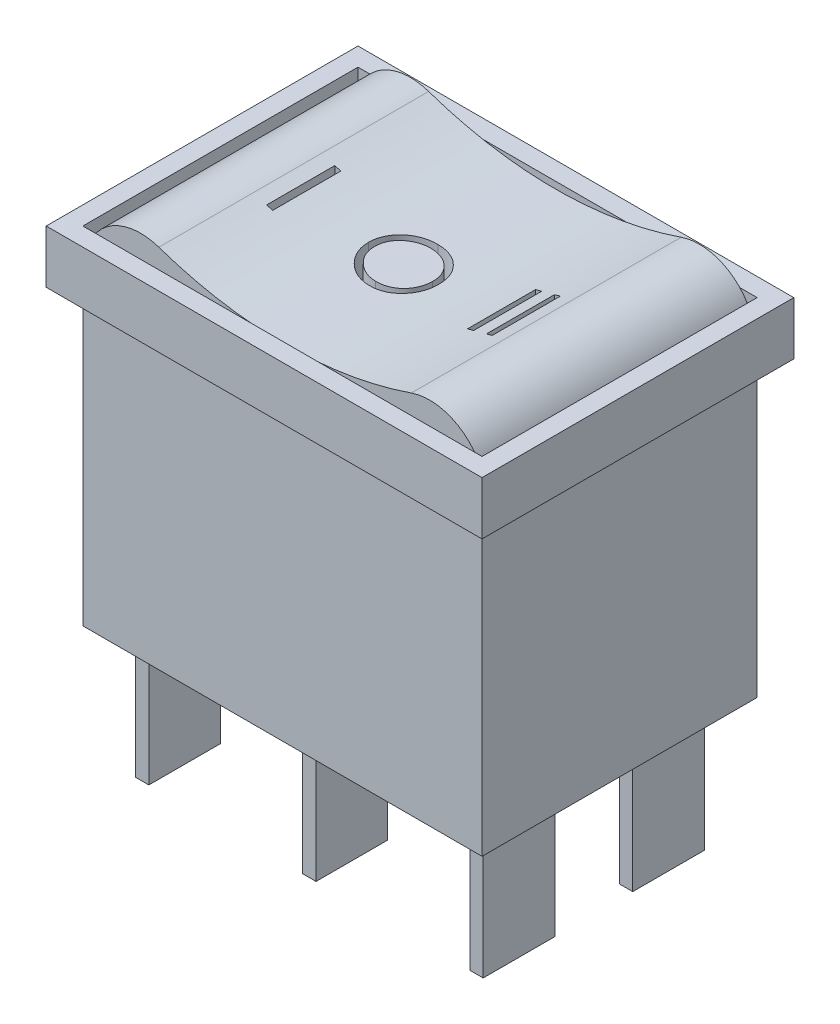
ISO-10303-21;
HEADER;
FILE_DESCRIPTION(('STEP AP214'),'2;1');
FILE_NAME('part.step','',(''),(''),'','','');
FILE_SCHEMA(('AUTOMOTIVE_DESIGN { 1 0 10303 214 1 1 1 1 }'));
ENDSEC;
DATA;
#1=APPLICATION_CONTEXT('core data for automotive mechanical design processes');
#2=APPLICATION_PROTOCOL_DEFINITION('international standard','automotive_design',2000,#1);
#3=PRODUCT_CONTEXT('',#1,'mechanical');
#4=PRODUCT('Part','Part','',(#3));
#5=PRODUCT_RELATED_PRODUCT_CATEGORY('part','',(#4));
#6=PRODUCT_DEFINITION_FORMATION('','',#4);
#7=PRODUCT_DEFINITION_CONTEXT('part definition',#1,'design');
#8=PRODUCT_DEFINITION('design','',#6,#7);
#9=PRODUCT_DEFINITION_SHAPE('','',#8);
#10=(LENGTH_UNIT() NAMED_UNIT(*) SI_UNIT(.MILLI.,.METRE.));
#11=(NAMED_UNIT(*) PLANE_ANGLE_UNIT() SI_UNIT($,.RADIAN.));
#12=(NAMED_UNIT(*) SI_UNIT($,.STERADIAN.) SOLID_ANGLE_UNIT());
#13=UNCERTAINTY_MEASURE_WITH_UNIT(LENGTH_MEASURE(1.E-05),#10,'distance_accuracy_value','');
#14=(GEOMETRIC_REPRESENTATION_CONTEXT(3) GLOBAL_UNCERTAINTY_ASSIGNED_CONTEXT((#13)) GLOBAL_UNIT_ASSIGNED_CONTEXT((#10,
#11,#12)) REPRESENTATION_CONTEXT('',''));
#15=CARTESIAN_POINT('',(0.,0.,0.));
#16=DIRECTION('',(0.,0.,1.));
#17=DIRECTION('',(1.,0.,0.));
#18=AXIS2_PLACEMENT_3D('',#15,#16,#17);
#19=CARTESIAN_POINT('',(0.,34.88759874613,25.7961901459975));
#20=DIRECTION('',(0.,0.,-1.));
#21=DIRECTION('',(-1.,0.,0.));
#22=AXIS2_PLACEMENT_3D('',#19,#20,#21);
#23=CYLINDRICAL_SURFACE('',#22,18.5269747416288);
#24=DIRECTION('',(0.,0.,-1.));
#25=VECTOR('',#24,1.);
#26=CARTESIAN_POINT('',(5.08814102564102,17.073008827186,25.7961901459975));
#27=LINE('',#26,#25);
#28=CARTESIAN_POINT('',(5.08814102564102,17.073008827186,-1.34021850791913));
#29=VERTEX_POINT('',#28);
#30=CARTESIAN_POINT('',(5.08814102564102,17.073008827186,1.91619174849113));
#31=VERTEX_POINT('',#30);
#32=EDGE_CURVE('E13',#29,#31,#27,.F.);
#33=ORIENTED_EDGE('',*,*,#32,.F.);
#34=CARTESIAN_POINT('',(0.,34.88759874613,-1.34021850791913));
#35=DIRECTION('',(0.,0.,-1.));
#36=DIRECTION('',(-1.,0.,0.));
#37=AXIS2_PLACEMENT_3D('',#34,#35,#36);
#38=CIRCLE('',#37,18.5269747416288);
#39=CARTESIAN_POINT('',(5.37307692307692,17.1568673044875,-1.34021850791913));
#40=VERTEX_POINT('',#39);
#41=EDGE_CURVE('E418',#40,#29,#38,.T.);
#42=ORIENTED_EDGE('',*,*,#41,.F.);
#43=DIRECTION('',(0.,0.,-1.));
#44=VECTOR('',#43,1.);
#45=CARTESIAN_POINT('',(5.37307692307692,17.1568673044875,25.7961901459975));
#46=LINE('',#45,#44);
#47=CARTESIAN_POINT('',(5.37307692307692,17.1568673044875,1.91619174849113));
#48=VERTEX_POINT('',#47);
#49=EDGE_CURVE('E1764',#48,#40,#46,.T.);
#50=ORIENTED_EDGE('',*,*,#49,.F.);
#51=CARTESIAN_POINT('',(0.,34.88759874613,1.91619174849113));
#52=DIRECTION('',(0.,0.,1.));
#53=DIRECTION('',(1.,0.,0.));
#54=AXIS2_PLACEMENT_3D('',#51,#52,#53);
#55=CIRCLE('',#54,18.5269747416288);
#56=EDGE_CURVE('E47',#31,#48,#55,.T.);
#57=ORIENTED_EDGE('',*,*,#56,.F.);
#58=EDGE_LOOP('',(#33,#42,#50,#57));
#59=FACE_BOUND('',#58,.T.);
#60=DIRECTION('',(0.,0.,-1.));
#61=VECTOR('',#60,1.);
#62=CARTESIAN_POINT('',(4.1926282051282,16.8412511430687,25.7961901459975));
#63=LINE('',#62,#61);
#64=CARTESIAN_POINT('',(4.1926282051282,16.8412511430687,-1.34021850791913));
#65=VERTEX_POINT('',#64);
#66=CARTESIAN_POINT('',(4.1926282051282,16.8412511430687,1.91619174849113));
#67=VERTEX_POINT('',#66);
#68=EDGE_CURVE('E1182',#65,#67,#63,.F.);
#69=ORIENTED_EDGE('',*,*,#68,.F.);
#70=CARTESIAN_POINT('',(0.,34.88759874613,-1.34021850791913));
#71=DIRECTION('',(0.,0.,-1.));
#72=DIRECTION('',(-1.,0.,0.));
#73=AXIS2_PLACEMENT_3D('',#70,#71,#72);
#74=CIRCLE('',#73,18.5269747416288);
#75=CARTESIAN_POINT('',(4.4775641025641,16.9098287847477,-1.34021850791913));
#76=VERTEX_POINT('',#75);
#77=EDGE_CURVE('E1772',#76,#65,#74,.T.);
#78=ORIENTED_EDGE('',*,*,#77,.F.);
#79=DIRECTION('',(0.,0.,-1.));
#80=VECTOR('',#79,1.);
#81=CARTESIAN_POINT('',(4.4775641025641,16.9098287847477,25.7961901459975));
#82=LINE('',#81,#80);
#83=CARTESIAN_POINT('',(4.4775641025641,16.9098287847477,1.91619174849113));
#84=VERTEX_POINT('',#83);
#85=EDGE_CURVE('E1771',#84,#76,#82,.T.);
#86=ORIENTED_EDGE('',*,*,#85,.F.);
#87=CARTESIAN_POINT('',(0.,34.88759874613,1.91619174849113));
#88=DIRECTION('',(0.,0.,1.));
#89=DIRECTION('',(1.,0.,0.));
#90=AXIS2_PLACEMENT_3D('',#87,#88,#89);
#91=CIRCLE('',#90,18.5269747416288);
#92=EDGE_CURVE('E1767',#67,#84,#91,.T.);
#93=ORIENTED_EDGE('',*,*,#92,.F.);
#94=EDGE_LOOP('',(#69,#78,#86,#93));
#95=FACE_BOUND('',#94,.T.);
#96=CARTESIAN_POINT('',(-0.468108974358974,16.3665386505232,-1.34021850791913));
#97=CARTESIAN_POINT('',(-0.479903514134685,16.3668367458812,-1.34006393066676));
#98=CARTESIAN_POINT('',(-0.491698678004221,16.3671461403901,-1.33990855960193));
#99=CARTESIAN_POINT('',(-0.515290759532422,16.3677875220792,-1.33948270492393));
#100=CARTESIAN_POINT('',(-0.527087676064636,16.3681195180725,-1.33921217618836));
#101=CARTESIAN_POINT('',(-0.550670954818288,16.3688057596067,-1.33844254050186));
#102=CARTESIAN_POINT('',(-0.562457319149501,16.3691599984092,-1.33794350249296));
#103=CARTESIAN_POINT('',(-0.58600729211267,16.3698902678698,-1.33659300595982));
#104=CARTESIAN_POINT('',(-0.597770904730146,16.3702662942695,-1.33574161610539));
#105=CARTESIAN_POINT('',(-0.63302656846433,16.371426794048,-1.33271808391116));
#106=CARTESIAN_POINT('',(-0.656476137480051,16.3722434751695,-1.33007681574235));
#107=CARTESIAN_POINT('',(-0.703275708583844,16.373962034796,-1.32404607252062));
#108=CARTESIAN_POINT('',(-0.726625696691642,16.3748639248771,-1.32065649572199));
#109=CARTESIAN_POINT('',(-0.773158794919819,16.3767489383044,-1.31287056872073));
#110=CARTESIAN_POINT('',(-0.796341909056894,16.3777320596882,-1.30847424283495));
#111=CARTESIAN_POINT('',(-0.84245479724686,16.379773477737,-1.29854463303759));
#112=CARTESIAN_POINT('',(-0.865384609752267,16.3808317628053,-1.29301152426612));
#113=CARTESIAN_POINT('',(-0.910985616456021,16.3830204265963,-1.28099717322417));
#114=CARTESIAN_POINT('',(-0.93365685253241,16.3841507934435,-1.27451608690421));
#115=CARTESIAN_POINT('',(-0.978685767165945,16.3864778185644,-1.26054193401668));
#116=CARTESIAN_POINT('',(-1.00104341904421,16.3876744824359,-1.25304878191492));
#117=CARTESIAN_POINT('',(-1.0454445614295,16.3901304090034,-1.237034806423));
#118=CARTESIAN_POINT('',(-1.06748714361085,16.391389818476,-1.22851149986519));
#119=CARTESIAN_POINT('',(-1.11121702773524,16.3939655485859,-1.21060829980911));
#120=CARTESIAN_POINT('',(-1.13290433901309,16.3952818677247,-1.20122842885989));
#121=CARTESIAN_POINT('',(-1.17584559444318,16.3979626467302,-1.18151302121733));
#122=CARTESIAN_POINT('',(-1.19709944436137,16.3993271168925,-1.17117727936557));
#123=CARTESIAN_POINT('',(-1.23909761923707,16.4020943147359,-1.14952923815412));
#124=CARTESIAN_POINT('',(-1.25984196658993,16.4034970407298,-1.13821698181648));
#125=CARTESIAN_POINT('',(-1.30088661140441,16.4063404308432,-1.11484578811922));
#126=CARTESIAN_POINT('',(-1.3211871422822,16.4077810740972,-1.102787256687));
#127=CARTESIAN_POINT('',(-1.36124999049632,16.4106889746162,-1.0778185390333));
#128=CARTESIAN_POINT('',(-1.38101249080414,16.4121562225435,-1.06490864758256));
#129=CARTESIAN_POINT('',(-1.41988772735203,16.4151031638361,-1.03814353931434));
#130=CARTESIAN_POINT('',(-1.43900039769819,16.4165828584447,-1.02428822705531));
#131=CARTESIAN_POINT('',(-1.47663198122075,16.4195531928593,-0.995795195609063));
#132=CARTESIAN_POINT('',(-1.49515086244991,16.4210438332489,-0.981157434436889));
#133=CARTESIAN_POINT('',(-1.5312068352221,16.4239988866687,-0.951356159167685));
#134=CARTESIAN_POINT('',(-1.54875558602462,16.4254632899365,-0.936206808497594));
#135=CARTESIAN_POINT('',(-1.58313861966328,16.4283797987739,-0.905114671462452));
#136=CARTESIAN_POINT('',(-1.59997280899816,16.4298319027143,-0.889171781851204));
#137=CARTESIAN_POINT('',(-1.6330473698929,16.4327288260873,-0.85668815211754));
#138=CARTESIAN_POINT('',(-1.64928782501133,16.4341736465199,-0.840147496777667));
#139=CARTESIAN_POINT('',(-1.68104725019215,16.4370397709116,-0.806386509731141));
#140=CARTESIAN_POINT('',(-1.69656642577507,16.4384610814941,-0.789166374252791));
#141=CARTESIAN_POINT('',(-1.72662989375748,16.441250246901,-0.753880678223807));
#142=CARTESIAN_POINT('',(-1.74117378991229,16.4426180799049,-0.735814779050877));
#143=CARTESIAN_POINT('',(-1.76957206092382,16.4453209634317,-0.699143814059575));
#144=CARTESIAN_POINT('',(-1.78342620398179,16.4466560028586,-0.680538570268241));
#145=CARTESIAN_POINT('',(-1.81047191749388,16.4492916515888,-0.64283639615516));
#146=CARTESIAN_POINT('',(-1.82366324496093,16.4505922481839,-0.623739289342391));
#147=CARTESIAN_POINT('',(-1.84916754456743,16.4531327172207,-0.584970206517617));
#148=CARTESIAN_POINT('',(-1.86148077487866,16.4543726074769,-0.565298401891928));
#149=CARTESIAN_POINT('',(-1.88511486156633,16.4567747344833,-0.52573567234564));
#150=CARTESIAN_POINT('',(-1.89644712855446,16.4579378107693,-0.505851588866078));
#151=CARTESIAN_POINT('',(-1.91834289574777,16.4602040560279,-0.465655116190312));
#152=CARTESIAN_POINT('',(-1.92890618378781,16.4613072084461,-0.445342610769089));
#153=CARTESIAN_POINT('',(-1.94931606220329,16.4634552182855,-0.404363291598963));
#154=CARTESIAN_POINT('',(-1.95916280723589,16.4645000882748,-0.383696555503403));
#155=CARTESIAN_POINT('',(-1.97800122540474,16.4665131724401,-0.341976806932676));
#156=CARTESIAN_POINT('',(-1.98699315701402,16.4674814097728,-0.320923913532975));
#157=CARTESIAN_POINT('',(-2.00392800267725,16.4693160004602,-0.278412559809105));
#158=CARTESIAN_POINT('',(-2.01187157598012,16.4701824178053,-0.256954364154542));
#159=CARTESIAN_POINT('',(-2.02696731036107,16.4718377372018,-0.213754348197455));
#160=CARTESIAN_POINT('',(-2.03411921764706,16.4726266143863,-0.192012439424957));
#161=CARTESIAN_POINT('',(-2.04764111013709,16.4741252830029,-0.148282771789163));
#162=CARTESIAN_POINT('',(-2.05401112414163,16.4748350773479,-0.126295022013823));
#163=CARTESIAN_POINT('',(-2.06577020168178,16.4761506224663,-0.08206140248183));
#164=CARTESIAN_POINT('',(-2.07115958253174,16.4767564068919,-0.0598156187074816));
#165=CARTESIAN_POINT('',(-2.07948866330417,16.4776956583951,-0.0218694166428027));
#166=CARTESIAN_POINT('',(-2.08267637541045,16.4780560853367,-0.0062234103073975));
#167=CARTESIAN_POINT('',(-2.08858859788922,16.4787258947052,0.0251590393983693));
#168=CARTESIAN_POINT('',(-2.0913130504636,16.4790352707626,0.0408954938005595));
#169=CARTESIAN_POINT('',(-2.09635067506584,16.4796082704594,0.0724303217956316));
#170=CARTESIAN_POINT('',(-2.09866394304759,16.4798719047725,0.0882286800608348));
#171=CARTESIAN_POINT('',(-2.10295451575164,16.4803615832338,0.119870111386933));
#172=CARTESIAN_POINT('',(-2.10493184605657,16.4805876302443,0.135713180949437));
#173=CARTESIAN_POINT('',(-2.10848503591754,16.4809943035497,0.167435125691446));
#174=CARTESIAN_POINT('',(-2.11006117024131,16.4811749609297,0.183313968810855));
#175=CARTESIAN_POINT('',(-2.11264864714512,16.4814717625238,0.215120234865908));
#176=CARTESIAN_POINT('',(-2.1136599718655,16.4815879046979,0.231047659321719));
#177=CARTESIAN_POINT('',(-2.11513156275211,16.48175695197,0.262924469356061));
#178=CARTESIAN_POINT('',(-2.11559186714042,16.481809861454,0.278873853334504));
#179=CARTESIAN_POINT('',(-2.11625200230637,16.4818857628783,0.310778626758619));
#180=CARTESIAN_POINT('',(-2.1164518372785,16.4819087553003,0.326734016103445));
#181=CARTESIAN_POINT('',(-2.11666666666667,16.4819334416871,0.342684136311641));
#182=B_SPLINE_CURVE_WITH_KNOTS('',3,(#96,#97,#98,#99,#100,#101,#102,#103,#104,#105,#106,#107,
#108,#109,#110,#111,#112,#113,#114,#115,#116,#117,#118,#119,#120,#121,#122,#123,#124,#125,#126,
#127,#128,#129,#130,#131,#132,#133,#134,#135,#136,#137,#138,#139,#140,#141,#142,#143,#144,#145,
#146,#147,#148,#149,#150,#151,#152,#153,#154,#155,#156,#157,#158,#159,#160,#161,#162,#163,#164,
#165,#166,#167,#168,#169,#170,#171,#172,#173,#174,#175,#176,#177,#178,#179,#180,#181),
.UNSPECIFIED.,.F.,.F.,(4,2,2,2,2,2,2,2,2,2,2,2,2,2,2,2,2,2,2,2,2,2,2,2,2,2,2,2,2,2,2,2,2,2,2,2,
2,2,2,2,2,2,4),(0.,0.0353994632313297,0.0708128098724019,0.106215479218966,0.141611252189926,
0.212424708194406,0.283247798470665,0.35406917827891,0.424879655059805,0.495678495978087,
0.566483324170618,0.637462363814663,0.708439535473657,0.779431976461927,0.850421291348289,
0.921372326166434,0.992298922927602,1.06323269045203,1.13417026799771,1.20383385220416,
1.27350652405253,1.3431693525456,1.41281220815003,1.48248318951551,1.55217742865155,
1.62189703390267,1.69159605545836,1.76032672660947,1.82907628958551,1.89781096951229,
1.96652479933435,2.03519521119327,2.10388757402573,2.17257740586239,2.24124497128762,
2.28915295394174,2.33706690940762,2.38496966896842,2.43286877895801,2.48073499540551,
2.52860272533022,2.57646713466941,2.624330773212),.UNSPECIFIED.);
#183=CARTESIAN_POINT('',(-0.468108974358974,16.3665386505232,-1.34021850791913));
#184=VERTEX_POINT('',#183);
#185=CARTESIAN_POINT('',(-2.11666666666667,16.4819334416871,0.342684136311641));
#186=VERTEX_POINT('',#185);
#187=EDGE_CURVE('E549',#184,#186,#182,.T.);
#188=ORIENTED_EDGE('',*,*,#187,.F.);
#189=CARTESIAN_POINT('',(1.22115384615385,16.4009122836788,0.327419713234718));
#190=CARTESIAN_POINT('',(1.22052657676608,16.4008709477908,0.302484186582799));
#191=CARTESIAN_POINT('',(1.21992586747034,16.4008312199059,0.277533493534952));
#192=CARTESIAN_POINT('',(1.21816632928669,16.4007151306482,0.227647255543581));
#193=CARTESIAN_POINT('',(1.21700734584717,16.4006387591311,0.202711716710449));
#194=CARTESIAN_POINT('',(1.21351720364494,16.4004093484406,0.152879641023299));
#195=CARTESIAN_POINT('',(1.21118437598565,16.400256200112,0.127983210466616));
#196=CARTESIAN_POINT('',(1.20529047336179,16.39987102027,0.0783422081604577));
#197=CARTESIAN_POINT('',(1.20172950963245,16.3996389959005,0.0535976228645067));
#198=CARTESIAN_POINT('',(1.1936205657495,16.3991136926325,0.00442434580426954));
#199=CARTESIAN_POINT('',(1.18907856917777,16.3988207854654,-0.0200053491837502));
#200=CARTESIAN_POINT('',(1.17900375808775,16.3981755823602,-0.0686616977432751));
#201=CARTESIAN_POINT('',(1.17347089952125,16.3978232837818,-0.0928883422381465));
#202=CARTESIAN_POINT('',(1.16125625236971,16.3970521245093,-0.141043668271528));
#203=CARTESIAN_POINT('',(1.15457483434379,16.3966332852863,-0.164972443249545));
#204=CARTESIAN_POINT('',(1.13999631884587,16.3957287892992,-0.21245347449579));
#205=CARTESIAN_POINT('',(1.13209929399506,16.3952431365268,-0.236005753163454));
#206=CARTESIAN_POINT('',(1.11507646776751,16.3942088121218,-0.282978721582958));
#207=CARTESIAN_POINT('',(1.10593712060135,16.3936594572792,-0.306394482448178));
#208=CARTESIAN_POINT('',(1.08656286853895,16.3925110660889,-0.352765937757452));
#209=CARTESIAN_POINT('',(1.07632786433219,16.3919120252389,-0.375721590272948));
#210=CARTESIAN_POINT('',(1.04399973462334,16.3900495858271,-0.443816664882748));
#211=CARTESIAN_POINT('',(1.02027743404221,16.3887204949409,-0.488200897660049));
#212=CARTESIAN_POINT('',(0.981536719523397,16.3866380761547,-0.552897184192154));
#213=CARTESIAN_POINT('',(0.96808413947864,16.3859284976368,-0.574166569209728));
#214=CARTESIAN_POINT('',(0.940129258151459,16.3844869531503,-0.616004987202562));
#215=CARTESIAN_POINT('',(0.925626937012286,16.3837549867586,-0.636574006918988));
#216=CARTESIAN_POINT('',(0.880689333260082,16.3815436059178,-0.697228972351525));
#217=CARTESIAN_POINT('',(0.848823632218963,16.3800487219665,-0.736262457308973));
#218=CARTESIAN_POINT('',(0.785731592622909,16.3772691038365,-0.807364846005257));
#219=CARTESIAN_POINT('',(0.754829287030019,16.3759795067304,-0.839725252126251));
#220=CARTESIAN_POINT('',(0.690854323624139,16.373481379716,-0.902222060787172));
#221=CARTESIAN_POINT('',(0.657782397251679,16.3722728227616,-0.932359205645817));
#222=CARTESIAN_POINT('',(0.589324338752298,16.3699677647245,-0.989792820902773));
#223=CARTESIAN_POINT('',(0.553941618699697,16.3688711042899,-1.01709333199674));
#224=CARTESIAN_POINT('',(0.481002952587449,16.36683311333,-1.06863595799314));
#225=CARTESIAN_POINT('',(0.443446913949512,16.3658917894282,-1.09287794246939));
#226=CARTESIAN_POINT('',(0.384152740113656,16.3645953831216,-1.12776157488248));
#227=CARTESIAN_POINT('',(0.363073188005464,16.3641696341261,-1.13953536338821));
#228=CARTESIAN_POINT('',(0.320414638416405,16.3633826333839,-1.16214581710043));
#229=CARTESIAN_POINT('',(0.298835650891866,16.3630213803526,-1.17298250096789));
#230=CARTESIAN_POINT('',(0.255181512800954,16.362368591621,-1.19363021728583));
#231=CARTESIAN_POINT('',(0.233106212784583,16.3620770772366,-1.2034409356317));
#232=CARTESIAN_POINT('',(0.18847720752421,16.36156930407,-1.22190531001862));
#233=CARTESIAN_POINT('',(0.165923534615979,16.3613530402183,-1.23055904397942));
#234=CARTESIAN_POINT('',(0.120405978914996,16.3610012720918,-1.24678238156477));
#235=CARTESIAN_POINT('',(0.0974416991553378,16.3608658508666,-1.25435086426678));
#236=CARTESIAN_POINT('',(0.0512256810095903,16.3606804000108,-1.2685626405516));
#237=CARTESIAN_POINT('',(0.0279738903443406,16.360630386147,-1.27520576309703));
#238=CARTESIAN_POINT('',(-0.0187600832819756,16.3606187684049,-1.28759412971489));
#239=CARTESIAN_POINT('',(-0.042242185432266,16.3606571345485,-1.29333967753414));
#240=CARTESIAN_POINT('',(-0.0894246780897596,16.3608248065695,-1.3038263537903));
#241=CARTESIAN_POINT('',(-0.113125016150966,16.3609540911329,-1.30856771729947));
#242=CARTESIAN_POINT('',(-0.164286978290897,16.3613322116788,-1.31762016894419));
#243=CARTESIAN_POINT('',(-0.191779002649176,16.3615960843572,-1.32175973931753));
#244=CARTESIAN_POINT('',(-0.246936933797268,16.3622491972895,-1.32861922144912));
#245=CARTESIAN_POINT('',(-0.274602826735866,16.3626384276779,-1.33133924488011));
#246=CARTESIAN_POINT('',(-0.329903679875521,16.3635409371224,-1.33540837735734));
#247=CARTESIAN_POINT('',(-0.357538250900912,16.3640536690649,-1.33676339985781));
#248=CARTESIAN_POINT('',(-0.41282480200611,16.3652032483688,-1.33881329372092));
#249=CARTESIAN_POINT('',(-0.440476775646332,16.3658400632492,-1.3395083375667));
#250=CARTESIAN_POINT('',(-0.468108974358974,16.3665386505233,-1.34021850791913));
#251=B_SPLINE_CURVE_WITH_KNOTS('',3,(#189,#190,#191,#192,#193,#194,#195,#196,#197,#198,#199,
#200,#201,#202,#203,#204,#205,#206,#207,#208,#209,#210,#211,#212,#213,#214,#215,#216,#217,#218,
#219,#220,#221,#222,#223,#224,#225,#226,#227,#228,#229,#230,#231,#232,#233,#234,#235,#236,#237,
#238,#239,#240,#241,#242,#243,#244,#245,#246,#247,#248,#249,#250),.UNSPECIFIED.,.F.,.F.,(4,2,2,
2,2,2,2,2,2,2,2,2,2,2,2,2,2,2,2,2,2,2,2,2,2,2,2,2,2,2,4),(0.,0.0748556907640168,
0.149732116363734,0.22471529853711,0.299691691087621,0.374223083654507,0.448757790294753,
0.52326849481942,0.597774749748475,0.673170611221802,0.748573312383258,0.899325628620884,
0.97483042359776,1.05033664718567,1.20135037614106,1.33554571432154,1.46969604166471,
1.60365257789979,1.73761482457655,1.81004063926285,1.88246501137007,1.95491149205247,
2.0273530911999,2.09986898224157,2.17239825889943,2.24490293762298,2.31739062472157,
2.40076303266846,2.4841288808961,2.56713199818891,2.65011341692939),.UNSPECIFIED.);
#252=CARTESIAN_POINT('',(1.22115384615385,16.4009122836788,0.327419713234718));
#253=VERTEX_POINT('',#252);
#254=EDGE_CURVE('E497',#253,#184,#251,.T.);
#255=ORIENTED_EDGE('',*,*,#254,.F.);
#256=CARTESIAN_POINT('',(-0.442668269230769,16.3659131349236,1.99760200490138));
#257=CARTESIAN_POINT('',(-0.418004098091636,16.3653235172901,1.99698259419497));
#258=CARTESIAN_POINT('',(-0.393323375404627,16.3647830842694,1.99639059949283));
#259=CARTESIAN_POINT('',(-0.343977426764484,16.3638010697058,1.99464723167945));
#260=CARTESIAN_POINT('',(-0.319312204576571,16.3633595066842,1.99349575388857));
#261=CARTESIAN_POINT('',(-0.270021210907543,16.3625753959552,1.99001658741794));
#262=CARTESIAN_POINT('',(-0.245395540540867,16.36223298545,1.98768728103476));
#263=CARTESIAN_POINT('',(-0.196294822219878,16.3616476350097,1.98179845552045));
#264=CARTESIAN_POINT('',(-0.171819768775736,16.3614046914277,1.97823898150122));
#265=CARTESIAN_POINT('',(-0.12320033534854,16.3610177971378,1.97015282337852));
#266=CARTESIAN_POINT('',(-0.0990548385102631,16.3608731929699,1.96563279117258));
#267=CARTESIAN_POINT('',(-0.05096450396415,16.3606785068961,1.95562159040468));
#268=CARTESIAN_POINT('',(-0.0270196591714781,16.3606284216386,1.95013045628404));
#269=CARTESIAN_POINT('',(0.0205693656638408,16.3606201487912,1.9379921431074));
#270=CARTESIAN_POINT('',(0.0442136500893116,16.3606619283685,1.93134537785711));
#271=CARTESIAN_POINT('',(0.0911221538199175,16.3608332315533,1.9168235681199));
#272=CARTESIAN_POINT('',(0.114386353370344,16.3609627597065,1.90894846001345));
#273=CARTESIAN_POINT('',(0.160773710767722,16.3613069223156,1.89203763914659));
#274=CARTESIAN_POINT('',(0.183892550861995,16.361522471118,1.88299018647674));
#275=CARTESIAN_POINT('',(0.229718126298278,16.3620340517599,1.86390736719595));
#276=CARTESIAN_POINT('',(0.252424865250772,16.362330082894,1.85387200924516));
#277=CARTESIAN_POINT('',(0.297330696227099,16.3629964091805,1.83270500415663));
#278=CARTESIAN_POINT('',(0.319529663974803,16.3633667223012,1.82157309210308));
#279=CARTESIAN_POINT('',(0.363289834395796,16.364173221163,1.79812463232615));
#280=CARTESIAN_POINT('',(0.384851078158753,16.3646094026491,1.78580816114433));
#281=CARTESIAN_POINT('',(0.427374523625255,16.3655417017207,1.7601233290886));
#282=CARTESIAN_POINT('',(0.448335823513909,16.3660379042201,1.74675348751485));
#283=CARTESIAN_POINT('',(0.489677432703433,16.3670848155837,1.71914221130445));
#284=CARTESIAN_POINT('',(0.510057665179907,16.3676355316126,1.70490066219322));
#285=CARTESIAN_POINT('',(0.550195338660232,16.3687844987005,1.67556133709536));
#286=CARTESIAN_POINT('',(0.569952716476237,16.3693827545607,1.6604634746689));
#287=CARTESIAN_POINT('',(0.608757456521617,16.3706177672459,1.62938750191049));
#288=CARTESIAN_POINT('',(0.627804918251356,16.3712545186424,1.61340951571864));
#289=CARTESIAN_POINT('',(0.663398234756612,16.3724972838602,1.58218656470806));
#290=CARTESIAN_POINT('',(0.68000980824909,16.3731004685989,1.56701622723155));
#291=CARTESIAN_POINT('',(0.712664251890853,16.3743286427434,1.53607838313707));
#292=CARTESIAN_POINT('',(0.72870710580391,16.3749536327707,1.52031085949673));
#293=CARTESIAN_POINT('',(0.775999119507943,16.376855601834,1.47219004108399));
#294=CARTESIAN_POINT('',(0.806419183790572,16.378159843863,1.43901189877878));
#295=CARTESIAN_POINT('',(0.864600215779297,16.3807862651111,1.37047818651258));
#296=CARTESIAN_POINT('',(0.892364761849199,16.382108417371,1.33512565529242));
#297=CARTESIAN_POINT('',(0.944970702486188,16.3847201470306,1.26229936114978));
#298=CARTESIAN_POINT('',(0.969812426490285,16.3860097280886,1.22482583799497));
#299=CARTESIAN_POINT('',(1.00580306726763,16.3879415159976,1.16514883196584));
#300=CARTESIAN_POINT('',(1.01809789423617,16.3886147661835,1.14363108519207));
#301=CARTESIAN_POINT('',(1.04161288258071,16.3899239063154,1.10001850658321));
#302=CARTESIAN_POINT('',(1.05283325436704,16.3905598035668,1.07792378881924));
#303=CARTESIAN_POINT('',(1.07419497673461,16.3917880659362,1.03321064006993));
#304=CARTESIAN_POINT('',(1.0843360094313,16.3923804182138,1.01059205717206));
#305=CARTESIAN_POINT('',(1.10353487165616,16.3935160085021,0.964897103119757));
#306=CARTESIAN_POINT('',(1.11259263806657,16.3940592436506,0.941820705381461));
#307=CARTESIAN_POINT('',(1.12960543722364,16.3950906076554,0.895244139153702));
#308=CARTESIAN_POINT('',(1.1375596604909,16.3955786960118,0.871743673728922));
#309=CARTESIAN_POINT('',(1.15230852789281,16.3964918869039,0.824381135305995));
#310=CARTESIAN_POINT('',(1.15910320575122,16.3969169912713,0.800519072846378));
#311=CARTESIAN_POINT('',(1.17156812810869,16.3977025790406,0.752512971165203));
#312=CARTESIAN_POINT('',(1.17723877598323,16.3980630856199,0.728369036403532));
#313=CARTESIAN_POINT('',(1.1875782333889,16.3987243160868,0.679868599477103));
#314=CARTESIAN_POINT('',(1.19224705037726,16.3990250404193,0.655512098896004));
#315=CARTESIAN_POINT('',(1.20069851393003,16.3995719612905,0.605963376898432));
#316=CARTESIAN_POINT('',(1.20445370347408,16.3998164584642,0.580766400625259));
#317=CARTESIAN_POINT('',(1.2106865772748,16.4002235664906,0.530216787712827));
#318=CARTESIAN_POINT('',(1.21316458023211,16.4003861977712,0.504864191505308));
#319=CARTESIAN_POINT('',(1.21685226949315,16.4006285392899,0.454172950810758));
#320=CARTESIAN_POINT('',(1.21806680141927,16.4007085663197,0.428834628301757));
#321=CARTESIAN_POINT('',(1.21989668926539,16.4008292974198,0.378131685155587));
#322=CARTESIAN_POINT('',(1.22051199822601,16.4008699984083,0.352767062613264));
#323=CARTESIAN_POINT('',(1.22115384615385,16.4009122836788,0.327419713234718));
#324=B_SPLINE_CURVE_WITH_KNOTS('',3,(#256,#257,#258,#259,#260,#261,#262,#263,#264,#265,#266,
#267,#268,#269,#270,#271,#272,#273,#274,#275,#276,#277,#278,#279,#280,#281,#282,#283,#284,#285,
#286,#287,#288,#289,#290,#291,#292,#293,#294,#295,#296,#297,#298,#299,#300,#301,#302,#303,#304,
#305,#306,#307,#308,#309,#310,#311,#312,#313,#314,#315,#316,#317,#318,#319,#320,#321,#322,#323),
.UNSPECIFIED.,.F.,.F.,(4,2,2,2,2,2,2,2,2,2,2,2,2,2,2,2,2,2,2,2,2,2,2,2,2,2,2,2,2,2,2,2,2,4),(0.,
0.0740626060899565,0.148139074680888,0.222317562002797,0.296493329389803,0.370171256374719,
0.443846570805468,0.517495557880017,0.591148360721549,0.665605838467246,0.74006266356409,
0.814537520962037,0.889007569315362,0.963584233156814,1.03817071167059,1.11276473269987,
1.18734825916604,1.25484430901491,1.32234228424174,1.45730842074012,1.59209004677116,
1.7268564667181,1.80120612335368,1.87554119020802,1.94989808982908,2.02425931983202,
2.09867481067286,2.17308813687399,2.24747471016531,2.32186072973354,2.39826345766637,
2.47464711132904,2.55073672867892,2.62683230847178),.UNSPECIFIED.);
#325=CARTESIAN_POINT('',(-0.442668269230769,16.3659131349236,1.99760200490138));
#326=VERTEX_POINT('',#325);
#327=EDGE_CURVE('E539',#326,#253,#324,.T.);
#328=ORIENTED_EDGE('',*,*,#327,.F.);
#329=CARTESIAN_POINT('',(-2.11666666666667,16.4819334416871,0.342684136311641));
#330=CARTESIAN_POINT('',(-2.11604539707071,16.481862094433,0.366966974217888));
#331=CARTESIAN_POINT('',(-2.11545157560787,16.4817937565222,0.391265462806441));
#332=CARTESIAN_POINT('',(-2.11370827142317,16.4815934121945,0.439844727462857));
#333=CARTESIAN_POINT('',(-2.11255867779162,16.4814613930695,0.464125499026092));
#334=CARTESIAN_POINT('',(-2.10909041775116,16.4810636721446,0.512647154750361));
#335=CARTESIAN_POINT('',(-2.10676999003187,16.4807977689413,0.536887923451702));
#336=CARTESIAN_POINT('',(-2.1009105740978,16.4801280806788,0.585214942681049));
#337=CARTESIAN_POINT('',(-2.09737165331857,16.4797243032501,0.60930120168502));
#338=CARTESIAN_POINT('',(-2.08934458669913,16.4788114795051,0.657141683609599));
#339=CARTESIAN_POINT('',(-2.08486307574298,16.4783031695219,0.680897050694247));
#340=CARTESIAN_POINT('',(-2.07495448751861,16.4771837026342,0.728209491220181));
#341=CARTESIAN_POINT('',(-2.06952739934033,16.476572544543,0.751766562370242));
#342=CARTESIAN_POINT('',(-2.05755104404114,16.4752302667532,0.798581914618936));
#343=CARTESIAN_POINT('',(-2.0510022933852,16.4744992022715,0.821840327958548));
#344=CARTESIAN_POINT('',(-2.03670288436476,16.4729120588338,0.867979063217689));
#345=CARTESIAN_POINT('',(-2.02895226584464,16.4720559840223,0.890859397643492));
#346=CARTESIAN_POINT('',(-2.01229852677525,16.4702287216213,0.936437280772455));
#347=CARTESIAN_POINT('',(-2.00338513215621,16.4692565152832,0.959131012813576));
#348=CARTESIAN_POINT('',(-1.98455747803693,16.4672183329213,1.00409680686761));
#349=CARTESIAN_POINT('',(-1.97464314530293,16.4661523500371,1.02636883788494));
#350=CARTESIAN_POINT('',(-1.95380140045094,16.4639301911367,1.07043957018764));
#351=CARTESIAN_POINT('',(-1.94287363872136,16.4627739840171,1.09223810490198));
#352=CARTESIAN_POINT('',(-1.92000023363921,16.4603763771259,1.13528753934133));
#353=CARTESIAN_POINT('',(-1.90805466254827,16.4591349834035,1.15653847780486));
#354=CARTESIAN_POINT('',(-1.88317466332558,16.4565759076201,1.19850067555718));
#355=CARTESIAN_POINT('',(-1.870238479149,16.4552580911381,1.21921088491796));
#356=CARTESIAN_POINT('',(-1.84346185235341,16.45256083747,1.26003310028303));
#357=CARTESIAN_POINT('',(-1.82962135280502,16.4511813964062,1.28014506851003));
#358=CARTESIAN_POINT('',(-1.78678256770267,16.446963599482,1.33951304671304));
#359=CARTESIAN_POINT('',(-1.75645607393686,16.4440446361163,1.37781951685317));
#360=CARTESIAN_POINT('',(-1.69503572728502,16.4383028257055,1.44878098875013));
#361=CARTESIAN_POINT('',(-1.6641787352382,16.4354897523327,1.48164412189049));
#362=CARTESIAN_POINT('',(-1.6002573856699,16.4298360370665,1.54514993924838));
#363=CARTESIAN_POINT('',(-1.56719275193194,16.4269953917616,1.5757923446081));
#364=CARTESIAN_POINT('',(-1.49890874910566,16.4213257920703,1.6344907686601));
#365=CARTESIAN_POINT('',(-1.46369245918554,16.418496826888,1.66255034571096));
#366=CARTESIAN_POINT('',(-1.39105968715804,16.4128843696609,1.71566247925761));
#367=CARTESIAN_POINT('',(-1.35364360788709,16.4101008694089,1.74071558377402));
#368=CARTESIAN_POINT('',(-1.27310742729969,16.4043692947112,1.78977057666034));
#369=CARTESIAN_POINT('',(-1.22978439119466,16.4014310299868,1.81344135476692));
#370=CARTESIAN_POINT('',(-1.14108771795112,16.3957441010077,1.85661755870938));
#371=CARTESIAN_POINT('',(-1.09571379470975,16.3929954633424,1.87612240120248));
#372=CARTESIAN_POINT('',(-1.0032174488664,16.3877475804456,1.91061462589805));
#373=CARTESIAN_POINT('',(-0.956093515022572,16.3852485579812,1.92559799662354));
#374=CARTESIAN_POINT('',(-0.860659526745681,16.3805638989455,1.95109060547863));
#375=CARTESIAN_POINT('',(-0.812349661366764,16.378378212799,1.9616005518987));
#376=CARTESIAN_POINT('',(-0.737194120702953,16.3752772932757,1.97494928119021));
#377=CARTESIAN_POINT('',(-0.710575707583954,16.3742362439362,1.97910328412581));
#378=CARTESIAN_POINT('',(-0.657156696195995,16.37226318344,1.98604295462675));
#379=CARTESIAN_POINT('',(-0.630356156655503,16.371331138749,1.98882904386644));
#380=CARTESIAN_POINT('',(-0.57675586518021,16.3695842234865,1.99295168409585));
#381=CARTESIAN_POINT('',(-0.549956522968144,16.3687689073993,1.99429388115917));
#382=CARTESIAN_POINT('',(-0.49632098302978,16.3672537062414,1.99628442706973));
#383=CARTESIAN_POINT('',(-0.469484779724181,16.3665538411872,1.99693265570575));
#384=CARTESIAN_POINT('',(-0.442668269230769,16.3659131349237,1.99760200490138));
#385=B_SPLINE_CURVE_WITH_KNOTS('',3,(#329,#330,#331,#332,#333,#334,#335,#336,#337,#338,#339,
#340,#341,#342,#343,#344,#345,#346,#347,#348,#349,#350,#351,#352,#353,#354,#355,#356,#357,#358,
#359,#360,#361,#362,#363,#364,#365,#366,#367,#368,#369,#370,#371,#372,#373,#374,#375,#376,#377,
#378,#379,#380,#381,#382,#383,#384),.UNSPECIFIED.,.F.,.F.,(4,2,2,2,2,2,2,2,2,2,2,2,2,2,2,2,2,2,
2,2,2,2,2,2,2,2,2,4),(0.,0.0728987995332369,0.145812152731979,0.218835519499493,
0.291854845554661,0.364376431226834,0.436898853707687,0.509387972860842,0.581874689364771,
0.655051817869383,0.728234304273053,0.801442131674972,0.874644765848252,0.947980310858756,
1.02132047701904,1.16793678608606,1.30331853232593,1.43871724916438,1.57392654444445,
1.70911115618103,1.85725743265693,2.00542444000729,2.15372251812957,2.30199710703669,
2.38285873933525,2.46369542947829,2.54421486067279,2.62474823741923),.UNSPECIFIED.);
#386=EDGE_CURVE('E545',#186,#326,#385,.T.);
#387=ORIENTED_EDGE('',*,*,#386,.F.);
#388=EDGE_LOOP('',(#188,#255,#328,#387));
#389=FACE_BOUND('',#388,.T.);
#390=DIRECTION('',(0.,0.,-1.));
#391=VECTOR('',#390,1.);
#392=CARTESIAN_POINT('',(-6.03772719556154,17.3720444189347,25.7961901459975));
#393=LINE('',#392,#391);
#394=CARTESIAN_POINT('',(-6.03772719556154,17.3720444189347,6.4516));
#395=VERTEX_POINT('',#394);
#396=CARTESIAN_POINT('',(-6.03772719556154,17.3720444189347,-6.4516));
#397=VERTEX_POINT('',#396);
#398=EDGE_CURVE('E872',#395,#397,#393,.T.);
#399=ORIENTED_EDGE('',*,*,#398,.F.);
#400=CARTESIAN_POINT('',(0.,34.88759874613,6.4516));
#401=DIRECTION('',(0.,0.,1.));
#402=DIRECTION('',(1.,0.,0.));
#403=AXIS2_PLACEMENT_3D('',#400,#401,#402);
#404=CIRCLE('',#403,18.5269747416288);
#405=CARTESIAN_POINT('',(6.03772719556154,17.3720444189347,6.4516));
#406=VERTEX_POINT('',#405);
#407=EDGE_CURVE('E868',#395,#406,#404,.T.);
#408=ORIENTED_EDGE('',*,*,#407,.T.);
#409=DIRECTION('',(0.,0.,-1.));
#410=VECTOR('',#409,1.);
#411=CARTESIAN_POINT('',(6.03772719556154,17.3720444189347,25.7961901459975));
#412=LINE('',#411,#410);
#413=CARTESIAN_POINT('',(6.03772719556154,17.3720444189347,-6.4516));
#414=VERTEX_POINT('',#413);
#415=EDGE_CURVE('E871',#406,#414,#412,.T.);
#416=ORIENTED_EDGE('',*,*,#415,.T.);
#417=CARTESIAN_POINT('',(0.,34.88759874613,-6.4516));
#418=DIRECTION('',(0.,0.,-1.));
#419=DIRECTION('',(-1.,0.,0.));
#420=AXIS2_PLACEMENT_3D('',#417,#418,#419);
#421=CIRCLE('',#420,18.5269747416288);
#422=EDGE_CURVE('E859',#397,#414,#421,.F.);
#423=ORIENTED_EDGE('',*,*,#422,.F.);
#424=EDGE_LOOP('',(#399,#408,#416,#423));
#425=FACE_BOUND('',#424,.T.);
#426=DIRECTION('',(0.,0.,-1.));
#427=VECTOR('',#426,1.);
#428=CARTESIAN_POINT('',(-5.41378205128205,17.1692535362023,25.7961901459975));
#429=LINE('',#428,#427);
#430=CARTESIAN_POINT('',(-5.41378205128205,17.1692535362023,-1.34021850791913));
#431=VERTEX_POINT('',#430);
#432=CARTESIAN_POINT('',(-5.41378205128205,17.1692535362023,1.91619174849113));
#433=VERTEX_POINT('',#432);
#434=EDGE_CURVE('E988',#431,#433,#429,.F.);
#435=ORIENTED_EDGE('',*,*,#434,.F.);
#436=CARTESIAN_POINT('',(0.,34.88759874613,-1.34021850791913));
#437=DIRECTION('',(0.,0.,-1.));
#438=DIRECTION('',(-1.,0.,0.));
#439=AXIS2_PLACEMENT_3D('',#436,#437,#438);
#440=CIRCLE('',#439,18.5269747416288);
#441=CARTESIAN_POINT('',(-5.12884615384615,17.0846852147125,-1.34021850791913));
#442=VERTEX_POINT('',#441);
#443=EDGE_CURVE('E982',#442,#431,#440,.T.);
#444=ORIENTED_EDGE('',*,*,#443,.F.);
#445=DIRECTION('',(0.,0.,-1.));
#446=VECTOR('',#445,1.);
#447=CARTESIAN_POINT('',(-5.12884615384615,17.0846852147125,25.7961901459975));
#448=LINE('',#447,#446);
#449=CARTESIAN_POINT('',(-5.12884615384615,17.0846852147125,1.91619174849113));
#450=VERTEX_POINT('',#449);
#451=EDGE_CURVE('E984',#450,#442,#448,.T.);
#452=ORIENTED_EDGE('',*,*,#451,.F.);
#453=CARTESIAN_POINT('',(0.,34.88759874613,1.91619174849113));
#454=DIRECTION('',(0.,0.,1.));
#455=DIRECTION('',(1.,0.,0.));
#456=AXIS2_PLACEMENT_3D('',#453,#454,#455);
#457=CIRCLE('',#456,18.5269747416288);
#458=EDGE_CURVE('E987',#433,#450,#457,.T.);
#459=ORIENTED_EDGE('',*,*,#458,.F.);
#460=EDGE_LOOP('',(#435,#444,#452,#459));
#461=FACE_BOUND('',#460,.T.);
#462=ADVANCED_FACE('F39',(#59,#95,#389,#425,#461),#23,.F.);
#463=CARTESIAN_POINT('',(0.,0.,0.));
#464=DIRECTION('',(0.,1.,0.));
#465=DIRECTION('',(0.,0.,1.));
#466=AXIS2_PLACEMENT_3D('',#463,#464,#465);
#467=PLANE('',#466);
#468=DIRECTION('',(-1.,0.,0.));
#469=VECTOR('',#468,1.);
#470=CARTESIAN_POINT('',(0.317500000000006,0.,-1.8611423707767));
#471=LINE('',#470,#469);
#472=CARTESIAN_POINT('',(0.317500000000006,0.,-1.8611423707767));
#473=VERTEX_POINT('',#472);
#474=CARTESIAN_POINT('',(-0.317499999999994,0.,-1.8611423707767));
#475=VERTEX_POINT('',#474);
#476=EDGE_CURVE('E692',#473,#475,#471,.T.);
#477=ORIENTED_EDGE('',*,*,#476,.F.);
#478=DIRECTION('',(0.,0.,1.));
#479=VECTOR('',#478,1.);
#480=CARTESIAN_POINT('',(0.317500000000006,0.,-5.2901423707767));
#481=LINE('',#480,#479);
#482=CARTESIAN_POINT('',(0.317500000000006,0.,-5.2901423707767));
#483=VERTEX_POINT('',#482);
#484=EDGE_CURVE('E689',#483,#473,#481,.T.);
#485=ORIENTED_EDGE('',*,*,#484,.F.);
#486=DIRECTION('',(1.,0.,0.));
#487=VECTOR('',#486,1.);
#488=CARTESIAN_POINT('',(0.317500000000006,0.,-5.2901423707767));
#489=LINE('',#488,#487);
#490=CARTESIAN_POINT('',(-0.317499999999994,0.,-5.2901423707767));
#491=VERTEX_POINT('',#490);
#492=EDGE_CURVE('E686',#491,#483,#489,.T.);
#493=ORIENTED_EDGE('',*,*,#492,.F.);
#494=DIRECTION('',(0.,0.,-1.));
#495=VECTOR('',#494,1.);
#496=CARTESIAN_POINT('',(-0.317499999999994,0.,-5.2901423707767));
#497=LINE('',#496,#495);
#498=EDGE_CURVE('E647',#475,#491,#497,.T.);
#499=ORIENTED_EDGE('',*,*,#498,.F.);
#500=EDGE_LOOP('',(#477,#485,#493,#499));
#501=FACE_BOUND('',#500,.T.);
#502=DIRECTION('',(1.,0.,0.));
#503=VECTOR('',#502,1.);
#504=CARTESIAN_POINT('',(7.67653480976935,0.,1.86114237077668));
#505=LINE('',#504,#503);
#506=CARTESIAN_POINT('',(7.67653480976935,0.,1.86114237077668));
#507=VERTEX_POINT('',#506);
#508=CARTESIAN_POINT('',(8.31153480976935,0.,1.86114237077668));
#509=VERTEX_POINT('',#508);
#510=EDGE_CURVE('E764',#507,#509,#505,.T.);
#511=ORIENTED_EDGE('',*,*,#510,.F.);
#512=DIRECTION('',(0.,0.,-1.));
#513=VECTOR('',#512,1.);
#514=CARTESIAN_POINT('',(7.67653480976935,0.,1.86114237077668));
#515=LINE('',#514,#513);
#516=CARTESIAN_POINT('',(7.67653480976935,0.,5.29014237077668));
#517=VERTEX_POINT('',#516);
#518=EDGE_CURVE('E761',#517,#507,#515,.T.);
#519=ORIENTED_EDGE('',*,*,#518,.F.);
#520=DIRECTION('',(-1.,0.,0.));
#521=VECTOR('',#520,1.);
#522=CARTESIAN_POINT('',(7.67653480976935,0.,5.29014237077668));
#523=LINE('',#522,#521);
#524=CARTESIAN_POINT('',(8.31153480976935,0.,5.29014237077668));
#525=VERTEX_POINT('',#524);
#526=EDGE_CURVE('E758',#525,#517,#523,.T.);
#527=ORIENTED_EDGE('',*,*,#526,.F.);
#528=DIRECTION('',(0.,0.,1.));
#529=VECTOR('',#528,1.);
#530=CARTESIAN_POINT('',(8.31153480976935,0.,1.86114237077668));
#531=LINE('',#530,#529);
#532=EDGE_CURVE('E719',#509,#525,#531,.T.);
#533=ORIENTED_EDGE('',*,*,#532,.F.);
#534=EDGE_LOOP('',(#511,#519,#527,#533));
#535=FACE_BOUND('',#534,.T.);
#536=DIRECTION('',(1.,0.,0.));
#537=VECTOR('',#536,1.);
#538=CARTESIAN_POINT('',(-8.31153480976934,0.,1.86114237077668));
#539=LINE('',#538,#537);
#540=CARTESIAN_POINT('',(-8.31153480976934,0.,1.86114237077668));
#541=VERTEX_POINT('',#540);
#542=CARTESIAN_POINT('',(-7.67653480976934,0.,1.86114237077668));
#543=VERTEX_POINT('',#542);
#544=EDGE_CURVE('E836',#541,#543,#539,.T.);
#545=ORIENTED_EDGE('',*,*,#544,.F.);
#546=DIRECTION('',(0.,0.,-1.));
#547=VECTOR('',#546,1.);
#548=CARTESIAN_POINT('',(-8.31153480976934,0.,1.86114237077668));
#549=LINE('',#548,#547);
#550=CARTESIAN_POINT('',(-8.31153480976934,0.,5.29014237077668));
#551=VERTEX_POINT('',#550);
#552=EDGE_CURVE('E833',#551,#541,#549,.T.);
#553=ORIENTED_EDGE('',*,*,#552,.F.);
#554=DIRECTION('',(-1.,0.,0.));
#555=VECTOR('',#554,1.);
#556=CARTESIAN_POINT('',(-8.31153480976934,0.,5.29014237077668));
#557=LINE('',#556,#555);
#558=CARTESIAN_POINT('',(-7.67653480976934,0.,5.29014237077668));
#559=VERTEX_POINT('',#558);
#560=EDGE_CURVE('E830',#559,#551,#557,.T.);
#561=ORIENTED_EDGE('',*,*,#560,.F.);
#562=DIRECTION('',(0.,0.,1.));
#563=VECTOR('',#562,1.);
#564=CARTESIAN_POINT('',(-7.67653480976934,0.,1.86114237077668));
#565=LINE('',#564,#563);
#566=EDGE_CURVE('E791',#543,#559,#565,.T.);
#567=ORIENTED_EDGE('',*,*,#566,.F.);
#568=EDGE_LOOP('',(#545,#553,#561,#567));
#569=FACE_BOUND('',#568,.T.);
#570=DIRECTION('',(0.,0.,1.));
#571=VECTOR('',#570,1.);
#572=CARTESIAN_POINT('',(-9.54405,0.,6.5786));
#573=LINE('',#572,#571);
#574=CARTESIAN_POINT('',(-9.54405,0.,-6.5786));
#575=VERTEX_POINT('',#574);
#576=CARTESIAN_POINT('',(-9.54405,0.,6.5786));
#577=VERTEX_POINT('',#576);
#578=EDGE_CURVE('E944',#575,#577,#573,.T.);
#579=ORIENTED_EDGE('',*,*,#578,.F.);
#580=DIRECTION('',(-1.,0.,0.));
#581=VECTOR('',#580,1.);
#582=CARTESIAN_POINT('',(9.54405,0.,-6.5786));
#583=LINE('',#582,#581);
#584=CARTESIAN_POINT('',(9.54405,0.,-6.5786));
#585=VERTEX_POINT('',#584);
#586=EDGE_CURVE('E972',#585,#575,#583,.T.);
#587=ORIENTED_EDGE('',*,*,#586,.F.);
#588=DIRECTION('',(0.,0.,-1.));
#589=VECTOR('',#588,1.);
#590=CARTESIAN_POINT('',(9.54405,0.,6.5786));
#591=LINE('',#590,#589);
#592=CARTESIAN_POINT('',(9.54405,0.,6.5786));
#593=VERTEX_POINT('',#592);
#594=EDGE_CURVE('E969',#593,#585,#591,.T.);
#595=ORIENTED_EDGE('',*,*,#594,.F.);
#596=DIRECTION('',(1.,0.,0.));
#597=VECTOR('',#596,1.);
#598=CARTESIAN_POINT('',(9.54405,0.,6.5786));
#599=LINE('',#598,#597);
#600=EDGE_CURVE('E966',#577,#593,#599,.T.);
#601=ORIENTED_EDGE('',*,*,#600,.F.);
#602=EDGE_LOOP('',(#579,#587,#595,#601));
#603=FACE_BOUND('',#602,.T.);
#604=DIRECTION('',(1.,0.,0.));
#605=VECTOR('',#604,1.);
#606=CARTESIAN_POINT('',(-0.317499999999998,0.,1.86114237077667));
#607=LINE('',#606,#605);
#608=CARTESIAN_POINT('',(-0.317499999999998,0.,1.86114237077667));
#609=VERTEX_POINT('',#608);
#610=CARTESIAN_POINT('',(0.317500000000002,0.,1.86114237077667));
#611=VERTEX_POINT('',#610);
#612=EDGE_CURVE('E800',#609,#611,#607,.T.);
#613=ORIENTED_EDGE('',*,*,#612,.F.);
#614=DIRECTION('',(0.,0.,-1.));
#615=VECTOR('',#614,1.);
#616=CARTESIAN_POINT('',(-0.317499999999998,0.,1.86114237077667));
#617=LINE('',#616,#615);
#618=CARTESIAN_POINT('',(-0.317499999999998,0.,5.29014237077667));
#619=VERTEX_POINT('',#618);
#620=EDGE_CURVE('E797',#619,#609,#617,.T.);
#621=ORIENTED_EDGE('',*,*,#620,.F.);
#622=DIRECTION('',(-1.,0.,0.));
#623=VECTOR('',#622,1.);
#624=CARTESIAN_POINT('',(-0.317499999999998,0.,5.29014237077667));
#625=LINE('',#624,#623);
#626=CARTESIAN_POINT('',(0.317500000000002,0.,5.29014237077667));
#627=VERTEX_POINT('',#626);
#628=EDGE_CURVE('E794',#627,#619,#625,.T.);
#629=ORIENTED_EDGE('',*,*,#628,.F.);
#630=DIRECTION('',(0.,0.,1.));
#631=VECTOR('',#630,1.);
#632=CARTESIAN_POINT('',(0.317500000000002,0.,1.86114237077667));
#633=LINE('',#632,#631);
#634=EDGE_CURVE('E755',#611,#627,#633,.T.);
#635=ORIENTED_EDGE('',*,*,#634,.F.);
#636=EDGE_LOOP('',(#613,#621,#629,#635));
#637=FACE_BOUND('',#636,.T.);
#638=DIRECTION('',(-1.,0.,0.));
#639=VECTOR('',#638,1.);
#640=CARTESIAN_POINT('',(-7.67653480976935,0.,-1.86114237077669));
#641=LINE('',#640,#639);
#642=CARTESIAN_POINT('',(-7.67653480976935,0.,-1.86114237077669));
#643=VERTEX_POINT('',#642);
#644=CARTESIAN_POINT('',(-8.31153480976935,0.,-1.86114237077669));
#645=VERTEX_POINT('',#644);
#646=EDGE_CURVE('E728',#643,#645,#641,.T.);
#647=ORIENTED_EDGE('',*,*,#646,.F.);
#648=DIRECTION('',(0.,0.,1.));
#649=VECTOR('',#648,1.);
#650=CARTESIAN_POINT('',(-7.67653480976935,0.,-5.29014237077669));
#651=LINE('',#650,#649);
#652=CARTESIAN_POINT('',(-7.67653480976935,0.,-5.29014237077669));
#653=VERTEX_POINT('',#652);
#654=EDGE_CURVE('E725',#653,#643,#651,.T.);
#655=ORIENTED_EDGE('',*,*,#654,.F.);
#656=DIRECTION('',(1.,0.,0.));
#657=VECTOR('',#656,1.);
#658=CARTESIAN_POINT('',(-7.67653480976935,0.,-5.29014237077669));
#659=LINE('',#658,#657);
#660=CARTESIAN_POINT('',(-8.31153480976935,0.,-5.29014237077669));
#661=VERTEX_POINT('',#660);
#662=EDGE_CURVE('E722',#661,#653,#659,.T.);
#663=ORIENTED_EDGE('',*,*,#662,.F.);
#664=DIRECTION('',(0.,0.,-1.));
#665=VECTOR('',#664,1.);
#666=CARTESIAN_POINT('',(-8.31153480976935,0.,-5.29014237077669));
#667=LINE('',#666,#665);
#668=EDGE_CURVE('E683',#645,#661,#667,.T.);
#669=ORIENTED_EDGE('',*,*,#668,.F.);
#670=EDGE_LOOP('',(#647,#655,#663,#669));
#671=FACE_BOUND('',#670,.T.);
#672=DIRECTION('',(-1.,0.,0.));
#673=VECTOR('',#672,1.);
#674=CARTESIAN_POINT('',(8.31153480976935,0.,-1.86114237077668));
#675=LINE('',#674,#673);
#676=CARTESIAN_POINT('',(8.31153480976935,0.,-1.86114237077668));
#677=VERTEX_POINT('',#676);
#678=CARTESIAN_POINT('',(7.67653480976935,0.,-1.86114237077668));
#679=VERTEX_POINT('',#678);
#680=EDGE_CURVE('E656',#677,#679,#675,.T.);
#681=ORIENTED_EDGE('',*,*,#680,.F.);
#682=DIRECTION('',(0.,0.,1.));
#683=VECTOR('',#682,1.);
#684=CARTESIAN_POINT('',(8.31153480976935,0.,-1.86114237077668));
#685=LINE('',#684,#683);
#686=CARTESIAN_POINT('',(8.31153480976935,0.,-5.29014237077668));
#687=VERTEX_POINT('',#686);
#688=EDGE_CURVE('E653',#687,#677,#685,.T.);
#689=ORIENTED_EDGE('',*,*,#688,.F.);
#690=DIRECTION('',(1.,0.,0.));
#691=VECTOR('',#690,1.);
#692=CARTESIAN_POINT('',(8.31153480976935,0.,-5.29014237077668));
#693=LINE('',#692,#691);
#694=CARTESIAN_POINT('',(7.67653480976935,0.,-5.29014237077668));
#695=VERTEX_POINT('',#694);
#696=EDGE_CURVE('E650',#695,#687,#693,.T.);
#697=ORIENTED_EDGE('',*,*,#696,.F.);
#698=DIRECTION('',(0.,0.,-1.));
#699=VECTOR('',#698,1.);
#700=CARTESIAN_POINT('',(7.67653480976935,0.,-1.86114237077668));
#701=LINE('',#700,#699);
#702=EDGE_CURVE('E631',#679,#695,#701,.T.);
#703=ORIENTED_EDGE('',*,*,#702,.F.);
#704=EDGE_LOOP('',(#681,#689,#697,#703));
#705=FACE_BOUND('',#704,.T.);
#706=ADVANCED_FACE('F1168',(#501,#535,#569,#603,#637,#671,#705),#467,.F.);
#707=CARTESIAN_POINT('',(0.,15.2908,0.));
#708=DIRECTION('',(0.,1.,0.));
#709=DIRECTION('',(0.,0.,1.));
#710=AXIS2_PLACEMENT_3D('',#707,#708,#709);
#711=PLANE('',#710);
#712=DIRECTION('',(1.,0.,0.));
#713=VECTOR('',#712,1.);
#714=CARTESIAN_POINT('',(0.,15.2908,6.4516));
#715=LINE('',#714,#713);
#716=CARTESIAN_POINT('',(-9.54405,15.2908,6.4516));
#717=VERTEX_POINT('',#716);
#718=CARTESIAN_POINT('',(9.54405,15.2908,6.4516));
#719=VERTEX_POINT('',#718);
#720=EDGE_CURVE('E858',#717,#719,#715,.T.);
#721=ORIENTED_EDGE('',*,*,#720,.F.);
#722=DIRECTION('',(0.,0.,1.));
#723=VECTOR('',#722,1.);
#724=CARTESIAN_POINT('',(-9.54405,15.2908,6.5786));
#725=LINE('',#724,#723);
#726=CARTESIAN_POINT('',(-9.54405,15.2908,6.5786));
#727=VERTEX_POINT('',#726);
#728=EDGE_CURVE('E953',#717,#727,#725,.T.);
#729=ORIENTED_EDGE('',*,*,#728,.T.);
#730=DIRECTION('',(1.,0.,0.));
#731=VECTOR('',#730,1.);
#732=CARTESIAN_POINT('',(9.54405,15.2908,6.5786));
#733=LINE('',#732,#731);
#734=CARTESIAN_POINT('',(9.54405,15.2908,6.5786));
#735=VERTEX_POINT('',#734);
#736=EDGE_CURVE('E952',#727,#735,#733,.T.);
#737=ORIENTED_EDGE('',*,*,#736,.T.);
#738=DIRECTION('',(0.,0.,-1.));
#739=VECTOR('',#738,1.);
#740=CARTESIAN_POINT('',(9.54405,15.2908,6.5786));
#741=LINE('',#740,#739);
#742=EDGE_CURVE('E957',#735,#719,#741,.T.);
#743=ORIENTED_EDGE('',*,*,#742,.T.);
#744=EDGE_LOOP('',(#721,#729,#737,#743));
#745=FACE_BOUND('',#744,.T.);
#746=ADVANCED_FACE('F1173',(#745),#711,.T.);
#747=CARTESIAN_POINT('',(-9.54405,15.2908,6.5786));
#748=DIRECTION('',(1.,0.,0.));
#749=DIRECTION('',(0.,0.,-1.));
#750=AXIS2_PLACEMENT_3D('',#747,#748,#749);
#751=PLANE('',#750);
#752=DIRECTION('',(0.,0.,1.));
#753=VECTOR('',#752,1.);
#754=CARTESIAN_POINT('',(-9.54405,14.0208,-6.5786));
#755=LINE('',#754,#753);
#756=CARTESIAN_POINT('',(-9.54405,14.0208,-6.5786));
#757=VERTEX_POINT('',#756);
#758=CARTESIAN_POINT('',(-9.54405,14.0208,6.5786));
#759=VERTEX_POINT('',#758);
#760=EDGE_CURVE('E912',#757,#759,#755,.T.);
#761=ORIENTED_EDGE('',*,*,#760,.F.);
#762=DIRECTION('',(0.,-1.,0.));
#763=VECTOR('',#762,1.);
#764=CARTESIAN_POINT('',(-9.54405,15.2908,-6.5786));
#765=LINE('',#764,#763);
#766=EDGE_CURVE('E963',#757,#575,#765,.T.);
#767=ORIENTED_EDGE('',*,*,#766,.T.);
#768=ORIENTED_EDGE('',*,*,#578,.T.);
#769=DIRECTION('',(0.,-1.,0.));
#770=VECTOR('',#769,1.);
#771=CARTESIAN_POINT('',(-9.54405,15.2908,6.5786));
#772=LINE('',#771,#770);
#773=EDGE_CURVE('E980',#759,#577,#772,.T.);
#774=ORIENTED_EDGE('',*,*,#773,.F.);
#775=EDGE_LOOP('',(#761,#767,#768,#774));
#776=FACE_BOUND('',#775,.T.);
#777=ADVANCED_FACE('F41',(#776),#751,.F.);
#778=CARTESIAN_POINT('',(9.54405,15.2908,6.5786));
#779=DIRECTION('',(0.,0.,-1.));
#780=DIRECTION('',(-1.,0.,0.));
#781=AXIS2_PLACEMENT_3D('',#778,#779,#780);
#782=PLANE('',#781);
#783=DIRECTION('',(1.,0.,0.));
#784=VECTOR('',#783,1.);
#785=CARTESIAN_POINT('',(-9.54405,14.0208,6.5786));
#786=LINE('',#785,#784);
#787=CARTESIAN_POINT('',(9.54405,14.0208,6.5786));
#788=VERTEX_POINT('',#787);
#789=EDGE_CURVE('E915',#759,#788,#786,.T.);
#790=ORIENTED_EDGE('',*,*,#789,.F.);
#791=ORIENTED_EDGE('',*,*,#773,.T.);
#792=ORIENTED_EDGE('',*,*,#600,.T.);
#793=DIRECTION('',(0.,-1.,0.));
#794=VECTOR('',#793,1.);
#795=CARTESIAN_POINT('',(9.54405,15.2908,6.5786));
#796=LINE('',#795,#794);
#797=EDGE_CURVE('E978',#788,#593,#796,.T.);
#798=ORIENTED_EDGE('',*,*,#797,.F.);
#799=EDGE_LOOP('',(#790,#791,#792,#798));
#800=FACE_BOUND('',#799,.T.);
#801=ADVANCED_FACE('F1278',(#800),#782,.F.);
#802=CARTESIAN_POINT('',(9.54405,15.2908,6.5786));
#803=DIRECTION('',(-1.,0.,0.));
#804=DIRECTION('',(0.,0.,1.));
#805=AXIS2_PLACEMENT_3D('',#802,#803,#804);
#806=PLANE('',#805);
#807=DIRECTION('',(0.,0.,-1.));
#808=VECTOR('',#807,1.);
#809=CARTESIAN_POINT('',(9.54405,14.0208,6.5786));
#810=LINE('',#809,#808);
#811=CARTESIAN_POINT('',(9.54405,14.0208,-6.5786));
#812=VERTEX_POINT('',#811);
#813=EDGE_CURVE('E918',#788,#812,#810,.T.);
#814=ORIENTED_EDGE('',*,*,#813,.F.);
#815=ORIENTED_EDGE('',*,*,#797,.T.);
#816=ORIENTED_EDGE('',*,*,#594,.T.);
#817=DIRECTION('',(0.,-1.,0.));
#818=VECTOR('',#817,1.);
#819=CARTESIAN_POINT('',(9.54405,15.2908,-6.5786));
#820=LINE('',#819,#818);
#821=EDGE_CURVE('E976',#812,#585,#820,.T.);
#822=ORIENTED_EDGE('',*,*,#821,.F.);
#823=EDGE_LOOP('',(#814,#815,#816,#822));
#824=FACE_BOUND('',#823,.T.);
#825=ADVANCED_FACE('F1275',(#824),#806,.F.);
#826=CARTESIAN_POINT('',(9.54405,15.2908,-6.5786));
#827=DIRECTION('',(0.,0.,1.));
#828=DIRECTION('',(1.,0.,0.));
#829=AXIS2_PLACEMENT_3D('',#826,#827,#828);
#830=PLANE('',#829);
#831=DIRECTION('',(-1.,0.,0.));
#832=VECTOR('',#831,1.);
#833=CARTESIAN_POINT('',(9.54405,14.0208,-6.5786));
#834=LINE('',#833,#832);
#835=EDGE_CURVE('E909',#812,#757,#834,.T.);
#836=ORIENTED_EDGE('',*,*,#835,.F.);
#837=ORIENTED_EDGE('',*,*,#821,.T.);
#838=ORIENTED_EDGE('',*,*,#586,.T.);
#839=ORIENTED_EDGE('',*,*,#766,.F.);
#840=EDGE_LOOP('',(#836,#837,#838,#839));
#841=FACE_BOUND('',#840,.T.);
#842=ADVANCED_FACE('F1270',(#841),#830,.F.);
#843=CARTESIAN_POINT('',(-10.42035,14.0208,-7.4549));
#844=DIRECTION('',(-1.,0.,0.));
#845=DIRECTION('',(0.,0.,1.));
#846=AXIS2_PLACEMENT_3D('',#843,#844,#845);
#847=PLANE('',#846);
#848=DIRECTION('',(0.,1.,0.));
#849=VECTOR('',#848,1.);
#850=CARTESIAN_POINT('',(-10.42035,14.0208,7.4549));
#851=LINE('',#850,#849);
#852=CARTESIAN_POINT('',(-10.42035,14.0208,7.4549));
#853=VERTEX_POINT('',#852);
#854=CARTESIAN_POINT('',(-10.42035,16.5608,7.4549));
#855=VERTEX_POINT('',#854);
#856=EDGE_CURVE('E941',#853,#855,#851,.T.);
#857=ORIENTED_EDGE('',*,*,#856,.T.);
#858=DIRECTION('',(0.,0.,1.));
#859=VECTOR('',#858,1.);
#860=CARTESIAN_POINT('',(-10.42035,16.5608,-7.4549));
#861=LINE('',#860,#859);
#862=CARTESIAN_POINT('',(-10.42035,16.5608,-7.4549));
#863=VERTEX_POINT('',#862);
#864=EDGE_CURVE('E897',#863,#855,#861,.T.);
#865=ORIENTED_EDGE('',*,*,#864,.F.);
#866=DIRECTION('',(0.,1.,0.));
#867=VECTOR('',#866,1.);
#868=CARTESIAN_POINT('',(-10.42035,14.0208,-7.4549));
#869=LINE('',#868,#867);
#870=CARTESIAN_POINT('',(-10.42035,14.0208,-7.4549));
#871=VERTEX_POINT('',#870);
#872=EDGE_CURVE('E942',#871,#863,#869,.T.);
#873=ORIENTED_EDGE('',*,*,#872,.F.);
#874=DIRECTION('',(0.,0.,1.));
#875=VECTOR('',#874,1.);
#876=CARTESIAN_POINT('',(-10.42035,14.0208,-7.4549));
#877=LINE('',#876,#875);
#878=EDGE_CURVE('E924',#871,#853,#877,.T.);
#879=ORIENTED_EDGE('',*,*,#878,.T.);
#880=EDGE_LOOP('',(#857,#865,#873,#879));
#881=FACE_BOUND('',#880,.T.);
#882=ADVANCED_FACE('F1261',(#881),#847,.T.);
#883=CARTESIAN_POINT('',(10.42035,14.0208,-7.4549));
#884=DIRECTION('',(0.,0.,-1.));
#885=DIRECTION('',(-1.,0.,0.));
#886=AXIS2_PLACEMENT_3D('',#883,#884,#885);
#887=PLANE('',#886);
#888=ORIENTED_EDGE('',*,*,#872,.T.);
#889=DIRECTION('',(-1.,0.,0.));
#890=VECTOR('',#889,1.);
#891=CARTESIAN_POINT('',(10.42035,16.5608,-7.4549));
#892=LINE('',#891,#890);
#893=CARTESIAN_POINT('',(10.42035,16.5608,-7.4549));
#894=VERTEX_POINT('',#893);
#895=EDGE_CURVE('E906',#894,#863,#892,.T.);
#896=ORIENTED_EDGE('',*,*,#895,.F.);
#897=DIRECTION('',(0.,1.,0.));
#898=VECTOR('',#897,1.);
#899=CARTESIAN_POINT('',(10.42035,14.0208,-7.4549));
#900=LINE('',#899,#898);
#901=CARTESIAN_POINT('',(10.42035,14.0208,-7.4549));
#902=VERTEX_POINT('',#901);
#903=EDGE_CURVE('E945',#902,#894,#900,.T.);
#904=ORIENTED_EDGE('',*,*,#903,.F.);
#905=DIRECTION('',(-1.,0.,0.));
#906=VECTOR('',#905,1.);
#907=CARTESIAN_POINT('',(10.42035,14.0208,-7.4549));
#908=LINE('',#907,#906);
#909=EDGE_CURVE('E938',#902,#871,#908,.T.);
#910=ORIENTED_EDGE('',*,*,#909,.T.);
#911=EDGE_LOOP('',(#888,#896,#904,#910));
#912=FACE_BOUND('',#911,.T.);
#913=ADVANCED_FACE('F1257',(#912),#887,.T.);
#914=CARTESIAN_POINT('',(10.42035,14.0208,7.4549));
#915=DIRECTION('',(1.,0.,0.));
#916=DIRECTION('',(0.,0.,-1.));
#917=AXIS2_PLACEMENT_3D('',#914,#915,#916);
#918=PLANE('',#917);
#919=ORIENTED_EDGE('',*,*,#903,.T.);
#920=DIRECTION('',(0.,0.,-1.));
#921=VECTOR('',#920,1.);
#922=CARTESIAN_POINT('',(10.42035,16.5608,7.4549));
#923=LINE('',#922,#921);
#924=CARTESIAN_POINT('',(10.42035,16.5608,7.4549));
#925=VERTEX_POINT('',#924);
#926=EDGE_CURVE('E903',#925,#894,#923,.T.);
#927=ORIENTED_EDGE('',*,*,#926,.F.);
#928=DIRECTION('',(0.,1.,0.));
#929=VECTOR('',#928,1.);
#930=CARTESIAN_POINT('',(10.42035,14.0208,7.4549));
#931=LINE('',#930,#929);
#932=CARTESIAN_POINT('',(10.42035,14.0208,7.4549));
#933=VERTEX_POINT('',#932);
#934=EDGE_CURVE('E947',#933,#925,#931,.T.);
#935=ORIENTED_EDGE('',*,*,#934,.F.);
#936=DIRECTION('',(0.,0.,-1.));
#937=VECTOR('',#936,1.);
#938=CARTESIAN_POINT('',(10.42035,14.0208,7.4549));
#939=LINE('',#938,#937);
#940=EDGE_CURVE('E935',#933,#902,#939,.T.);
#941=ORIENTED_EDGE('',*,*,#940,.T.);
#942=EDGE_LOOP('',(#919,#927,#935,#941));
#943=FACE_BOUND('',#942,.T.);
#944=ADVANCED_FACE('F1260',(#943),#918,.T.);
#945=CARTESIAN_POINT('',(-10.42035,14.0208,7.4549));
#946=DIRECTION('',(0.,0.,1.));
#947=DIRECTION('',(1.,0.,0.));
#948=AXIS2_PLACEMENT_3D('',#945,#946,#947);
#949=PLANE('',#948);
#950=ORIENTED_EDGE('',*,*,#934,.T.);
#951=DIRECTION('',(1.,0.,0.));
#952=VECTOR('',#951,1.);
#953=CARTESIAN_POINT('',(-10.42035,16.5608,7.4549));
#954=LINE('',#953,#952);
#955=EDGE_CURVE('E900',#855,#925,#954,.T.);
#956=ORIENTED_EDGE('',*,*,#955,.F.);
#957=ORIENTED_EDGE('',*,*,#856,.F.);
#958=DIRECTION('',(1.,0.,0.));
#959=VECTOR('',#958,1.);
#960=CARTESIAN_POINT('',(-10.42035,14.0208,7.4549));
#961=LINE('',#960,#959);
#962=EDGE_CURVE('E932',#853,#933,#961,.T.);
#963=ORIENTED_EDGE('',*,*,#962,.T.);
#964=EDGE_LOOP('',(#950,#956,#957,#963));
#965=FACE_BOUND('',#964,.T.);
#966=ADVANCED_FACE('F1255',(#965),#949,.T.);
#967=CARTESIAN_POINT('',(0.,14.0208,0.));
#968=DIRECTION('',(0.,1.,0.));
#969=DIRECTION('',(0.,0.,1.));
#970=AXIS2_PLACEMENT_3D('',#967,#968,#969);
#971=PLANE('',#970);
#972=ORIENTED_EDGE('',*,*,#813,.T.);
#973=ORIENTED_EDGE('',*,*,#835,.T.);
#974=ORIENTED_EDGE('',*,*,#760,.T.);
#975=ORIENTED_EDGE('',*,*,#789,.T.);
#976=EDGE_LOOP('',(#972,#973,#974,#975));
#977=FACE_BOUND('',#976,.T.);
#978=ORIENTED_EDGE('',*,*,#878,.F.);
#979=ORIENTED_EDGE('',*,*,#909,.F.);
#980=ORIENTED_EDGE('',*,*,#940,.F.);
#981=ORIENTED_EDGE('',*,*,#962,.F.);
#982=EDGE_LOOP('',(#978,#979,#980,#981));
#983=FACE_BOUND('',#982,.T.);
#984=ADVANCED_FACE('F1252',(#977,#983),#971,.F.);
#985=CARTESIAN_POINT('',(9.54405,14.0208,-6.5786));
#986=DIRECTION('',(0.,0.,-1.));
#987=DIRECTION('',(-1.,0.,0.));
#988=AXIS2_PLACEMENT_3D('',#985,#986,#987);
#989=PLANE('',#988);
#990=DIRECTION('',(-1.,0.,0.));
#991=VECTOR('',#990,1.);
#992=CARTESIAN_POINT('',(9.54405,15.2908,-6.5786));
#993=LINE('',#992,#991);
#994=CARTESIAN_POINT('',(9.54405,15.2908,-6.5786));
#995=VERTEX_POINT('',#994);
#996=CARTESIAN_POINT('',(-9.54405,15.2908,-6.5786));
#997=VERTEX_POINT('',#996);
#998=EDGE_CURVE('E960',#995,#997,#993,.T.);
#999=ORIENTED_EDGE('',*,*,#998,.F.);
#1000=DIRECTION('',(0.,1.,0.));
#1001=VECTOR('',#1000,1.);
#1002=CARTESIAN_POINT('',(9.54405,14.0208,-6.5786));
#1003=LINE('',#1002,#1001);
#1004=CARTESIAN_POINT('',(9.54405,16.5608,-6.5786));
#1005=VERTEX_POINT('',#1004);
#1006=EDGE_CURVE('E922',#995,#1005,#1003,.T.);
#1007=ORIENTED_EDGE('',*,*,#1006,.T.);
#1008=DIRECTION('',(-1.,0.,0.));
#1009=VECTOR('',#1008,1.);
#1010=CARTESIAN_POINT('',(9.54405,16.5608,-6.5786));
#1011=LINE('',#1010,#1009);
#1012=CARTESIAN_POINT('',(-9.54405,16.5608,-6.5786));
#1013=VERTEX_POINT('',#1012);
#1014=EDGE_CURVE('E885',#1005,#1013,#1011,.T.);
#1015=ORIENTED_EDGE('',*,*,#1014,.T.);
#1016=DIRECTION('',(0.,1.,0.));
#1017=VECTOR('',#1016,1.);
#1018=CARTESIAN_POINT('',(-9.54405,14.0208,-6.5786));
#1019=LINE('',#1018,#1017);
#1020=EDGE_CURVE('E921',#997,#1013,#1019,.T.);
#1021=ORIENTED_EDGE('',*,*,#1020,.F.);
#1022=EDGE_LOOP('',(#999,#1007,#1015,#1021));
#1023=FACE_BOUND('',#1022,.T.);
#1024=ADVANCED_FACE('F1220',(#1023),#989,.F.);
#1025=CARTESIAN_POINT('',(9.54405,14.0208,6.5786));
#1026=DIRECTION('',(1.,0.,0.));
#1027=DIRECTION('',(0.,0.,-1.));
#1028=AXIS2_PLACEMENT_3D('',#1025,#1026,#1027);
#1029=PLANE('',#1028);
#1030=ORIENTED_EDGE('',*,*,#742,.F.);
#1031=DIRECTION('',(0.,1.,0.));
#1032=VECTOR('',#1031,1.);
#1033=CARTESIAN_POINT('',(9.54405,14.0208,6.5786));
#1034=LINE('',#1033,#1032);
#1035=CARTESIAN_POINT('',(9.54405,16.5608,6.5786));
#1036=VERTEX_POINT('',#1035);
#1037=EDGE_CURVE('E925',#735,#1036,#1034,.T.);
#1038=ORIENTED_EDGE('',*,*,#1037,.T.);
#1039=DIRECTION('',(0.,0.,-1.));
#1040=VECTOR('',#1039,1.);
#1041=CARTESIAN_POINT('',(9.54405,16.5608,6.5786));
#1042=LINE('',#1041,#1040);
#1043=EDGE_CURVE('E894',#1036,#1005,#1042,.T.);
#1044=ORIENTED_EDGE('',*,*,#1043,.T.);
#1045=ORIENTED_EDGE('',*,*,#1006,.F.);
#1046=CARTESIAN_POINT('',(9.54405,15.2908,-6.4516));
#1047=VERTEX_POINT('',#1046);
#1048=EDGE_CURVE('E956',#1047,#995,#741,.T.);
#1049=ORIENTED_EDGE('',*,*,#1048,.F.);
#1050=DIRECTION('',(0.,0.,-1.));
#1051=VECTOR('',#1050,1.);
#1052=CARTESIAN_POINT('',(9.54405,15.2908,25.7961901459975));
#1053=LINE('',#1052,#1051);
#1054=EDGE_CURVE('E867',#719,#1047,#1053,.T.);
#1055=ORIENTED_EDGE('',*,*,#1054,.F.);
#1056=EDGE_LOOP('',(#1030,#1038,#1044,#1045,#1049,#1055));
#1057=FACE_BOUND('',#1056,.T.);
#1058=ADVANCED_FACE('F1216',(#1057),#1029,.F.);
#1059=CARTESIAN_POINT('',(-9.54405,14.0208,6.5786));
#1060=DIRECTION('',(0.,0.,1.));
#1061=DIRECTION('',(1.,0.,0.));
#1062=AXIS2_PLACEMENT_3D('',#1059,#1060,#1061);
#1063=PLANE('',#1062);
#1064=ORIENTED_EDGE('',*,*,#736,.F.);
#1065=DIRECTION('',(0.,1.,0.));
#1066=VECTOR('',#1065,1.);
#1067=CARTESIAN_POINT('',(-9.54405,14.0208,6.5786));
#1068=LINE('',#1067,#1066);
#1069=CARTESIAN_POINT('',(-9.54405,16.5608,6.5786));
#1070=VERTEX_POINT('',#1069);
#1071=EDGE_CURVE('E927',#727,#1070,#1068,.T.);
#1072=ORIENTED_EDGE('',*,*,#1071,.T.);
#1073=DIRECTION('',(1.,0.,0.));
#1074=VECTOR('',#1073,1.);
#1075=CARTESIAN_POINT('',(-9.54405,16.5608,6.5786));
#1076=LINE('',#1075,#1074);
#1077=EDGE_CURVE('E891',#1070,#1036,#1076,.T.);
#1078=ORIENTED_EDGE('',*,*,#1077,.T.);
#1079=ORIENTED_EDGE('',*,*,#1037,.F.);
#1080=EDGE_LOOP('',(#1064,#1072,#1078,#1079));
#1081=FACE_BOUND('',#1080,.T.);
#1082=ADVANCED_FACE('F1232',(#1081),#1063,.F.);
#1083=CARTESIAN_POINT('',(-9.54405,14.0208,-6.5786));
#1084=DIRECTION('',(-1.,0.,0.));
#1085=DIRECTION('',(0.,0.,1.));
#1086=AXIS2_PLACEMENT_3D('',#1083,#1084,#1085);
#1087=PLANE('',#1086);
#1088=CARTESIAN_POINT('',(-9.54405,15.2908,-6.4516));
#1089=VERTEX_POINT('',#1088);
#1090=EDGE_CURVE('E950',#997,#1089,#725,.T.);
#1091=ORIENTED_EDGE('',*,*,#1090,.F.);
#1092=ORIENTED_EDGE('',*,*,#1020,.T.);
#1093=DIRECTION('',(0.,0.,1.));
#1094=VECTOR('',#1093,1.);
#1095=CARTESIAN_POINT('',(-9.54405,16.5608,-6.5786));
#1096=LINE('',#1095,#1094);
#1097=EDGE_CURVE('E888',#1013,#1070,#1096,.T.);
#1098=ORIENTED_EDGE('',*,*,#1097,.T.);
#1099=ORIENTED_EDGE('',*,*,#1071,.F.);
#1100=ORIENTED_EDGE('',*,*,#728,.F.);
#1101=DIRECTION('',(0.,0.,-1.));
#1102=VECTOR('',#1101,1.);
#1103=CARTESIAN_POINT('',(-9.54405,15.2908,25.7961901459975));
#1104=LINE('',#1103,#1102);
#1105=EDGE_CURVE('E876',#717,#1089,#1104,.T.);
#1106=ORIENTED_EDGE('',*,*,#1105,.T.);
#1107=EDGE_LOOP('',(#1091,#1092,#1098,#1099,#1100,#1106));
#1108=FACE_BOUND('',#1107,.T.);
#1109=ADVANCED_FACE('F1224',(#1108),#1087,.F.);
#1110=CARTESIAN_POINT('',(0.,16.5608,0.));
#1111=DIRECTION('',(0.,1.,0.));
#1112=DIRECTION('',(0.,0.,1.));
#1113=AXIS2_PLACEMENT_3D('',#1110,#1111,#1112);
#1114=PLANE('',#1113);
#1115=ORIENTED_EDGE('',*,*,#864,.T.);
#1116=ORIENTED_EDGE('',*,*,#955,.T.);
#1117=ORIENTED_EDGE('',*,*,#926,.T.);
#1118=ORIENTED_EDGE('',*,*,#895,.T.);
#1119=EDGE_LOOP('',(#1115,#1116,#1117,#1118));
#1120=FACE_BOUND('',#1119,.T.);
#1121=ORIENTED_EDGE('',*,*,#1097,.F.);
#1122=ORIENTED_EDGE('',*,*,#1014,.F.);
#1123=ORIENTED_EDGE('',*,*,#1043,.F.);
#1124=ORIENTED_EDGE('',*,*,#1077,.F.);
#1125=EDGE_LOOP('',(#1121,#1122,#1123,#1124));
#1126=FACE_BOUND('',#1125,.T.);
#1127=ADVANCED_FACE('F1234',(#1120,#1126),#1114,.T.);
#1128=DIRECTION('',(1.,0.,0.));
#1129=VECTOR('',#1128,1.);
#1130=CARTESIAN_POINT('',(0.,15.2908,-6.4516));
#1131=LINE('',#1130,#1129);
#1132=EDGE_CURVE('E827',#1089,#1047,#1131,.T.);
#1133=ORIENTED_EDGE('',*,*,#1132,.T.);
#1134=ORIENTED_EDGE('',*,*,#1048,.T.);
#1135=ORIENTED_EDGE('',*,*,#998,.T.);
#1136=ORIENTED_EDGE('',*,*,#1090,.T.);
#1137=EDGE_LOOP('',(#1133,#1134,#1135,#1136));
#1138=FACE_BOUND('',#1137,.T.);
#1139=ADVANCED_FACE('F1212',(#1138),#711,.T.);
#1140=CARTESIAN_POINT('',(-9.54405,14.0208,6.4516));
#1141=DIRECTION('',(0.,0.,1.));
#1142=DIRECTION('',(1.,0.,0.));
#1143=AXIS2_PLACEMENT_3D('',#1140,#1141,#1142);
#1144=PLANE('',#1143);
#1145=ORIENTED_EDGE('',*,*,#407,.F.);
#1146=CARTESIAN_POINT('',(-6.90873467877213,14.8452361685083,6.4516));
#1147=DIRECTION('',(0.,0.,1.));
#1148=DIRECTION('',(1.,0.,0.));
#1149=AXIS2_PLACEMENT_3D('',#1146,#1147,#1148);
#1150=CIRCLE('',#1149,2.67271658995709);
#1151=EDGE_CURVE('E873',#717,#395,#1150,.F.);
#1152=ORIENTED_EDGE('',*,*,#1151,.F.);
#1153=ORIENTED_EDGE('',*,*,#720,.T.);
#1154=CARTESIAN_POINT('',(6.90873467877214,14.8452361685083,6.4516));
#1155=DIRECTION('',(0.,0.,1.));
#1156=DIRECTION('',(1.,0.,0.));
#1157=AXIS2_PLACEMENT_3D('',#1154,#1155,#1156);
#1158=CIRCLE('',#1157,2.67271658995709);
#1159=EDGE_CURVE('E864',#406,#719,#1158,.F.);
#1160=ORIENTED_EDGE('',*,*,#1159,.F.);
#1161=EDGE_LOOP('',(#1145,#1152,#1153,#1160));
#1162=FACE_BOUND('',#1161,.T.);
#1163=ADVANCED_FACE('F1204',(#1162),#1144,.T.);
#1164=CARTESIAN_POINT('',(6.90873467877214,14.8452361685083,25.7961901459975));
#1165=DIRECTION('',(0.,0.,-1.));
#1166=DIRECTION('',(-1.,0.,0.));
#1167=AXIS2_PLACEMENT_3D('',#1164,#1165,#1166);
#1168=CYLINDRICAL_SURFACE('',#1167,2.67271658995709);
#1169=ORIENTED_EDGE('',*,*,#415,.F.);
#1170=ORIENTED_EDGE('',*,*,#1159,.T.);
#1171=ORIENTED_EDGE('',*,*,#1054,.T.);
#1172=CARTESIAN_POINT('',(6.90873467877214,14.8452361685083,-6.4516));
#1173=DIRECTION('',(0.,0.,-1.));
#1174=DIRECTION('',(-1.,0.,0.));
#1175=AXIS2_PLACEMENT_3D('',#1172,#1173,#1174);
#1176=CIRCLE('',#1175,2.67271658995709);
#1177=EDGE_CURVE('E855',#414,#1047,#1176,.T.);
#1178=ORIENTED_EDGE('',*,*,#1177,.F.);
#1179=EDGE_LOOP('',(#1169,#1170,#1171,#1178));
#1180=FACE_BOUND('',#1179,.T.);
#1181=ADVANCED_FACE('F1206',(#1180),#1168,.T.);
#1182=CARTESIAN_POINT('',(-6.90873467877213,14.8452361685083,25.7961901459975));
#1183=DIRECTION('',(0.,0.,-1.));
#1184=DIRECTION('',(-1.,0.,0.));
#1185=AXIS2_PLACEMENT_3D('',#1182,#1183,#1184);
#1186=CYLINDRICAL_SURFACE('',#1185,2.67271658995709);
#1187=ORIENTED_EDGE('',*,*,#1105,.F.);
#1188=ORIENTED_EDGE('',*,*,#1151,.T.);
#1189=ORIENTED_EDGE('',*,*,#398,.T.);
#1190=CARTESIAN_POINT('',(-6.90873467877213,14.8452361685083,-6.4516));
#1191=DIRECTION('',(0.,0.,-1.));
#1192=DIRECTION('',(-1.,0.,0.));
#1193=AXIS2_PLACEMENT_3D('',#1190,#1191,#1192);
#1194=CIRCLE('',#1193,2.67271658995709);
#1195=EDGE_CURVE('E854',#1089,#397,#1194,.T.);
#1196=ORIENTED_EDGE('',*,*,#1195,.F.);
#1197=EDGE_LOOP('',(#1187,#1188,#1189,#1196));
#1198=FACE_BOUND('',#1197,.T.);
#1199=ADVANCED_FACE('F518',(#1198),#1186,.T.);
#1200=CARTESIAN_POINT('',(9.54405,14.0208,-6.4516));
#1201=DIRECTION('',(0.,0.,-1.));
#1202=DIRECTION('',(-1.,0.,0.));
#1203=AXIS2_PLACEMENT_3D('',#1200,#1201,#1202);
#1204=PLANE('',#1203);
#1205=ORIENTED_EDGE('',*,*,#1195,.T.);
#1206=ORIENTED_EDGE('',*,*,#422,.T.);
#1207=ORIENTED_EDGE('',*,*,#1177,.T.);
#1208=ORIENTED_EDGE('',*,*,#1132,.F.);
#1209=EDGE_LOOP('',(#1205,#1206,#1207,#1208));
#1210=FACE_BOUND('',#1209,.T.);
#1211=ADVANCED_FACE('F516',(#1210),#1204,.T.);
#1212=CARTESIAN_POINT('',(-8.31153480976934,-32.6465006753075,1.86114237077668));
#1213=DIRECTION('',(0.,0.,1.));
#1214=DIRECTION('',(1.,0.,0.));
#1215=AXIS2_PLACEMENT_3D('',#1212,#1213,#1214);
#1216=PLANE('',#1215);
#1217=DIRECTION('',(0.,1.,0.));
#1218=VECTOR('',#1217,1.);
#1219=CARTESIAN_POINT('',(-7.67653480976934,-32.6465006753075,1.86114237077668));
#1220=LINE('',#1219,#1218);
#1221=CARTESIAN_POINT('',(-7.67653480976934,-6.2992,1.86114237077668));
#1222=VERTEX_POINT('',#1221);
#1223=EDGE_CURVE('E839',#1222,#543,#1220,.T.);
#1224=ORIENTED_EDGE('',*,*,#1223,.F.);
#1225=DIRECTION('',(-1.,0.,0.));
#1226=VECTOR('',#1225,1.);
#1227=CARTESIAN_POINT('',(-8.31153480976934,-6.2992,1.86114237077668));
#1228=LINE('',#1227,#1226);
#1229=CARTESIAN_POINT('',(-8.31153480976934,-6.2992,1.86114237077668));
#1230=VERTEX_POINT('',#1229);
#1231=EDGE_CURVE('E821',#1222,#1230,#1228,.T.);
#1232=ORIENTED_EDGE('',*,*,#1231,.T.);
#1233=DIRECTION('',(0.,1.,0.));
#1234=VECTOR('',#1233,1.);
#1235=CARTESIAN_POINT('',(-8.31153480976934,-32.6465006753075,1.86114237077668));
#1236=LINE('',#1235,#1234);
#1237=EDGE_CURVE('E842',#1230,#541,#1236,.T.);
#1238=ORIENTED_EDGE('',*,*,#1237,.T.);
#1239=ORIENTED_EDGE('',*,*,#544,.T.);
#1240=EDGE_LOOP('',(#1224,#1232,#1238,#1239));
#1241=FACE_BOUND('',#1240,.T.);
#1242=ADVANCED_FACE('F1151',(#1241),#1216,.F.);
#1243=CARTESIAN_POINT('',(-8.31153480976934,-32.6465006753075,1.86114237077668));
#1244=DIRECTION('',(1.,0.,0.));
#1245=DIRECTION('',(0.,0.,-1.));
#1246=AXIS2_PLACEMENT_3D('',#1243,#1244,#1245);
#1247=PLANE('',#1246);
#1248=ORIENTED_EDGE('',*,*,#1237,.F.);
#1249=DIRECTION('',(0.,0.,1.));
#1250=VECTOR('',#1249,1.);
#1251=CARTESIAN_POINT('',(-8.31153480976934,-6.2992,1.86114237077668));
#1252=LINE('',#1251,#1250);
#1253=CARTESIAN_POINT('',(-8.31153480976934,-6.2992,5.29014237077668));
#1254=VERTEX_POINT('',#1253);
#1255=EDGE_CURVE('E817',#1230,#1254,#1252,.T.);
#1256=ORIENTED_EDGE('',*,*,#1255,.T.);
#1257=DIRECTION('',(0.,1.,0.));
#1258=VECTOR('',#1257,1.);
#1259=CARTESIAN_POINT('',(-8.31153480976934,-32.6465006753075,5.29014237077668));
#1260=LINE('',#1259,#1258);
#1261=EDGE_CURVE('E845',#1254,#551,#1260,.T.);
#1262=ORIENTED_EDGE('',*,*,#1261,.T.);
#1263=ORIENTED_EDGE('',*,*,#552,.T.);
#1264=EDGE_LOOP('',(#1248,#1256,#1262,#1263));
#1265=FACE_BOUND('',#1264,.T.);
#1266=ADVANCED_FACE('F1154',(#1265),#1247,.F.);
#1267=CARTESIAN_POINT('',(-8.31153480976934,-32.6465006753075,5.29014237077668));
#1268=DIRECTION('',(0.,0.,-1.));
#1269=DIRECTION('',(-1.,0.,0.));
#1270=AXIS2_PLACEMENT_3D('',#1267,#1268,#1269);
#1271=PLANE('',#1270);
#1272=ORIENTED_EDGE('',*,*,#1261,.F.);
#1273=DIRECTION('',(1.,0.,0.));
#1274=VECTOR('',#1273,1.);
#1275=CARTESIAN_POINT('',(-8.31153480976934,-6.2992,5.29014237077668));
#1276=LINE('',#1275,#1274);
#1277=CARTESIAN_POINT('',(-7.67653480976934,-6.2992,5.29014237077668));
#1278=VERTEX_POINT('',#1277);
#1279=EDGE_CURVE('E820',#1254,#1278,#1276,.T.);
#1280=ORIENTED_EDGE('',*,*,#1279,.T.);
#1281=DIRECTION('',(0.,1.,0.));
#1282=VECTOR('',#1281,1.);
#1283=CARTESIAN_POINT('',(-7.67653480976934,-32.6465006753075,5.29014237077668));
#1284=LINE('',#1283,#1282);
#1285=EDGE_CURVE('E848',#1278,#559,#1284,.T.);
#1286=ORIENTED_EDGE('',*,*,#1285,.T.);
#1287=ORIENTED_EDGE('',*,*,#560,.T.);
#1288=EDGE_LOOP('',(#1272,#1280,#1286,#1287));
#1289=FACE_BOUND('',#1288,.T.);
#1290=ADVANCED_FACE('F1158',(#1289),#1271,.F.);
#1291=CARTESIAN_POINT('',(-7.67653480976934,-32.6465006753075,1.86114237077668));
#1292=DIRECTION('',(-1.,0.,0.));
#1293=DIRECTION('',(0.,0.,1.));
#1294=AXIS2_PLACEMENT_3D('',#1291,#1292,#1293);
#1295=PLANE('',#1294);
#1296=ORIENTED_EDGE('',*,*,#1285,.F.);
#1297=DIRECTION('',(0.,0.,-1.));
#1298=VECTOR('',#1297,1.);
#1299=CARTESIAN_POINT('',(-7.67653480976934,-6.2992,1.86114237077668));
#1300=LINE('',#1299,#1298);
#1301=EDGE_CURVE('E824',#1278,#1222,#1300,.T.);
#1302=ORIENTED_EDGE('',*,*,#1301,.T.);
#1303=ORIENTED_EDGE('',*,*,#1223,.T.);
#1304=ORIENTED_EDGE('',*,*,#566,.T.);
#1305=EDGE_LOOP('',(#1296,#1302,#1303,#1304));
#1306=FACE_BOUND('',#1305,.T.);
#1307=ADVANCED_FACE('F1149',(#1306),#1295,.F.);
#1308=CARTESIAN_POINT('',(0.,-6.2992,0.));
#1309=DIRECTION('',(0.,1.,0.));
#1310=DIRECTION('',(0.,0.,1.));
#1311=AXIS2_PLACEMENT_3D('',#1308,#1309,#1310);
#1312=PLANE('',#1311);
#1313=ORIENTED_EDGE('',*,*,#1279,.F.);
#1314=ORIENTED_EDGE('',*,*,#1255,.F.);
#1315=ORIENTED_EDGE('',*,*,#1231,.F.);
#1316=ORIENTED_EDGE('',*,*,#1301,.F.);
#1317=EDGE_LOOP('',(#1313,#1314,#1315,#1316));
#1318=FACE_BOUND('',#1317,.T.);
#1319=ADVANCED_FACE('F1135',(#1318),#1312,.F.);
#1320=CARTESIAN_POINT('',(-0.317499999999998,-32.6465006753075,1.86114237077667));
#1321=DIRECTION('',(0.,0.,1.));
#1322=DIRECTION('',(1.,0.,0.));
#1323=AXIS2_PLACEMENT_3D('',#1320,#1321,#1322);
#1324=PLANE('',#1323);
#1325=DIRECTION('',(0.,1.,0.));
#1326=VECTOR('',#1325,1.);
#1327=CARTESIAN_POINT('',(0.317500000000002,-32.6465006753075,1.86114237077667));
#1328=LINE('',#1327,#1326);
#1329=CARTESIAN_POINT('',(0.317500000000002,-6.2992,1.86114237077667));
#1330=VERTEX_POINT('',#1329);
#1331=EDGE_CURVE('E803',#1330,#611,#1328,.T.);
#1332=ORIENTED_EDGE('',*,*,#1331,.F.);
#1333=DIRECTION('',(-1.,0.,0.));
#1334=VECTOR('',#1333,1.);
#1335=CARTESIAN_POINT('',(-0.317499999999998,-6.2992,1.86114237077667));
#1336=LINE('',#1335,#1334);
#1337=CARTESIAN_POINT('',(-0.317499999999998,-6.2992,1.86114237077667));
#1338=VERTEX_POINT('',#1337);
#1339=EDGE_CURVE('E785',#1330,#1338,#1336,.T.);
#1340=ORIENTED_EDGE('',*,*,#1339,.T.);
#1341=DIRECTION('',(0.,1.,0.));
#1342=VECTOR('',#1341,1.);
#1343=CARTESIAN_POINT('',(-0.317499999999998,-32.6465006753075,1.86114237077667));
#1344=LINE('',#1343,#1342);
#1345=EDGE_CURVE('E806',#1338,#609,#1344,.T.);
#1346=ORIENTED_EDGE('',*,*,#1345,.T.);
#1347=ORIENTED_EDGE('',*,*,#612,.T.);
#1348=EDGE_LOOP('',(#1332,#1340,#1346,#1347));
#1349=FACE_BOUND('',#1348,.T.);
#1350=ADVANCED_FACE('F1131',(#1349),#1324,.F.);
#1351=CARTESIAN_POINT('',(-0.317499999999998,-32.6465006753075,1.86114237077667));
#1352=DIRECTION('',(1.,0.,0.));
#1353=DIRECTION('',(0.,0.,-1.));
#1354=AXIS2_PLACEMENT_3D('',#1351,#1352,#1353);
#1355=PLANE('',#1354);
#1356=ORIENTED_EDGE('',*,*,#1345,.F.);
#1357=DIRECTION('',(0.,0.,1.));
#1358=VECTOR('',#1357,1.);
#1359=CARTESIAN_POINT('',(-0.317499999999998,-6.2992,1.86114237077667));
#1360=LINE('',#1359,#1358);
#1361=CARTESIAN_POINT('',(-0.317499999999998,-6.2992,5.29014237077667));
#1362=VERTEX_POINT('',#1361);
#1363=EDGE_CURVE('E781',#1338,#1362,#1360,.T.);
#1364=ORIENTED_EDGE('',*,*,#1363,.T.);
#1365=DIRECTION('',(0.,1.,0.));
#1366=VECTOR('',#1365,1.);
#1367=CARTESIAN_POINT('',(-0.317499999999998,-32.6465006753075,5.29014237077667));
#1368=LINE('',#1367,#1366);
#1369=EDGE_CURVE('E809',#1362,#619,#1368,.T.);
#1370=ORIENTED_EDGE('',*,*,#1369,.T.);
#1371=ORIENTED_EDGE('',*,*,#620,.T.);
#1372=EDGE_LOOP('',(#1356,#1364,#1370,#1371));
#1373=FACE_BOUND('',#1372,.T.);
#1374=ADVANCED_FACE('F1134',(#1373),#1355,.F.);
#1375=CARTESIAN_POINT('',(-0.317499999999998,-32.6465006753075,5.29014237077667));
#1376=DIRECTION('',(0.,0.,-1.));
#1377=DIRECTION('',(-1.,0.,0.));
#1378=AXIS2_PLACEMENT_3D('',#1375,#1376,#1377);
#1379=PLANE('',#1378);
#1380=ORIENTED_EDGE('',*,*,#1369,.F.);
#1381=DIRECTION('',(1.,0.,0.));
#1382=VECTOR('',#1381,1.);
#1383=CARTESIAN_POINT('',(-0.317499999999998,-6.2992,5.29014237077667));
#1384=LINE('',#1383,#1382);
#1385=CARTESIAN_POINT('',(0.317500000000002,-6.2992,5.29014237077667));
#1386=VERTEX_POINT('',#1385);
#1387=EDGE_CURVE('E784',#1362,#1386,#1384,.T.);
#1388=ORIENTED_EDGE('',*,*,#1387,.T.);
#1389=DIRECTION('',(0.,1.,0.));
#1390=VECTOR('',#1389,1.);
#1391=CARTESIAN_POINT('',(0.317500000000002,-32.6465006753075,5.29014237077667));
#1392=LINE('',#1391,#1390);
#1393=EDGE_CURVE('E812',#1386,#627,#1392,.T.);
#1394=ORIENTED_EDGE('',*,*,#1393,.T.);
#1395=ORIENTED_EDGE('',*,*,#628,.T.);
#1396=EDGE_LOOP('',(#1380,#1388,#1394,#1395));
#1397=FACE_BOUND('',#1396,.T.);
#1398=ADVANCED_FACE('F1139',(#1397),#1379,.F.);
#1399=CARTESIAN_POINT('',(0.317500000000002,-32.6465006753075,1.86114237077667));
#1400=DIRECTION('',(-1.,0.,0.));
#1401=DIRECTION('',(0.,0.,1.));
#1402=AXIS2_PLACEMENT_3D('',#1399,#1400,#1401);
#1403=PLANE('',#1402);
#1404=ORIENTED_EDGE('',*,*,#1393,.F.);
#1405=DIRECTION('',(0.,0.,-1.));
#1406=VECTOR('',#1405,1.);
#1407=CARTESIAN_POINT('',(0.317500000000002,-6.2992,1.86114237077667));
#1408=LINE('',#1407,#1406);
#1409=EDGE_CURVE('E788',#1386,#1330,#1408,.T.);
#1410=ORIENTED_EDGE('',*,*,#1409,.T.);
#1411=ORIENTED_EDGE('',*,*,#1331,.T.);
#1412=ORIENTED_EDGE('',*,*,#634,.T.);
#1413=EDGE_LOOP('',(#1404,#1410,#1411,#1412));
#1414=FACE_BOUND('',#1413,.T.);
#1415=ADVANCED_FACE('F1129',(#1414),#1403,.F.);
#1416=CARTESIAN_POINT('',(0.,-6.2992,0.));
#1417=DIRECTION('',(0.,1.,0.));
#1418=DIRECTION('',(0.,0.,1.));
#1419=AXIS2_PLACEMENT_3D('',#1416,#1417,#1418);
#1420=PLANE('',#1419);
#1421=ORIENTED_EDGE('',*,*,#1387,.F.);
#1422=ORIENTED_EDGE('',*,*,#1363,.F.);
#1423=ORIENTED_EDGE('',*,*,#1339,.F.);
#1424=ORIENTED_EDGE('',*,*,#1409,.F.);
#1425=EDGE_LOOP('',(#1421,#1422,#1423,#1424));
#1426=FACE_BOUND('',#1425,.T.);
#1427=ADVANCED_FACE('F1115',(#1426),#1420,.F.);
#1428=CARTESIAN_POINT('',(7.67653480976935,-32.6465006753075,1.86114237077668));
#1429=DIRECTION('',(0.,0.,1.));
#1430=DIRECTION('',(1.,0.,0.));
#1431=AXIS2_PLACEMENT_3D('',#1428,#1429,#1430);
#1432=PLANE('',#1431);
#1433=DIRECTION('',(0.,1.,0.));
#1434=VECTOR('',#1433,1.);
#1435=CARTESIAN_POINT('',(8.31153480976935,-32.6465006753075,1.86114237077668));
#1436=LINE('',#1435,#1434);
#1437=CARTESIAN_POINT('',(8.31153480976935,-6.2992,1.86114237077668));
#1438=VERTEX_POINT('',#1437);
#1439=EDGE_CURVE('E767',#1438,#509,#1436,.T.);
#1440=ORIENTED_EDGE('',*,*,#1439,.F.);
#1441=DIRECTION('',(-1.,0.,0.));
#1442=VECTOR('',#1441,1.);
#1443=CARTESIAN_POINT('',(7.67653480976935,-6.2992,1.86114237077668));
#1444=LINE('',#1443,#1442);
#1445=CARTESIAN_POINT('',(7.67653480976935,-6.2992,1.86114237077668));
#1446=VERTEX_POINT('',#1445);
#1447=EDGE_CURVE('E749',#1438,#1446,#1444,.T.);
#1448=ORIENTED_EDGE('',*,*,#1447,.T.);
#1449=DIRECTION('',(0.,1.,0.));
#1450=VECTOR('',#1449,1.);
#1451=CARTESIAN_POINT('',(7.67653480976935,-32.6465006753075,1.86114237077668));
#1452=LINE('',#1451,#1450);
#1453=EDGE_CURVE('E770',#1446,#507,#1452,.T.);
#1454=ORIENTED_EDGE('',*,*,#1453,.T.);
#1455=ORIENTED_EDGE('',*,*,#510,.T.);
#1456=EDGE_LOOP('',(#1440,#1448,#1454,#1455));
#1457=FACE_BOUND('',#1456,.T.);
#1458=ADVANCED_FACE('F1111',(#1457),#1432,.F.);
#1459=CARTESIAN_POINT('',(7.67653480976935,-32.6465006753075,1.86114237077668));
#1460=DIRECTION('',(1.,0.,0.));
#1461=DIRECTION('',(0.,0.,-1.));
#1462=AXIS2_PLACEMENT_3D('',#1459,#1460,#1461);
#1463=PLANE('',#1462);
#1464=ORIENTED_EDGE('',*,*,#1453,.F.);
#1465=DIRECTION('',(0.,0.,1.));
#1466=VECTOR('',#1465,1.);
#1467=CARTESIAN_POINT('',(7.67653480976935,-6.2992,1.86114237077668));
#1468=LINE('',#1467,#1466);
#1469=CARTESIAN_POINT('',(7.67653480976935,-6.2992,5.29014237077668));
#1470=VERTEX_POINT('',#1469);
#1471=EDGE_CURVE('E745',#1446,#1470,#1468,.T.);
#1472=ORIENTED_EDGE('',*,*,#1471,.T.);
#1473=DIRECTION('',(0.,1.,0.));
#1474=VECTOR('',#1473,1.);
#1475=CARTESIAN_POINT('',(7.67653480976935,-32.6465006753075,5.29014237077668));
#1476=LINE('',#1475,#1474);
#1477=EDGE_CURVE('E773',#1470,#517,#1476,.T.);
#1478=ORIENTED_EDGE('',*,*,#1477,.T.);
#1479=ORIENTED_EDGE('',*,*,#518,.T.);
#1480=EDGE_LOOP('',(#1464,#1472,#1478,#1479));
#1481=FACE_BOUND('',#1480,.T.);
#1482=ADVANCED_FACE('F1114',(#1481),#1463,.F.);
#1483=CARTESIAN_POINT('',(7.67653480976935,-32.6465006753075,5.29014237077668));
#1484=DIRECTION('',(0.,0.,-1.));
#1485=DIRECTION('',(-1.,0.,0.));
#1486=AXIS2_PLACEMENT_3D('',#1483,#1484,#1485);
#1487=PLANE('',#1486);
#1488=ORIENTED_EDGE('',*,*,#1477,.F.);
#1489=DIRECTION('',(1.,0.,0.));
#1490=VECTOR('',#1489,1.);
#1491=CARTESIAN_POINT('',(7.67653480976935,-6.2992,5.29014237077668));
#1492=LINE('',#1491,#1490);
#1493=CARTESIAN_POINT('',(8.31153480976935,-6.2992,5.29014237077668));
#1494=VERTEX_POINT('',#1493);
#1495=EDGE_CURVE('E748',#1470,#1494,#1492,.T.);
#1496=ORIENTED_EDGE('',*,*,#1495,.T.);
#1497=DIRECTION('',(0.,1.,0.));
#1498=VECTOR('',#1497,1.);
#1499=CARTESIAN_POINT('',(8.31153480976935,-32.6465006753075,5.29014237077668));
#1500=LINE('',#1499,#1498);
#1501=EDGE_CURVE('E776',#1494,#525,#1500,.T.);
#1502=ORIENTED_EDGE('',*,*,#1501,.T.);
#1503=ORIENTED_EDGE('',*,*,#526,.T.);
#1504=EDGE_LOOP('',(#1488,#1496,#1502,#1503));
#1505=FACE_BOUND('',#1504,.T.);
#1506=ADVANCED_FACE('F1119',(#1505),#1487,.F.);
#1507=CARTESIAN_POINT('',(8.31153480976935,-32.6465006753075,1.86114237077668));
#1508=DIRECTION('',(-1.,0.,0.));
#1509=DIRECTION('',(0.,0.,1.));
#1510=AXIS2_PLACEMENT_3D('',#1507,#1508,#1509);
#1511=PLANE('',#1510);
#1512=ORIENTED_EDGE('',*,*,#1501,.F.);
#1513=DIRECTION('',(0.,0.,-1.));
#1514=VECTOR('',#1513,1.);
#1515=CARTESIAN_POINT('',(8.31153480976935,-6.2992,1.86114237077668));
#1516=LINE('',#1515,#1514);
#1517=EDGE_CURVE('E752',#1494,#1438,#1516,.T.);
#1518=ORIENTED_EDGE('',*,*,#1517,.T.);
#1519=ORIENTED_EDGE('',*,*,#1439,.T.);
#1520=ORIENTED_EDGE('',*,*,#532,.T.);
#1521=EDGE_LOOP('',(#1512,#1518,#1519,#1520));
#1522=FACE_BOUND('',#1521,.T.);
#1523=ADVANCED_FACE('F1109',(#1522),#1511,.F.);
#1524=CARTESIAN_POINT('',(0.,-6.2992,0.));
#1525=DIRECTION('',(0.,1.,0.));
#1526=DIRECTION('',(0.,0.,1.));
#1527=AXIS2_PLACEMENT_3D('',#1524,#1525,#1526);
#1528=PLANE('',#1527);
#1529=ORIENTED_EDGE('',*,*,#1495,.F.);
#1530=ORIENTED_EDGE('',*,*,#1471,.F.);
#1531=ORIENTED_EDGE('',*,*,#1447,.F.);
#1532=ORIENTED_EDGE('',*,*,#1517,.F.);
#1533=EDGE_LOOP('',(#1529,#1530,#1531,#1532));
#1534=FACE_BOUND('',#1533,.T.);
#1535=ADVANCED_FACE('F1095',(#1534),#1528,.F.);
#1536=CARTESIAN_POINT('',(-7.67653480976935,-32.6465006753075,-1.86114237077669));
#1537=DIRECTION('',(0.,0.,-1.));
#1538=DIRECTION('',(-1.,0.,0.));
#1539=AXIS2_PLACEMENT_3D('',#1536,#1537,#1538);
#1540=PLANE('',#1539);
#1541=DIRECTION('',(0.,1.,0.));
#1542=VECTOR('',#1541,1.);
#1543=CARTESIAN_POINT('',(-8.31153480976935,-32.6465006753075,-1.86114237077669));
#1544=LINE('',#1543,#1542);
#1545=CARTESIAN_POINT('',(-8.31153480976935,-6.2992,-1.86114237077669));
#1546=VERTEX_POINT('',#1545);
#1547=EDGE_CURVE('E731',#1546,#645,#1544,.T.);
#1548=ORIENTED_EDGE('',*,*,#1547,.F.);
#1549=DIRECTION('',(1.,0.,0.));
#1550=VECTOR('',#1549,1.);
#1551=CARTESIAN_POINT('',(-7.67653480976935,-6.2992,-1.86114237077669));
#1552=LINE('',#1551,#1550);
#1553=CARTESIAN_POINT('',(-7.67653480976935,-6.2992,-1.86114237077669));
#1554=VERTEX_POINT('',#1553);
#1555=EDGE_CURVE('E713',#1546,#1554,#1552,.T.);
#1556=ORIENTED_EDGE('',*,*,#1555,.T.);
#1557=DIRECTION('',(0.,1.,0.));
#1558=VECTOR('',#1557,1.);
#1559=CARTESIAN_POINT('',(-7.67653480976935,-32.6465006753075,-1.86114237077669));
#1560=LINE('',#1559,#1558);
#1561=EDGE_CURVE('E734',#1554,#643,#1560,.T.);
#1562=ORIENTED_EDGE('',*,*,#1561,.T.);
#1563=ORIENTED_EDGE('',*,*,#646,.T.);
#1564=EDGE_LOOP('',(#1548,#1556,#1562,#1563));
#1565=FACE_BOUND('',#1564,.T.);
#1566=ADVANCED_FACE('F1091',(#1565),#1540,.F.);
#1567=CARTESIAN_POINT('',(-7.67653480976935,-32.6465006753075,-5.29014237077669));
#1568=DIRECTION('',(-1.,0.,0.));
#1569=DIRECTION('',(0.,0.,1.));
#1570=AXIS2_PLACEMENT_3D('',#1567,#1568,#1569);
#1571=PLANE('',#1570);
#1572=ORIENTED_EDGE('',*,*,#1561,.F.);
#1573=DIRECTION('',(0.,0.,-1.));
#1574=VECTOR('',#1573,1.);
#1575=CARTESIAN_POINT('',(-7.67653480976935,-6.2992,-5.29014237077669));
#1576=LINE('',#1575,#1574);
#1577=CARTESIAN_POINT('',(-7.67653480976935,-6.2992,-5.29014237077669));
#1578=VERTEX_POINT('',#1577);
#1579=EDGE_CURVE('E709',#1554,#1578,#1576,.T.);
#1580=ORIENTED_EDGE('',*,*,#1579,.T.);
#1581=DIRECTION('',(0.,1.,0.));
#1582=VECTOR('',#1581,1.);
#1583=CARTESIAN_POINT('',(-7.67653480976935,-32.6465006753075,-5.29014237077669));
#1584=LINE('',#1583,#1582);
#1585=EDGE_CURVE('E737',#1578,#653,#1584,.T.);
#1586=ORIENTED_EDGE('',*,*,#1585,.T.);
#1587=ORIENTED_EDGE('',*,*,#654,.T.);
#1588=EDGE_LOOP('',(#1572,#1580,#1586,#1587));
#1589=FACE_BOUND('',#1588,.T.);
#1590=ADVANCED_FACE('F1094',(#1589),#1571,.F.);
#1591=CARTESIAN_POINT('',(-7.67653480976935,-32.6465006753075,-5.29014237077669));
#1592=DIRECTION('',(0.,0.,1.));
#1593=DIRECTION('',(1.,0.,0.));
#1594=AXIS2_PLACEMENT_3D('',#1591,#1592,#1593);
#1595=PLANE('',#1594);
#1596=ORIENTED_EDGE('',*,*,#1585,.F.);
#1597=DIRECTION('',(-1.,0.,0.));
#1598=VECTOR('',#1597,1.);
#1599=CARTESIAN_POINT('',(-7.67653480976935,-6.2992,-5.29014237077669));
#1600=LINE('',#1599,#1598);
#1601=CARTESIAN_POINT('',(-8.31153480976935,-6.2992,-5.29014237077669));
#1602=VERTEX_POINT('',#1601);
#1603=EDGE_CURVE('E712',#1578,#1602,#1600,.T.);
#1604=ORIENTED_EDGE('',*,*,#1603,.T.);
#1605=DIRECTION('',(0.,1.,0.));
#1606=VECTOR('',#1605,1.);
#1607=CARTESIAN_POINT('',(-8.31153480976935,-32.6465006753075,-5.29014237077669));
#1608=LINE('',#1607,#1606);
#1609=EDGE_CURVE('E740',#1602,#661,#1608,.T.);
#1610=ORIENTED_EDGE('',*,*,#1609,.T.);
#1611=ORIENTED_EDGE('',*,*,#662,.T.);
#1612=EDGE_LOOP('',(#1596,#1604,#1610,#1611));
#1613=FACE_BOUND('',#1612,.T.);
#1614=ADVANCED_FACE('F1099',(#1613),#1595,.F.);
#1615=CARTESIAN_POINT('',(-8.31153480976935,-32.6465006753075,-5.29014237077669));
#1616=DIRECTION('',(1.,0.,0.));
#1617=DIRECTION('',(0.,0.,-1.));
#1618=AXIS2_PLACEMENT_3D('',#1615,#1616,#1617);
#1619=PLANE('',#1618);
#1620=ORIENTED_EDGE('',*,*,#1609,.F.);
#1621=DIRECTION('',(0.,0.,1.));
#1622=VECTOR('',#1621,1.);
#1623=CARTESIAN_POINT('',(-8.31153480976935,-6.2992,-5.29014237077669));
#1624=LINE('',#1623,#1622);
#1625=EDGE_CURVE('E716',#1602,#1546,#1624,.T.);
#1626=ORIENTED_EDGE('',*,*,#1625,.T.);
#1627=ORIENTED_EDGE('',*,*,#1547,.T.);
#1628=ORIENTED_EDGE('',*,*,#668,.T.);
#1629=EDGE_LOOP('',(#1620,#1626,#1627,#1628));
#1630=FACE_BOUND('',#1629,.T.);
#1631=ADVANCED_FACE('F1089',(#1630),#1619,.F.);
#1632=CARTESIAN_POINT('',(0.,-6.2992,0.));
#1633=DIRECTION('',(0.,1.,0.));
#1634=DIRECTION('',(0.,0.,1.));
#1635=AXIS2_PLACEMENT_3D('',#1632,#1633,#1634);
#1636=PLANE('',#1635);
#1637=ORIENTED_EDGE('',*,*,#1603,.F.);
#1638=ORIENTED_EDGE('',*,*,#1579,.F.);
#1639=ORIENTED_EDGE('',*,*,#1555,.F.);
#1640=ORIENTED_EDGE('',*,*,#1625,.F.);
#1641=EDGE_LOOP('',(#1637,#1638,#1639,#1640));
#1642=FACE_BOUND('',#1641,.T.);
#1643=ADVANCED_FACE('F1075',(#1642),#1636,.F.);
#1644=CARTESIAN_POINT('',(0.317500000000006,-32.6465006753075,-1.8611423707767));
#1645=DIRECTION('',(0.,0.,-1.));
#1646=DIRECTION('',(-1.,0.,0.));
#1647=AXIS2_PLACEMENT_3D('',#1644,#1645,#1646);
#1648=PLANE('',#1647);
#1649=DIRECTION('',(0.,1.,0.));
#1650=VECTOR('',#1649,1.);
#1651=CARTESIAN_POINT('',(-0.317499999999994,-32.6465006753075,-1.8611423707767));
#1652=LINE('',#1651,#1650);
#1653=CARTESIAN_POINT('',(-0.317499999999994,-6.2992,-1.8611423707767));
#1654=VERTEX_POINT('',#1653);
#1655=EDGE_CURVE('E695',#1654,#475,#1652,.T.);
#1656=ORIENTED_EDGE('',*,*,#1655,.F.);
#1657=DIRECTION('',(1.,0.,0.));
#1658=VECTOR('',#1657,1.);
#1659=CARTESIAN_POINT('',(0.317500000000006,-6.2992,-1.8611423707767));
#1660=LINE('',#1659,#1658);
#1661=CARTESIAN_POINT('',(0.317500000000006,-6.2992,-1.8611423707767));
#1662=VERTEX_POINT('',#1661);
#1663=EDGE_CURVE('E677',#1654,#1662,#1660,.T.);
#1664=ORIENTED_EDGE('',*,*,#1663,.T.);
#1665=DIRECTION('',(0.,1.,0.));
#1666=VECTOR('',#1665,1.);
#1667=CARTESIAN_POINT('',(0.317500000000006,-32.6465006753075,-1.8611423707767));
#1668=LINE('',#1667,#1666);
#1669=EDGE_CURVE('E698',#1662,#473,#1668,.T.);
#1670=ORIENTED_EDGE('',*,*,#1669,.T.);
#1671=ORIENTED_EDGE('',*,*,#476,.T.);
#1672=EDGE_LOOP('',(#1656,#1664,#1670,#1671));
#1673=FACE_BOUND('',#1672,.T.);
#1674=ADVANCED_FACE('F1071',(#1673),#1648,.F.);
#1675=CARTESIAN_POINT('',(0.317500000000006,-32.6465006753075,-5.2901423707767));
#1676=DIRECTION('',(-1.,0.,0.));
#1677=DIRECTION('',(0.,0.,1.));
#1678=AXIS2_PLACEMENT_3D('',#1675,#1676,#1677);
#1679=PLANE('',#1678);
#1680=ORIENTED_EDGE('',*,*,#1669,.F.);
#1681=DIRECTION('',(0.,0.,-1.));
#1682=VECTOR('',#1681,1.);
#1683=CARTESIAN_POINT('',(0.317500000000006,-6.2992,-5.2901423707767));
#1684=LINE('',#1683,#1682);
#1685=CARTESIAN_POINT('',(0.317500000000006,-6.2992,-5.2901423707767));
#1686=VERTEX_POINT('',#1685);
#1687=EDGE_CURVE('E673',#1662,#1686,#1684,.T.);
#1688=ORIENTED_EDGE('',*,*,#1687,.T.);
#1689=DIRECTION('',(0.,1.,0.));
#1690=VECTOR('',#1689,1.);
#1691=CARTESIAN_POINT('',(0.317500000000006,-32.6465006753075,-5.2901423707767));
#1692=LINE('',#1691,#1690);
#1693=EDGE_CURVE('E701',#1686,#483,#1692,.T.);
#1694=ORIENTED_EDGE('',*,*,#1693,.T.);
#1695=ORIENTED_EDGE('',*,*,#484,.T.);
#1696=EDGE_LOOP('',(#1680,#1688,#1694,#1695));
#1697=FACE_BOUND('',#1696,.T.);
#1698=ADVANCED_FACE('F1074',(#1697),#1679,.F.);
#1699=CARTESIAN_POINT('',(0.317500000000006,-32.6465006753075,-5.2901423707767));
#1700=DIRECTION('',(0.,0.,1.));
#1701=DIRECTION('',(1.,0.,0.));
#1702=AXIS2_PLACEMENT_3D('',#1699,#1700,#1701);
#1703=PLANE('',#1702);
#1704=ORIENTED_EDGE('',*,*,#1693,.F.);
#1705=DIRECTION('',(-1.,0.,0.));
#1706=VECTOR('',#1705,1.);
#1707=CARTESIAN_POINT('',(0.317500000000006,-6.2992,-5.2901423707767));
#1708=LINE('',#1707,#1706);
#1709=CARTESIAN_POINT('',(-0.317499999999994,-6.2992,-5.2901423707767));
#1710=VERTEX_POINT('',#1709);
#1711=EDGE_CURVE('E676',#1686,#1710,#1708,.T.);
#1712=ORIENTED_EDGE('',*,*,#1711,.T.);
#1713=DIRECTION('',(0.,1.,0.));
#1714=VECTOR('',#1713,1.);
#1715=CARTESIAN_POINT('',(-0.317499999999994,-32.6465006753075,-5.2901423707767));
#1716=LINE('',#1715,#1714);
#1717=EDGE_CURVE('E704',#1710,#491,#1716,.T.);
#1718=ORIENTED_EDGE('',*,*,#1717,.T.);
#1719=ORIENTED_EDGE('',*,*,#492,.T.);
#1720=EDGE_LOOP('',(#1704,#1712,#1718,#1719));
#1721=FACE_BOUND('',#1720,.T.);
#1722=ADVANCED_FACE('F1079',(#1721),#1703,.F.);
#1723=CARTESIAN_POINT('',(-0.317499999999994,-32.6465006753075,-5.2901423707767));
#1724=DIRECTION('',(1.,0.,0.));
#1725=DIRECTION('',(0.,0.,-1.));
#1726=AXIS2_PLACEMENT_3D('',#1723,#1724,#1725);
#1727=PLANE('',#1726);
#1728=ORIENTED_EDGE('',*,*,#1717,.F.);
#1729=DIRECTION('',(0.,0.,1.));
#1730=VECTOR('',#1729,1.);
#1731=CARTESIAN_POINT('',(-0.317499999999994,-6.2992,-5.2901423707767));
#1732=LINE('',#1731,#1730);
#1733=EDGE_CURVE('E680',#1710,#1654,#1732,.T.);
#1734=ORIENTED_EDGE('',*,*,#1733,.T.);
#1735=ORIENTED_EDGE('',*,*,#1655,.T.);
#1736=ORIENTED_EDGE('',*,*,#498,.T.);
#1737=EDGE_LOOP('',(#1728,#1734,#1735,#1736));
#1738=FACE_BOUND('',#1737,.T.);
#1739=ADVANCED_FACE('F1069',(#1738),#1727,.F.);
#1740=CARTESIAN_POINT('',(0.,-6.2992,0.));
#1741=DIRECTION('',(0.,1.,0.));
#1742=DIRECTION('',(0.,0.,1.));
#1743=AXIS2_PLACEMENT_3D('',#1740,#1741,#1742);
#1744=PLANE('',#1743);
#1745=ORIENTED_EDGE('',*,*,#1711,.F.);
#1746=ORIENTED_EDGE('',*,*,#1687,.F.);
#1747=ORIENTED_EDGE('',*,*,#1663,.F.);
#1748=ORIENTED_EDGE('',*,*,#1733,.F.);
#1749=EDGE_LOOP('',(#1745,#1746,#1747,#1748));
#1750=FACE_BOUND('',#1749,.T.);
#1751=ADVANCED_FACE('F1055',(#1750),#1744,.F.);
#1752=CARTESIAN_POINT('',(8.31153480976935,-32.6465006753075,-1.86114237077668));
#1753=DIRECTION('',(0.,0.,-1.));
#1754=DIRECTION('',(-1.,0.,0.));
#1755=AXIS2_PLACEMENT_3D('',#1752,#1753,#1754);
#1756=PLANE('',#1755);
#1757=DIRECTION('',(0.,1.,0.));
#1758=VECTOR('',#1757,1.);
#1759=CARTESIAN_POINT('',(7.67653480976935,-32.6465006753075,-1.86114237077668));
#1760=LINE('',#1759,#1758);
#1761=CARTESIAN_POINT('',(7.67653480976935,-6.2992,-1.86114237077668));
#1762=VERTEX_POINT('',#1761);
#1763=EDGE_CURVE('E659',#1762,#679,#1760,.T.);
#1764=ORIENTED_EDGE('',*,*,#1763,.F.);
#1765=DIRECTION('',(1.,0.,0.));
#1766=VECTOR('',#1765,1.);
#1767=CARTESIAN_POINT('',(8.31153480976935,-6.2992,-1.86114237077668));
#1768=LINE('',#1767,#1766);
#1769=CARTESIAN_POINT('',(8.31153480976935,-6.2992,-1.86114237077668));
#1770=VERTEX_POINT('',#1769);
#1771=EDGE_CURVE('E641',#1762,#1770,#1768,.T.);
#1772=ORIENTED_EDGE('',*,*,#1771,.T.);
#1773=DIRECTION('',(0.,1.,0.));
#1774=VECTOR('',#1773,1.);
#1775=CARTESIAN_POINT('',(8.31153480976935,-32.6465006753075,-1.86114237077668));
#1776=LINE('',#1775,#1774);
#1777=EDGE_CURVE('E662',#1770,#677,#1776,.T.);
#1778=ORIENTED_EDGE('',*,*,#1777,.T.);
#1779=ORIENTED_EDGE('',*,*,#680,.T.);
#1780=EDGE_LOOP('',(#1764,#1772,#1778,#1779));
#1781=FACE_BOUND('',#1780,.T.);
#1782=ADVANCED_FACE('F1051',(#1781),#1756,.F.);
#1783=CARTESIAN_POINT('',(8.31153480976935,-32.6465006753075,-1.86114237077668));
#1784=DIRECTION('',(-1.,0.,0.));
#1785=DIRECTION('',(0.,0.,1.));
#1786=AXIS2_PLACEMENT_3D('',#1783,#1784,#1785);
#1787=PLANE('',#1786);
#1788=ORIENTED_EDGE('',*,*,#1777,.F.);
#1789=DIRECTION('',(0.,0.,-1.));
#1790=VECTOR('',#1789,1.);
#1791=CARTESIAN_POINT('',(8.31153480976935,-6.2992,-1.86114237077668));
#1792=LINE('',#1791,#1790);
#1793=CARTESIAN_POINT('',(8.31153480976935,-6.2992,-5.29014237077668));
#1794=VERTEX_POINT('',#1793);
#1795=EDGE_CURVE('E637',#1770,#1794,#1792,.T.);
#1796=ORIENTED_EDGE('',*,*,#1795,.T.);
#1797=DIRECTION('',(0.,1.,0.));
#1798=VECTOR('',#1797,1.);
#1799=CARTESIAN_POINT('',(8.31153480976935,-32.6465006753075,-5.29014237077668));
#1800=LINE('',#1799,#1798);
#1801=EDGE_CURVE('E665',#1794,#687,#1800,.T.);
#1802=ORIENTED_EDGE('',*,*,#1801,.T.);
#1803=ORIENTED_EDGE('',*,*,#688,.T.);
#1804=EDGE_LOOP('',(#1788,#1796,#1802,#1803));
#1805=FACE_BOUND('',#1804,.T.);
#1806=ADVANCED_FACE('F1054',(#1805),#1787,.F.);
#1807=CARTESIAN_POINT('',(8.31153480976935,-32.6465006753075,-5.29014237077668));
#1808=DIRECTION('',(0.,0.,1.));
#1809=DIRECTION('',(1.,0.,0.));
#1810=AXIS2_PLACEMENT_3D('',#1807,#1808,#1809);
#1811=PLANE('',#1810);
#1812=ORIENTED_EDGE('',*,*,#1801,.F.);
#1813=DIRECTION('',(-1.,0.,0.));
#1814=VECTOR('',#1813,1.);
#1815=CARTESIAN_POINT('',(8.31153480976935,-6.2992,-5.29014237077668));
#1816=LINE('',#1815,#1814);
#1817=CARTESIAN_POINT('',(7.67653480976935,-6.2992,-5.29014237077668));
#1818=VERTEX_POINT('',#1817);
#1819=EDGE_CURVE('E640',#1794,#1818,#1816,.T.);
#1820=ORIENTED_EDGE('',*,*,#1819,.T.);
#1821=DIRECTION('',(0.,1.,0.));
#1822=VECTOR('',#1821,1.);
#1823=CARTESIAN_POINT('',(7.67653480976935,-32.6465006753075,-5.29014237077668));
#1824=LINE('',#1823,#1822);
#1825=EDGE_CURVE('E668',#1818,#695,#1824,.T.);
#1826=ORIENTED_EDGE('',*,*,#1825,.T.);
#1827=ORIENTED_EDGE('',*,*,#696,.T.);
#1828=EDGE_LOOP('',(#1812,#1820,#1826,#1827));
#1829=FACE_BOUND('',#1828,.T.);
#1830=ADVANCED_FACE('F1059',(#1829),#1811,.F.);
#1831=CARTESIAN_POINT('',(7.67653480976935,-32.6465006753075,-1.86114237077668));
#1832=DIRECTION('',(1.,0.,0.));
#1833=DIRECTION('',(0.,0.,-1.));
#1834=AXIS2_PLACEMENT_3D('',#1831,#1832,#1833);
#1835=PLANE('',#1834);
#1836=ORIENTED_EDGE('',*,*,#1825,.F.);
#1837=DIRECTION('',(0.,0.,1.));
#1838=VECTOR('',#1837,1.);
#1839=CARTESIAN_POINT('',(7.67653480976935,-6.2992,-1.86114237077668));
#1840=LINE('',#1839,#1838);
#1841=EDGE_CURVE('E644',#1818,#1762,#1840,.T.);
#1842=ORIENTED_EDGE('',*,*,#1841,.T.);
#1843=ORIENTED_EDGE('',*,*,#1763,.T.);
#1844=ORIENTED_EDGE('',*,*,#702,.T.);
#1845=EDGE_LOOP('',(#1836,#1842,#1843,#1844));
#1846=FACE_BOUND('',#1845,.T.);
#1847=ADVANCED_FACE('F1049',(#1846),#1835,.F.);
#1848=CARTESIAN_POINT('',(0.,-6.2992,0.));
#1849=DIRECTION('',(0.,1.,0.));
#1850=DIRECTION('',(0.,0.,1.));
#1851=AXIS2_PLACEMENT_3D('',#1848,#1849,#1850);
#1852=PLANE('',#1851);
#1853=ORIENTED_EDGE('',*,*,#1819,.F.);
#1854=ORIENTED_EDGE('',*,*,#1795,.F.);
#1855=ORIENTED_EDGE('',*,*,#1771,.F.);
#1856=ORIENTED_EDGE('',*,*,#1841,.F.);
#1857=EDGE_LOOP('',(#1853,#1854,#1855,#1856));
#1858=FACE_BOUND('',#1857,.T.);
#1859=ADVANCED_FACE('F1046',(#1858),#1852,.F.);
#1860=CARTESIAN_POINT('',(-5.41378205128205,17.5179527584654,1.91619174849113));
#1861=DIRECTION('',(-1.,0.,0.));
#1862=DIRECTION('',(0.,0.,1.));
#1863=AXIS2_PLACEMENT_3D('',#1860,#1861,#1862);
#1864=PLANE('',#1863);
#1865=ORIENTED_EDGE('',*,*,#434,.T.);
#1866=DIRECTION('',(0.,-1.,0.));
#1867=VECTOR('',#1866,1.);
#1868=CARTESIAN_POINT('',(-5.41378205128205,17.5179527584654,1.91619174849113));
#1869=LINE('',#1868,#1867);
#1870=CARTESIAN_POINT('',(-5.41378205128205,14.0208,1.91619174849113));
#1871=VERTEX_POINT('',#1870);
#1872=EDGE_CURVE('E629',#433,#1871,#1869,.T.);
#1873=ORIENTED_EDGE('',*,*,#1872,.T.);
#1874=DIRECTION('',(0.,0.,-1.));
#1875=VECTOR('',#1874,1.);
#1876=CARTESIAN_POINT('',(-5.41378205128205,14.0208,1.91619174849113));
#1877=LINE('',#1876,#1875);
#1878=CARTESIAN_POINT('',(-5.41378205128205,14.0208,-1.34021850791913));
#1879=VERTEX_POINT('',#1878);
#1880=EDGE_CURVE('E611',#1871,#1879,#1877,.T.);
#1881=ORIENTED_EDGE('',*,*,#1880,.T.);
#1882=DIRECTION('',(0.,-1.,0.));
#1883=VECTOR('',#1882,1.);
#1884=CARTESIAN_POINT('',(-5.41378205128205,17.5179527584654,-1.34021850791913));
#1885=LINE('',#1884,#1883);
#1886=EDGE_CURVE('E628',#431,#1879,#1885,.T.);
#1887=ORIENTED_EDGE('',*,*,#1886,.F.);
#1888=EDGE_LOOP('',(#1865,#1873,#1881,#1887));
#1889=FACE_BOUND('',#1888,.T.);
#1890=ADVANCED_FACE('F1036',(#1889),#1864,.F.);
#1891=CARTESIAN_POINT('',(-5.12884615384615,17.5179527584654,1.91619174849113));
#1892=DIRECTION('',(0.,0.,1.));
#1893=DIRECTION('',(1.,0.,0.));
#1894=AXIS2_PLACEMENT_3D('',#1891,#1892,#1893);
#1895=PLANE('',#1894);
#1896=ORIENTED_EDGE('',*,*,#458,.T.);
#1897=DIRECTION('',(0.,-1.,0.));
#1898=VECTOR('',#1897,1.);
#1899=CARTESIAN_POINT('',(-5.12884615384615,17.5179527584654,1.91619174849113));
#1900=LINE('',#1899,#1898);
#1901=CARTESIAN_POINT('',(-5.12884615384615,14.0208,1.91619174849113));
#1902=VERTEX_POINT('',#1901);
#1903=EDGE_CURVE('E632',#450,#1902,#1900,.T.);
#1904=ORIENTED_EDGE('',*,*,#1903,.T.);
#1905=DIRECTION('',(-1.,0.,0.));
#1906=VECTOR('',#1905,1.);
#1907=CARTESIAN_POINT('',(-5.12884615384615,14.0208,1.91619174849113));
#1908=LINE('',#1907,#1906);
#1909=EDGE_CURVE('E625',#1902,#1871,#1908,.T.);
#1910=ORIENTED_EDGE('',*,*,#1909,.T.);
#1911=ORIENTED_EDGE('',*,*,#1872,.F.);
#1912=EDGE_LOOP('',(#1896,#1904,#1910,#1911));
#1913=FACE_BOUND('',#1912,.T.);
#1914=ADVANCED_FACE('F1032',(#1913),#1895,.F.);
#1915=CARTESIAN_POINT('',(-5.12884615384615,17.5179527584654,-1.34021850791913));
#1916=DIRECTION('',(1.,0.,0.));
#1917=DIRECTION('',(0.,0.,-1.));
#1918=AXIS2_PLACEMENT_3D('',#1915,#1916,#1917);
#1919=PLANE('',#1918);
#1920=ORIENTED_EDGE('',*,*,#451,.T.);
#1921=DIRECTION('',(0.,-1.,0.));
#1922=VECTOR('',#1921,1.);
#1923=CARTESIAN_POINT('',(-5.12884615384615,17.5179527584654,-1.34021850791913));
#1924=LINE('',#1923,#1922);
#1925=CARTESIAN_POINT('',(-5.12884615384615,14.0208,-1.34021850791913));
#1926=VERTEX_POINT('',#1925);
#1927=EDGE_CURVE('E634',#442,#1926,#1924,.T.);
#1928=ORIENTED_EDGE('',*,*,#1927,.T.);
#1929=DIRECTION('',(0.,0.,1.));
#1930=VECTOR('',#1929,1.);
#1931=CARTESIAN_POINT('',(-5.12884615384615,14.0208,-1.34021850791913));
#1932=LINE('',#1931,#1930);
#1933=EDGE_CURVE('E622',#1926,#1902,#1932,.T.);
#1934=ORIENTED_EDGE('',*,*,#1933,.T.);
#1935=ORIENTED_EDGE('',*,*,#1903,.F.);
#1936=EDGE_LOOP('',(#1920,#1928,#1934,#1935));
#1937=FACE_BOUND('',#1936,.T.);
#1938=ADVANCED_FACE('F1035',(#1937),#1919,.F.);
#1939=CARTESIAN_POINT('',(-5.41378205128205,17.5179527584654,-1.34021850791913));
#1940=DIRECTION('',(0.,0.,-1.));
#1941=DIRECTION('',(-1.,0.,0.));
#1942=AXIS2_PLACEMENT_3D('',#1939,#1940,#1941);
#1943=PLANE('',#1942);
#1944=ORIENTED_EDGE('',*,*,#443,.T.);
#1945=ORIENTED_EDGE('',*,*,#1886,.T.);
#1946=DIRECTION('',(1.,0.,0.));
#1947=VECTOR('',#1946,1.);
#1948=CARTESIAN_POINT('',(-5.41378205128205,14.0208,-1.34021850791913));
#1949=LINE('',#1948,#1947);
#1950=EDGE_CURVE('E619',#1879,#1926,#1949,.T.);
#1951=ORIENTED_EDGE('',*,*,#1950,.T.);
#1952=ORIENTED_EDGE('',*,*,#1927,.F.);
#1953=EDGE_LOOP('',(#1944,#1945,#1951,#1952));
#1954=FACE_BOUND('',#1953,.T.);
#1955=ADVANCED_FACE('F1030',(#1954),#1943,.F.);
#1956=CARTESIAN_POINT('',(0.,14.0208,0.));
#1957=DIRECTION('',(0.,-1.,0.));
#1958=DIRECTION('',(0.,0.,-1.));
#1959=AXIS2_PLACEMENT_3D('',#1956,#1957,#1958);
#1960=PLANE('',#1959);
#1961=ORIENTED_EDGE('',*,*,#1880,.F.);
#1962=ORIENTED_EDGE('',*,*,#1909,.F.);
#1963=ORIENTED_EDGE('',*,*,#1933,.F.);
#1964=ORIENTED_EDGE('',*,*,#1950,.F.);
#1965=EDGE_LOOP('',(#1961,#1962,#1963,#1964));
#1966=FACE_BOUND('',#1965,.T.);
#1967=ADVANCED_FACE('F1027',(#1966),#1960,.F.);
#1968=CARTESIAN_POINT('',(-1.64398787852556,14.0208,-0.845352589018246));
#1969=DIRECTION('',(8.42174340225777E-13,1.,0.));
#1970=DIRECTION('',(-1.,8.42174340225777E-13,0.));
#1971=AXIS2_PLACEMENT_3D('',#1968,#1969,#1970);
#1972=PLANE('',#1971);
#1973=CARTESIAN_POINT('',(-2.11666666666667,14.0208,0.342684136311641));
#1974=CARTESIAN_POINT('',(-2.11618167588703,14.0208,0.304917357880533));
#1975=CARTESIAN_POINT('',(-2.11521781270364,14.0208,0.22986024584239));
#1976=CARTESIAN_POINT('',(-2.10361392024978,14.0208,0.118402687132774));
#1977=CARTESIAN_POINT('',(-2.08677580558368,14.0208,0.00873759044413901));
#1978=CARTESIAN_POINT('',(-2.06264407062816,14.0208,-0.0988231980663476));
#1979=CARTESIAN_POINT('',(-2.03108305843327,14.0208,-0.204016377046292));
#1980=CARTESIAN_POINT('',(-1.99384300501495,14.0208,-0.307567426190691));
#1981=CARTESIAN_POINT('',(-1.94835900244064,14.0208,-0.408426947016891));
#1982=CARTESIAN_POINT('',(-1.89694155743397,14.0208,-0.507072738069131));
#1983=CARTESIAN_POINT('',(-1.83955406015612,14.0208,-0.601967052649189));
#1984=CARTESIAN_POINT('',(-1.77616677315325,14.0208,-0.691664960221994));
#1985=CARTESIAN_POINT('',(-1.70900611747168,14.0208,-0.776919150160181));
#1986=CARTESIAN_POINT('',(-1.63537932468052,14.0208,-0.855520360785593));
#1987=CARTESIAN_POINT('',(-1.55771297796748,14.0208,-0.929755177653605));
#1988=CARTESIAN_POINT('',(-1.47474716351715,14.0208,-0.998482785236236));
#1989=CARTESIAN_POINT('',(-1.38698812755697,14.0208,-1.06232291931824));
#1990=CARTESIAN_POINT('',(-1.29405825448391,14.0208,-1.11985422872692));
#1991=CARTESIAN_POINT('',(-1.19824739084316,14.0208,-1.17188715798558));
#1992=CARTESIAN_POINT('',(-1.09948059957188,14.0208,-1.21653840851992));
#1993=CARTESIAN_POINT('',(-0.999099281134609,14.0208,-1.25486162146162));
#1994=CARTESIAN_POINT('',(-0.896633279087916,14.0208,-1.28592294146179));
#1995=CARTESIAN_POINT('',(-0.792354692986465,14.0208,-1.31044485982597));
#1996=CARTESIAN_POINT('',(-0.686035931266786,14.0208,-1.32714295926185));
#1997=CARTESIAN_POINT('',(-0.577761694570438,14.0208,-1.33877644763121));
#1998=CARTESIAN_POINT('',(-0.504817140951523,14.0208,-1.33973575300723));
#1999=CARTESIAN_POINT('',(-0.468108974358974,14.0208,-1.34021850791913));
#2000=B_SPLINE_CURVE_WITH_KNOTS('',3,(#1973,#1974,#1975,#1976,#1977,#1978,#1979,#1980,#1981,
#1982,#1983,#1984,#1985,#1986,#1987,#1988,#1989,#1990,#1991,#1992,#1993,#1994,#1995,#1996,#1997,
#1998,#1999),.UNSPECIFIED.,.F.,.F.,(4,1,1,1,1,1,1,1,1,1,1,1,1,1,1,1,1,1,1,1,1,1,1,1,4),(0.,
0.0432089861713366,0.0858728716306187,0.128120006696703,0.170151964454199,0.211917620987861,
0.253753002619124,0.296006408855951,0.338443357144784,0.381015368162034,0.422820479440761,
0.464089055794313,0.505125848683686,0.545974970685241,0.58698521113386,0.628338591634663,
0.670083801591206,0.711991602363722,0.753039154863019,0.794049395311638,0.834885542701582,
0.875498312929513,0.916547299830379,0.958003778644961,1.),.UNSPECIFIED.);
#2001=CARTESIAN_POINT('',(-2.11666666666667,14.0208,0.342684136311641));
#2002=VERTEX_POINT('',#2001);
#2003=CARTESIAN_POINT('',(-0.468108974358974,14.0208,-1.34021850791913));
#2004=VERTEX_POINT('',#2003);
#2005=EDGE_CURVE('E572',#2002,#2004,#2000,.T.);
#2006=ORIENTED_EDGE('',*,*,#2005,.F.);
#2007=CARTESIAN_POINT('',(-0.442668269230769,14.0208,1.99760200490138));
#2008=CARTESIAN_POINT('',(-0.500203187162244,14.0208,1.99619648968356));
#2009=CARTESIAN_POINT('',(-0.613619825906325,14.0208,1.99342584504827));
#2010=CARTESIAN_POINT('',(-0.780114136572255,14.0208,1.96967557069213));
#2011=CARTESIAN_POINT('',(-0.940023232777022,14.0208,1.93253595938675));
#2012=CARTESIAN_POINT('',(-1.09288982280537,14.0208,1.87945954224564));
#2013=CARTESIAN_POINT('',(-1.23879915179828,14.0208,1.81086391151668));
#2014=CARTESIAN_POINT('',(-1.37803658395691,14.0208,1.72722136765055));
#2015=CARTESIAN_POINT('',(-1.51004323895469,14.0208,1.62797346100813));
#2016=CARTESIAN_POINT('',(-1.63372468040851,14.0208,1.51533663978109));
#2017=CARTESIAN_POINT('',(-1.74689002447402,14.0208,1.39271673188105));
#2018=CARTESIAN_POINT('',(-1.84555031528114,14.0208,1.26133137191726));
#2019=CARTESIAN_POINT('',(-1.92921166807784,14.0208,1.1237582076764));
#2020=CARTESIAN_POINT('',(-1.9975769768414,14.0208,0.979615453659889));
#2021=CARTESIAN_POINT('',(-2.05170116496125,14.0208,0.829599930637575));
#2022=CARTESIAN_POINT('',(-2.08862624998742,14.0208,0.672710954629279));
#2023=CARTESIAN_POINT('',(-2.11251672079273,14.0208,0.509842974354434));
#2024=CARTESIAN_POINT('',(-2.11526976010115,14.0208,0.398951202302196));
#2025=CARTESIAN_POINT('',(-2.11666666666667,14.0208,0.342684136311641));
#2026=B_SPLINE_CURVE_WITH_KNOTS('',3,(#2007,#2008,#2009,#2010,#2011,#2012,#2013,#2014,#2015,
#2016,#2017,#2018,#2019,#2020,#2021,#2022,#2023,#2024,#2025),.UNSPECIFIED.,.F.,.F.,(4,1,1,1,1,1,
1,1,1,1,1,1,1,1,1,1,4),(0.,0.065818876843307,0.129746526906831,0.192071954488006,
0.253459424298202,0.31456958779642,0.376279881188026,0.43902565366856,0.503267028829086,
0.567492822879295,0.629704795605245,0.690999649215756,0.751451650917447,0.812004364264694,
0.873149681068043,0.935635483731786,1.),.UNSPECIFIED.);
#2027=CARTESIAN_POINT('',(-0.442668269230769,14.0208,1.99760200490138));
#2028=VERTEX_POINT('',#2027);
#2029=EDGE_CURVE('E597',#2028,#2002,#2026,.T.);
#2030=ORIENTED_EDGE('',*,*,#2029,.F.);
#2031=CARTESIAN_POINT('',(1.22115384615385,14.0208,0.327419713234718));
#2032=CARTESIAN_POINT('',(1.21974783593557,14.0208,0.384531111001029));
#2033=CARTESIAN_POINT('',(1.21697642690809,14.0208,0.497104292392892));
#2034=CARTESIAN_POINT('',(1.19323760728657,14.0208,0.662334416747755));
#2035=CARTESIAN_POINT('',(1.15600755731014,14.0208,0.821166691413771));
#2036=CARTESIAN_POINT('',(1.10285237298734,14.0208,0.97333596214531));
#2037=CARTESIAN_POINT('',(1.03461211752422,14.0208,1.11900275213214));
#2038=CARTESIAN_POINT('',(0.950560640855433,14.0208,1.25778377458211));
#2039=CARTESIAN_POINT('',(0.851553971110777,14.0208,1.38972452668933));
#2040=CARTESIAN_POINT('',(0.738880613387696,14.0208,1.5133795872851));
#2041=CARTESIAN_POINT('',(0.616052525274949,14.0208,1.62677014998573));
#2042=CARTESIAN_POINT('',(0.484307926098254,14.0208,1.7255751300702));
#2043=CARTESIAN_POINT('',(0.34660970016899,14.0208,1.81059630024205));
#2044=CARTESIAN_POINT('',(0.201185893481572,14.0208,1.87843577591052));
#2045=CARTESIAN_POINT('',(0.0499651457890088,14.0208,1.93265744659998));
#2046=CARTESIAN_POINT('',(-0.10840596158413,14.0208,1.96962590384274));
#2047=CARTESIAN_POINT('',(-0.273185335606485,14.0208,1.99347200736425));
#2048=CARTESIAN_POINT('',(-0.385554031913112,14.0208,1.9962102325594));
#2049=CARTESIAN_POINT('',(-0.442668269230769,14.0208,1.99760200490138));
#2050=B_SPLINE_CURVE_WITH_KNOTS('',3,(#2031,#2032,#2033,#2034,#2035,#2036,#2037,#2038,#2039,
#2040,#2041,#2042,#2043,#2044,#2045,#2046,#2047,#2048,#2049),.UNSPECIFIED.,.F.,.F.,(4,1,1,1,1,1,
1,1,1,1,1,1,1,1,1,1,4),(0.,0.0652265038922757,0.128568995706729,0.190320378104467,
0.251377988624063,0.312387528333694,0.373788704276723,0.43643115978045,0.500566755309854,
0.564686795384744,0.627135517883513,0.68845540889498,0.749245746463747,0.810155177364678,
0.871670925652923,0.934773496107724,1.),.UNSPECIFIED.);
#2051=CARTESIAN_POINT('',(1.22115384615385,14.0208,0.327419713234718));
#2052=VERTEX_POINT('',#2051);
#2053=EDGE_CURVE('E589',#2052,#2028,#2050,.T.);
#2054=ORIENTED_EDGE('',*,*,#2053,.F.);
#2055=CARTESIAN_POINT('',(-0.468108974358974,14.0208,-1.34021850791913));
#2056=CARTESIAN_POINT('',(-0.409318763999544,14.0208,-1.33872945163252));
#2057=CARTESIAN_POINT('',(-0.293849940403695,14.0208,-1.33580482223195));
#2058=CARTESIAN_POINT('',(-0.124146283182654,14.0208,-1.31341734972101));
#2059=CARTESIAN_POINT('',(0.0378649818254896,14.0208,-1.27468653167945));
#2060=CARTESIAN_POINT('',(0.193503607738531,14.0208,-1.22310368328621));
#2061=CARTESIAN_POINT('',(0.340907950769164,14.0208,-1.15429291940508));
#2062=CARTESIAN_POINT('',(0.481187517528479,14.0208,-1.0711213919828));
#2063=CARTESIAN_POINT('',(0.614008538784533,14.0208,-0.972717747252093));
#2064=CARTESIAN_POINT('',(0.737580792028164,14.0208,-0.859842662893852));
#2065=CARTESIAN_POINT('',(0.850662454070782,14.0208,-0.737030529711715));
#2066=CARTESIAN_POINT('',(0.950290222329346,14.0208,-0.605968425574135));
#2067=CARTESIAN_POINT('',(1.03378573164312,14.0208,-0.467448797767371));
#2068=CARTESIAN_POINT('',(1.10235283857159,14.0208,-0.321887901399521));
#2069=CARTESIAN_POINT('',(1.15614514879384,14.0208,-0.169614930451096));
#2070=CARTESIAN_POINT('',(1.19326456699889,14.0208,-0.00981808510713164));
#2071=CARTESIAN_POINT('',(1.21697560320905,14.0208,0.156467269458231));
#2072=CARTESIAN_POINT('',(1.21974762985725,14.0208,0.269884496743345));
#2073=CARTESIAN_POINT('',(1.22115384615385,14.0208,0.327419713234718));
#2074=B_SPLINE_CURVE_WITH_KNOTS('',3,(#2055,#2056,#2057,#2058,#2059,#2060,#2061,#2062,#2063,
#2064,#2065,#2066,#2067,#2068,#2069,#2070,#2071,#2072,#2073),.UNSPECIFIED.,.F.,.F.,(4,1,1,1,1,1,
1,1,1,1,1,1,1,1,1,1,4),(0.,0.0665700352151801,0.130749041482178,0.193412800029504,
0.254989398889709,0.3161135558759,0.377261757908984,0.439400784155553,0.502970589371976,
0.566524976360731,0.628231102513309,0.689090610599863,0.749344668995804,0.810169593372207,
0.871609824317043,0.934869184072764,1.),.UNSPECIFIED.);
#2075=EDGE_CURVE('E580',#2004,#2052,#2074,.T.);
#2076=ORIENTED_EDGE('',*,*,#2075,.F.);
#2077=EDGE_LOOP('',(#2006,#2030,#2054,#2076));
#2078=FACE_BOUND('',#2077,.T.);
#2079=CARTESIAN_POINT('',(0.936217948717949,14.0208,0.326783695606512));
#2080=CARTESIAN_POINT('',(0.935854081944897,14.0208,0.296017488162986));
#2081=CARTESIAN_POINT('',(0.935132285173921,14.0208,0.234987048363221));
#2082=CARTESIAN_POINT('',(0.925568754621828,14.0208,0.144761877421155));
#2083=CARTESIAN_POINT('',(0.911870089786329,14.0208,0.0565393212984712));
#2084=CARTESIAN_POINT('',(0.892128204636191,14.0208,-0.0293342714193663));
#2085=CARTESIAN_POINT('',(0.866682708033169,14.0208,-0.112880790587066));
#2086=CARTESIAN_POINT('',(0.83530705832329,14.0208,-0.194021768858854));
#2087=CARTESIAN_POINT('',(0.798308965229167,14.0208,-0.273059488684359));
#2088=CARTESIAN_POINT('',(0.755847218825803,14.0208,-0.349798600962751));
#2089=CARTESIAN_POINT('',(0.708117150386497,14.0208,-0.423435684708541));
#2090=CARTESIAN_POINT('',(0.655961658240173,14.0208,-0.493832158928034));
#2091=CARTESIAN_POINT('',(0.598480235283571,14.0208,-0.559666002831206));
#2092=CARTESIAN_POINT('',(0.537315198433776,14.0208,-0.622562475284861));
#2093=CARTESIAN_POINT('',(0.470938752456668,14.0208,-0.681180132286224));
#2094=CARTESIAN_POINT('',(0.399651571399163,14.0208,-0.735538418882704));
#2095=CARTESIAN_POINT('',(0.32431909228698,14.0208,-0.786949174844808));
#2096=CARTESIAN_POINT('',(0.244556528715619,14.0208,-0.833327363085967));
#2097=CARTESIAN_POINT('',(0.162238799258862,14.0208,-0.876157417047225));
#2098=CARTESIAN_POINT('',(0.0777711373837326,14.0208,-0.912852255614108));
#2099=CARTESIAN_POINT('',(-0.00788954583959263,14.0208,-0.944032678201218));
#2100=CARTESIAN_POINT('',(-0.0945254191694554,14.0208,-0.97062735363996));
#2101=CARTESIAN_POINT('',(-0.1828656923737,14.0208,-0.990047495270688));
#2102=CARTESIAN_POINT('',(-0.272313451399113,14.0208,-1.00386151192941));
#2103=CARTESIAN_POINT('',(-0.36274494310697,14.0208,-1.01347576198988));
#2104=CARTESIAN_POINT('',(-0.423562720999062,14.0208,-1.01420907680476));
#2105=CARTESIAN_POINT('',(-0.454116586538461,14.0208,-1.0145774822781));
#2106=B_SPLINE_CURVE_WITH_KNOTS('',3,(#2079,#2080,#2081,#2082,#2083,#2084,#2085,#2086,#2087,
#2088,#2089,#2090,#2091,#2092,#2093,#2094,#2095,#2096,#2097,#2098,#2099,#2100,#2101,#2102,#2103,
#2104,#2105),.UNSPECIFIED.,.F.,.F.,(4,1,1,1,1,1,1,1,1,1,1,1,1,1,1,1,1,1,1,1,1,1,1,1,4),(0.,
0.0429150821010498,0.0851299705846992,0.126473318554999,0.167453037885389,0.207976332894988,
0.24824937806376,0.288749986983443,0.329669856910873,0.370537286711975,0.411128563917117,
0.451818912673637,0.492405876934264,0.533485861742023,0.575263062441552,0.617440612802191,
0.660671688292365,0.703940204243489,0.74686752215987,0.789079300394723,0.831104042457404,
0.873237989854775,0.915165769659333,0.957380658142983,1.),.UNSPECIFIED.);
#2107=CARTESIAN_POINT('',(0.936217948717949,14.0208,0.326783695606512));
#2108=VERTEX_POINT('',#2107);
#2109=CARTESIAN_POINT('',(-0.454116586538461,14.0208,-1.0145774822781));
#2110=VERTEX_POINT('',#2109);
#2111=EDGE_CURVE('E459',#2108,#2110,#2106,.T.);
#2112=ORIENTED_EDGE('',*,*,#2111,.F.);
#2113=CARTESIAN_POINT('',(-0.454116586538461,14.0208,1.67196097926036));
#2114=CARTESIAN_POINT('',(-0.422720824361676,14.0208,1.67152962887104));
#2115=CARTESIAN_POINT('',(-0.360453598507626,14.0208,1.6706741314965));
#2116=CARTESIAN_POINT('',(-0.267838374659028,14.0208,1.66205747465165));
#2117=CARTESIAN_POINT('',(-0.17689166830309,14.0208,1.64823999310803));
#2118=CARTESIAN_POINT('',(-0.0877410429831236,14.0208,1.62834575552));
#2119=CARTESIAN_POINT('',(-0.000487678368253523,14.0208,1.60344721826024));
#2120=CARTESIAN_POINT('',(0.0852326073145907,14.0208,1.57386735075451));
#2121=CARTESIAN_POINT('',(0.168506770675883,14.0208,1.53696368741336));
#2122=CARTESIAN_POINT('',(0.250385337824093,14.0208,1.49618947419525));
#2123=CARTESIAN_POINT('',(0.328759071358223,14.0208,1.44970733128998));
#2124=CARTESIAN_POINT('',(0.403576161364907,14.0208,1.39977986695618));
#2125=CARTESIAN_POINT('',(0.472950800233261,14.0208,1.34447261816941));
#2126=CARTESIAN_POINT('',(0.538618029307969,14.0208,1.28612717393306));
#2127=CARTESIAN_POINT('',(0.599966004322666,14.0208,1.22356711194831));
#2128=CARTESIAN_POINT('',(0.656579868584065,14.0208,1.15687376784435));
#2129=CARTESIAN_POINT('',(0.708268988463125,14.0208,1.08562617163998));
#2130=CARTESIAN_POINT('',(0.755862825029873,14.0208,1.01098155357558));
#2131=CARTESIAN_POINT('',(0.798320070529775,14.0208,0.932970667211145));
#2132=CARTESIAN_POINT('',(0.835312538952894,14.0208,0.852661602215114));
#2133=CARTESIAN_POINT('',(0.866696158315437,14.0208,0.77025211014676));
#2134=CARTESIAN_POINT('',(0.892031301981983,14.0208,0.685623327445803));
#2135=CARTESIAN_POINT('',(0.911884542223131,14.0208,0.59893598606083));
#2136=CARTESIAN_POINT('',(0.925564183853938,14.0208,0.51007401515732));
#2137=CARTESIAN_POINT('',(0.935133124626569,14.0208,0.419215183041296));
#2138=CARTESIAN_POINT('',(0.935854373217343,14.0208,0.3577618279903));
#2139=CARTESIAN_POINT('',(0.936217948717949,14.0208,0.326783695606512));
#2140=B_SPLINE_CURVE_WITH_KNOTS('',3,(#2113,#2114,#2115,#2116,#2117,#2118,#2119,#2120,#2121,
#2122,#2123,#2124,#2125,#2126,#2127,#2128,#2129,#2130,#2131,#2132,#2133,#2134,#2135,#2136,#2137,
#2138,#2139),.UNSPECIFIED.,.F.,.F.,(4,1,1,1,1,1,1,1,1,1,1,1,1,1,1,1,1,1,1,1,1,1,1,1,4),(0.,
0.0436332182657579,0.0865377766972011,0.129177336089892,0.171436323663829,0.213415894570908,
0.25526595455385,0.297369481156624,0.339940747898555,0.382347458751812,0.423952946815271,
0.464871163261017,0.505572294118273,0.546002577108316,0.586567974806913,0.627064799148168,
0.668270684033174,0.709549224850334,0.750428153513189,0.791096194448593,0.832027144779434,
0.873135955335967,0.914610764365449,0.956955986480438,1.),.UNSPECIFIED.);
#2141=CARTESIAN_POINT('',(-0.454116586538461,14.0208,1.67196097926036));
#2142=VERTEX_POINT('',#2141);
#2143=EDGE_CURVE('E1744',#2142,#2108,#2140,.T.);
#2144=ORIENTED_EDGE('',*,*,#2143,.F.);
#2145=CARTESIAN_POINT('',(-1.83173076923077,14.0208,0.34141210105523));
#2146=CARTESIAN_POINT('',(-1.83057428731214,14.0208,0.387279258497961));
#2147=CARTESIAN_POINT('',(-1.82829912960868,14.0208,0.477514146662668));
#2148=CARTESIAN_POINT('',(-1.80838047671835,14.0208,0.609746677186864));
#2149=CARTESIAN_POINT('',(-1.777699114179,14.0208,0.736826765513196));
#2150=CARTESIAN_POINT('',(-1.73247136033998,14.0208,0.858059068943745));
#2151=CARTESIAN_POINT('',(-1.67591044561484,14.0208,0.974485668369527));
#2152=CARTESIAN_POINT('',(-1.60603605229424,14.0208,1.08507373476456));
#2153=CARTESIAN_POINT('',(-1.52325102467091,14.0208,1.18985315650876));
#2154=CARTESIAN_POINT('',(-1.42921339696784,14.0208,1.28809243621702));
#2155=CARTESIAN_POINT('',(-1.32641351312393,14.0208,1.37775970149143));
#2156=CARTESIAN_POINT('',(-1.21725453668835,14.0208,1.45646650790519));
#2157=CARTESIAN_POINT('',(-1.10290590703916,14.0208,1.52306009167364));
#2158=CARTESIAN_POINT('',(-0.983069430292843,14.0208,1.57731183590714));
#2159=CARTESIAN_POINT('',(-0.85838487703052,14.0208,1.62030109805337));
#2160=CARTESIAN_POINT('',(-0.728048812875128,14.0208,1.6497638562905));
#2161=CARTESIAN_POINT('',(-0.592929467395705,14.0208,1.66915444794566));
#2162=CARTESIAN_POINT('',(-0.500826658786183,14.0208,1.67101659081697));
#2163=CARTESIAN_POINT('',(-0.454116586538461,14.0208,1.67196097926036));
#2164=B_SPLINE_CURVE_WITH_KNOTS('',3,(#2145,#2146,#2147,#2148,#2149,#2150,#2151,#2152,#2153,
#2154,#2155,#2156,#2157,#2158,#2159,#2160,#2161,#2162,#2163),.UNSPECIFIED.,.F.,.F.,(4,1,1,1,1,1,
1,1,1,1,1,1,1,1,1,1,4),(0.,0.0645039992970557,0.12689932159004,0.187746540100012,
0.248149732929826,0.308586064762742,0.369583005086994,0.431826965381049,0.496179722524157,
0.56066785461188,0.623504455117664,0.685260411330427,0.746536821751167,0.808327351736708,
0.870486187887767,0.934316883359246,1.),.UNSPECIFIED.);
#2165=CARTESIAN_POINT('',(-1.83173076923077,14.0208,0.34141210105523));
#2166=VERTEX_POINT('',#2165);
#2167=EDGE_CURVE('E1736',#2166,#2142,#2164,.T.);
#2168=ORIENTED_EDGE('',*,*,#2167,.F.);
#2169=CARTESIAN_POINT('',(-0.454116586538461,14.0208,-1.0145774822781));
#2170=CARTESIAN_POINT('',(-0.484247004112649,14.0208,-1.01421018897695));
#2171=CARTESIAN_POINT('',(-0.544219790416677,14.0208,-1.01347911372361));
#2172=CARTESIAN_POINT('',(-0.633377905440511,14.0208,-1.00384914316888));
#2173=CARTESIAN_POINT('',(-0.721363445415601,14.0208,-0.990124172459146));
#2174=CARTESIAN_POINT('',(-0.808194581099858,14.0208,-0.970546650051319));
#2175=CARTESIAN_POINT('',(-0.893508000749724,14.0208,-0.943872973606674));
#2176=CARTESIAN_POINT('',(-0.978098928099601,14.0208,-0.913174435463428));
#2177=CARTESIAN_POINT('',(-1.06119598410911,14.0208,-0.875781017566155));
#2178=CARTESIAN_POINT('',(-1.1425248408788,14.0208,-0.833532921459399));
#2179=CARTESIAN_POINT('',(-1.22136923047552,14.0208,-0.786770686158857));
#2180=CARTESIAN_POINT('',(-1.2957664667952,14.0208,-0.735089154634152));
#2181=CARTESIAN_POINT('',(-1.36590915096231,14.0208,-0.67970032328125));
#2182=CARTESIAN_POINT('',(-1.43162554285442,14.0208,-0.62047492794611));
#2183=CARTESIAN_POINT('',(-1.49272267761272,14.0208,-0.557111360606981));
#2184=CARTESIAN_POINT('',(-1.55040308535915,14.0208,-0.490570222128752));
#2185=CARTESIAN_POINT('',(-1.60235477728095,14.0208,-0.418949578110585));
#2186=CARTESIAN_POINT('',(-1.6499666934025,14.0208,-0.344191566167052));
#2187=CARTESIAN_POINT('',(-1.69257323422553,14.0208,-0.266393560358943));
#2188=CARTESIAN_POINT('',(-1.73046037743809,14.0208,-0.186374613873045));
#2189=CARTESIAN_POINT('',(-1.76145201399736,14.0208,-0.1034819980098));
#2190=CARTESIAN_POINT('',(-1.78672716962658,14.0208,-0.0186150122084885));
#2191=CARTESIAN_POINT('',(-1.80768199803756,14.0208,0.0680919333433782));
#2192=CARTESIAN_POINT('',(-1.82095705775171,14.0208,0.157296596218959));
#2193=CARTESIAN_POINT('',(-1.83069284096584,14.0208,0.248550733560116));
#2194=CARTESIAN_POINT('',(-1.83138212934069,14.0208,0.310219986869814));
#2195=CARTESIAN_POINT('',(-1.83173076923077,14.0208,0.34141210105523));
#2196=B_SPLINE_CURVE_WITH_KNOTS('',3,(#2169,#2170,#2171,#2172,#2173,#2174,#2175,#2176,#2177,
#2178,#2179,#2180,#2181,#2182,#2183,#2184,#2185,#2186,#2187,#2188,#2189,#2190,#2191,#2192,#2193,
#2194,#2195),.UNSPECIFIED.,.F.,.F.,(4,1,1,1,1,1,1,1,1,1,1,1,1,1,1,1,1,1,1,1,1,1,1,1,4),(0.,
0.0420233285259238,0.0836449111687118,0.124983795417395,0.166247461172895,0.207701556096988,
0.24963107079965,0.291741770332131,0.334742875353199,0.377460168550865,0.41955631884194,
0.461044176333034,0.502096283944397,0.5428907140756,0.583800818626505,0.624863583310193,
0.666224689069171,0.707399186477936,0.748556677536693,0.78965459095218,0.830739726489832,
0.872070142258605,0.913993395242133,0.956498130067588,1.),.UNSPECIFIED.);
#2197=EDGE_CURVE('E1729',#2110,#2166,#2196,.T.);
#2198=ORIENTED_EDGE('',*,*,#2197,.F.);
#2199=EDGE_LOOP('',(#2112,#2144,#2168,#2198));
#2200=FACE_BOUND('',#2199,.T.);
#2201=ADVANCED_FACE('F486',(#2078,#2200),#1972,.T.);
#2202=CARTESIAN_POINT('',(-2.11666666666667,17.5179527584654,0.342684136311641));
#2203=CARTESIAN_POINT('',(-2.11618167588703,17.5179527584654,0.304917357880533));
#2204=CARTESIAN_POINT('',(-2.11521781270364,17.5179527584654,0.22986024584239));
#2205=CARTESIAN_POINT('',(-2.10361392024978,17.5179527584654,0.118402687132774));
#2206=CARTESIAN_POINT('',(-2.08677580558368,17.5179527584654,0.00873759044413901));
#2207=CARTESIAN_POINT('',(-2.06264407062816,17.5179527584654,-0.0988231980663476));
#2208=CARTESIAN_POINT('',(-2.03108305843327,17.5179527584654,-0.204016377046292));
#2209=CARTESIAN_POINT('',(-1.99384300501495,17.5179527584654,-0.307567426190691));
#2210=CARTESIAN_POINT('',(-1.94835900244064,17.5179527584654,-0.408426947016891));
#2211=CARTESIAN_POINT('',(-1.89694155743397,17.5179527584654,-0.507072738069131));
#2212=CARTESIAN_POINT('',(-1.83955406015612,17.5179527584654,-0.601967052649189));
#2213=CARTESIAN_POINT('',(-1.77616677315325,17.5179527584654,-0.691664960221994));
#2214=CARTESIAN_POINT('',(-1.70900611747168,17.5179527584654,-0.776919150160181));
#2215=CARTESIAN_POINT('',(-1.63537932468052,17.5179527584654,-0.855520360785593));
#2216=CARTESIAN_POINT('',(-1.55771297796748,17.5179527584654,-0.929755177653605));
#2217=CARTESIAN_POINT('',(-1.47474716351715,17.5179527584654,-0.998482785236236));
#2218=CARTESIAN_POINT('',(-1.38698812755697,17.5179527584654,-1.06232291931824));
#2219=CARTESIAN_POINT('',(-1.29405825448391,17.5179527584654,-1.11985422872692));
#2220=CARTESIAN_POINT('',(-1.19824739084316,17.5179527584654,-1.17188715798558));
#2221=CARTESIAN_POINT('',(-1.09948059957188,17.5179527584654,-1.21653840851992));
#2222=CARTESIAN_POINT('',(-0.999099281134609,17.5179527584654,-1.25486162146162));
#2223=CARTESIAN_POINT('',(-0.896633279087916,17.5179527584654,-1.28592294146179));
#2224=CARTESIAN_POINT('',(-0.792354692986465,17.5179527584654,-1.31044485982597));
#2225=CARTESIAN_POINT('',(-0.686035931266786,17.5179527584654,-1.32714295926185));
#2226=CARTESIAN_POINT('',(-0.577761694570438,17.5179527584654,-1.33877644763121));
#2227=CARTESIAN_POINT('',(-0.504817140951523,17.5179527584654,-1.33973575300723));
#2228=CARTESIAN_POINT('',(-0.468108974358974,17.5179527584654,-1.34021850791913));
#2229=B_SPLINE_CURVE_WITH_KNOTS('',3,(#2202,#2203,#2204,#2205,#2206,#2207,#2208,#2209,#2210,
#2211,#2212,#2213,#2214,#2215,#2216,#2217,#2218,#2219,#2220,#2221,#2222,#2223,#2224,#2225,#2226,
#2227,#2228),.UNSPECIFIED.,.F.,.F.,(4,1,1,1,1,1,1,1,1,1,1,1,1,1,1,1,1,1,1,1,1,1,1,1,4),(0.,
0.0432089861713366,0.0858728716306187,0.128120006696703,0.170151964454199,0.211917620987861,
0.253753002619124,0.296006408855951,0.338443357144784,0.381015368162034,0.422820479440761,
0.464089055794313,0.505125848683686,0.545974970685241,0.58698521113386,0.628338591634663,
0.670083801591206,0.711991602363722,0.753039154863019,0.794049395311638,0.834885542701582,
0.875498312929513,0.916547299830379,0.958003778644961,1.),.UNSPECIFIED.);
#2230=DIRECTION('',(0.,-1.,0.));
#2231=VECTOR('',#2230,1.);
#2232=SURFACE_OF_LINEAR_EXTRUSION('',#2229,#2231);
#2233=ORIENTED_EDGE('',*,*,#187,.T.);
#2234=DIRECTION('',(0.,-1.,0.));
#2235=VECTOR('',#2234,1.);
#2236=CARTESIAN_POINT('',(-2.11666666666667,17.5179527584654,0.342684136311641));
#2237=LINE('',#2236,#2235);
#2238=EDGE_CURVE('E606',#186,#2002,#2237,.T.);
#2239=ORIENTED_EDGE('',*,*,#2238,.T.);
#2240=ORIENTED_EDGE('',*,*,#2005,.T.);
#2241=DIRECTION('',(0.,-1.,0.));
#2242=VECTOR('',#2241,1.);
#2243=CARTESIAN_POINT('',(-0.468108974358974,17.5179527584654,-1.34021850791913));
#2244=LINE('',#2243,#2242);
#2245=EDGE_CURVE('E605',#184,#2004,#2244,.T.);
#2246=ORIENTED_EDGE('',*,*,#2245,.F.);
#2247=EDGE_LOOP('',(#2233,#2239,#2240,#2246));
#2248=FACE_BOUND('',#2247,.T.);
#2249=ADVANCED_FACE('F560',(#2248),#2232,.F.);
#2250=CARTESIAN_POINT('',(-0.442668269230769,17.5179527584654,1.99760200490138));
#2251=CARTESIAN_POINT('',(-0.500203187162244,17.5179527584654,1.99619648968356));
#2252=CARTESIAN_POINT('',(-0.613619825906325,17.5179527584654,1.99342584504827));
#2253=CARTESIAN_POINT('',(-0.780114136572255,17.5179527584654,1.96967557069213));
#2254=CARTESIAN_POINT('',(-0.940023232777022,17.5179527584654,1.93253595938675));
#2255=CARTESIAN_POINT('',(-1.09288982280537,17.5179527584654,1.87945954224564));
#2256=CARTESIAN_POINT('',(-1.23879915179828,17.5179527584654,1.81086391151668));
#2257=CARTESIAN_POINT('',(-1.37803658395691,17.5179527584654,1.72722136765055));
#2258=CARTESIAN_POINT('',(-1.51004323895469,17.5179527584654,1.62797346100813));
#2259=CARTESIAN_POINT('',(-1.63372468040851,17.5179527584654,1.51533663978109));
#2260=CARTESIAN_POINT('',(-1.74689002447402,17.5179527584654,1.39271673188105));
#2261=CARTESIAN_POINT('',(-1.84555031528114,17.5179527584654,1.26133137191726));
#2262=CARTESIAN_POINT('',(-1.92921166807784,17.5179527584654,1.1237582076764));
#2263=CARTESIAN_POINT('',(-1.9975769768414,17.5179527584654,0.979615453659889));
#2264=CARTESIAN_POINT('',(-2.05170116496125,17.5179527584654,0.829599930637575));
#2265=CARTESIAN_POINT('',(-2.08862624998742,17.5179527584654,0.672710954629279));
#2266=CARTESIAN_POINT('',(-2.11251672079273,17.5179527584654,0.509842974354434));
#2267=CARTESIAN_POINT('',(-2.11526976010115,17.5179527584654,0.398951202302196));
#2268=CARTESIAN_POINT('',(-2.11666666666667,17.5179527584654,0.342684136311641));
#2269=B_SPLINE_CURVE_WITH_KNOTS('',3,(#2250,#2251,#2252,#2253,#2254,#2255,#2256,#2257,#2258,
#2259,#2260,#2261,#2262,#2263,#2264,#2265,#2266,#2267,#2268),.UNSPECIFIED.,.F.,.F.,(4,1,1,1,1,1,
1,1,1,1,1,1,1,1,1,1,4),(0.,0.065818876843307,0.129746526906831,0.192071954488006,
0.253459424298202,0.31456958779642,0.376279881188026,0.43902565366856,0.503267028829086,
0.567492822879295,0.629704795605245,0.690999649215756,0.751451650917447,0.812004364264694,
0.873149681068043,0.935635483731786,1.),.UNSPECIFIED.);
#2270=DIRECTION('',(0.,-1.,0.));
#2271=VECTOR('',#2270,1.);
#2272=SURFACE_OF_LINEAR_EXTRUSION('',#2269,#2271);
#2273=ORIENTED_EDGE('',*,*,#386,.T.);
#2274=DIRECTION('',(0.,-1.,0.));
#2275=VECTOR('',#2274,1.);
#2276=CARTESIAN_POINT('',(-0.442668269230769,17.5179527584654,1.99760200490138));
#2277=LINE('',#2276,#2275);
#2278=EDGE_CURVE('E612',#326,#2028,#2277,.T.);
#2279=ORIENTED_EDGE('',*,*,#2278,.T.);
#2280=ORIENTED_EDGE('',*,*,#2029,.T.);
#2281=ORIENTED_EDGE('',*,*,#2238,.F.);
#2282=EDGE_LOOP('',(#2273,#2279,#2280,#2281));
#2283=FACE_BOUND('',#2282,.T.);
#2284=ADVANCED_FACE('F555',(#2283),#2272,.F.);
#2285=CARTESIAN_POINT('',(1.22115384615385,17.5179527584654,0.327419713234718));
#2286=CARTESIAN_POINT('',(1.21974783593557,17.5179527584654,0.384531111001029));
#2287=CARTESIAN_POINT('',(1.21697642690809,17.5179527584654,0.497104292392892));
#2288=CARTESIAN_POINT('',(1.19323760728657,17.5179527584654,0.662334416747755));
#2289=CARTESIAN_POINT('',(1.15600755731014,17.5179527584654,0.821166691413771));
#2290=CARTESIAN_POINT('',(1.10285237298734,17.5179527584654,0.97333596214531));
#2291=CARTESIAN_POINT('',(1.03461211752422,17.5179527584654,1.11900275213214));
#2292=CARTESIAN_POINT('',(0.950560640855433,17.5179527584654,1.25778377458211));
#2293=CARTESIAN_POINT('',(0.851553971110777,17.5179527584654,1.38972452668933));
#2294=CARTESIAN_POINT('',(0.738880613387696,17.5179527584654,1.5133795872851));
#2295=CARTESIAN_POINT('',(0.616052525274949,17.5179527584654,1.62677014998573));
#2296=CARTESIAN_POINT('',(0.484307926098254,17.5179527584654,1.7255751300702));
#2297=CARTESIAN_POINT('',(0.34660970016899,17.5179527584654,1.81059630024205));
#2298=CARTESIAN_POINT('',(0.201185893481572,17.5179527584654,1.87843577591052));
#2299=CARTESIAN_POINT('',(0.0499651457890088,17.5179527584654,1.93265744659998));
#2300=CARTESIAN_POINT('',(-0.10840596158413,17.5179527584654,1.96962590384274));
#2301=CARTESIAN_POINT('',(-0.273185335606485,17.5179527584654,1.99347200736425));
#2302=CARTESIAN_POINT('',(-0.385554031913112,17.5179527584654,1.9962102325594));
#2303=CARTESIAN_POINT('',(-0.442668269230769,17.5179527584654,1.99760200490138));
#2304=B_SPLINE_CURVE_WITH_KNOTS('',3,(#2285,#2286,#2287,#2288,#2289,#2290,#2291,#2292,#2293,
#2294,#2295,#2296,#2297,#2298,#2299,#2300,#2301,#2302,#2303),.UNSPECIFIED.,.F.,.F.,(4,1,1,1,1,1,
1,1,1,1,1,1,1,1,1,1,4),(0.,0.0652265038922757,0.128568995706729,0.190320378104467,
0.251377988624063,0.312387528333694,0.373788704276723,0.43643115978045,0.500566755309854,
0.564686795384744,0.627135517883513,0.68845540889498,0.749245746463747,0.810155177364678,
0.871670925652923,0.934773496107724,1.),.UNSPECIFIED.);
#2305=DIRECTION('',(0.,-1.,0.));
#2306=VECTOR('',#2305,1.);
#2307=SURFACE_OF_LINEAR_EXTRUSION('',#2304,#2306);
#2308=ORIENTED_EDGE('',*,*,#327,.T.);
#2309=DIRECTION('',(0.,-1.,0.));
#2310=VECTOR('',#2309,1.);
#2311=CARTESIAN_POINT('',(1.22115384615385,17.5179527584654,0.327419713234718));
#2312=LINE('',#2311,#2310);
#2313=EDGE_CURVE('E614',#253,#2052,#2312,.T.);
#2314=ORIENTED_EDGE('',*,*,#2313,.T.);
#2315=ORIENTED_EDGE('',*,*,#2053,.T.);
#2316=ORIENTED_EDGE('',*,*,#2278,.F.);
#2317=EDGE_LOOP('',(#2308,#2314,#2315,#2316));
#2318=FACE_BOUND('',#2317,.T.);
#2319=ADVANCED_FACE('F559',(#2318),#2307,.F.);
#2320=CARTESIAN_POINT('',(-0.468108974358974,17.5179527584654,-1.34021850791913));
#2321=CARTESIAN_POINT('',(-0.409318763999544,17.5179527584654,-1.33872945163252));
#2322=CARTESIAN_POINT('',(-0.293849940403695,17.5179527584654,-1.33580482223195));
#2323=CARTESIAN_POINT('',(-0.124146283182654,17.5179527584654,-1.31341734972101));
#2324=CARTESIAN_POINT('',(0.0378649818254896,17.5179527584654,-1.27468653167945));
#2325=CARTESIAN_POINT('',(0.193503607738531,17.5179527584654,-1.22310368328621));
#2326=CARTESIAN_POINT('',(0.340907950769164,17.5179527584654,-1.15429291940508));
#2327=CARTESIAN_POINT('',(0.481187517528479,17.5179527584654,-1.0711213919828));
#2328=CARTESIAN_POINT('',(0.614008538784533,17.5179527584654,-0.972717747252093));
#2329=CARTESIAN_POINT('',(0.737580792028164,17.5179527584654,-0.859842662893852));
#2330=CARTESIAN_POINT('',(0.850662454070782,17.5179527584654,-0.737030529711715));
#2331=CARTESIAN_POINT('',(0.950290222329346,17.5179527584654,-0.605968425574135));
#2332=CARTESIAN_POINT('',(1.03378573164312,17.5179527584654,-0.467448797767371));
#2333=CARTESIAN_POINT('',(1.10235283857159,17.5179527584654,-0.321887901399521));
#2334=CARTESIAN_POINT('',(1.15614514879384,17.5179527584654,-0.169614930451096));
#2335=CARTESIAN_POINT('',(1.19326456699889,17.5179527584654,-0.00981808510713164));
#2336=CARTESIAN_POINT('',(1.21697560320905,17.5179527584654,0.156467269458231));
#2337=CARTESIAN_POINT('',(1.21974762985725,17.5179527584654,0.269884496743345));
#2338=CARTESIAN_POINT('',(1.22115384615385,17.5179527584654,0.327419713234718));
#2339=B_SPLINE_CURVE_WITH_KNOTS('',3,(#2320,#2321,#2322,#2323,#2324,#2325,#2326,#2327,#2328,
#2329,#2330,#2331,#2332,#2333,#2334,#2335,#2336,#2337,#2338),.UNSPECIFIED.,.F.,.F.,(4,1,1,1,1,1,
1,1,1,1,1,1,1,1,1,1,4),(0.,0.0665700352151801,0.130749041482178,0.193412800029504,
0.254989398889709,0.3161135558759,0.377261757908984,0.439400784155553,0.502970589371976,
0.566524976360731,0.628231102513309,0.689090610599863,0.749344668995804,0.810169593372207,
0.871609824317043,0.934869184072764,1.),.UNSPECIFIED.);
#2340=DIRECTION('',(0.,-1.,0.));
#2341=VECTOR('',#2340,1.);
#2342=SURFACE_OF_LINEAR_EXTRUSION('',#2339,#2341);
#2343=ORIENTED_EDGE('',*,*,#254,.T.);
#2344=ORIENTED_EDGE('',*,*,#2245,.T.);
#2345=ORIENTED_EDGE('',*,*,#2075,.T.);
#2346=ORIENTED_EDGE('',*,*,#2313,.F.);
#2347=EDGE_LOOP('',(#2343,#2344,#2345,#2346));
#2348=FACE_BOUND('',#2347,.T.);
#2349=ADVANCED_FACE('F482',(#2348),#2342,.F.);
#2350=CARTESIAN_POINT('',(0.936217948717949,17.5179527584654,0.326783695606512));
#2351=CARTESIAN_POINT('',(0.935854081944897,17.5179527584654,0.296017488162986));
#2352=CARTESIAN_POINT('',(0.935132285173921,17.5179527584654,0.234987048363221));
#2353=CARTESIAN_POINT('',(0.925568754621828,17.5179527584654,0.144761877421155));
#2354=CARTESIAN_POINT('',(0.911870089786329,17.5179527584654,0.0565393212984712));
#2355=CARTESIAN_POINT('',(0.892128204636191,17.5179527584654,-0.0293342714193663));
#2356=CARTESIAN_POINT('',(0.866682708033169,17.5179527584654,-0.112880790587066));
#2357=CARTESIAN_POINT('',(0.83530705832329,17.5179527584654,-0.194021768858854));
#2358=CARTESIAN_POINT('',(0.798308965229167,17.5179527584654,-0.273059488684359));
#2359=CARTESIAN_POINT('',(0.755847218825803,17.5179527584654,-0.349798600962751));
#2360=CARTESIAN_POINT('',(0.708117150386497,17.5179527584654,-0.423435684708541));
#2361=CARTESIAN_POINT('',(0.655961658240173,17.5179527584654,-0.493832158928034));
#2362=CARTESIAN_POINT('',(0.598480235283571,17.5179527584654,-0.559666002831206));
#2363=CARTESIAN_POINT('',(0.537315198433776,17.5179527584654,-0.622562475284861));
#2364=CARTESIAN_POINT('',(0.470938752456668,17.5179527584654,-0.681180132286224));
#2365=CARTESIAN_POINT('',(0.399651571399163,17.5179527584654,-0.735538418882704));
#2366=CARTESIAN_POINT('',(0.32431909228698,17.5179527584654,-0.786949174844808));
#2367=CARTESIAN_POINT('',(0.244556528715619,17.5179527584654,-0.833327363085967));
#2368=CARTESIAN_POINT('',(0.162238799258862,17.5179527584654,-0.876157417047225));
#2369=CARTESIAN_POINT('',(0.0777711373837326,17.5179527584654,-0.912852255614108));
#2370=CARTESIAN_POINT('',(-0.00788954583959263,17.5179527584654,-0.944032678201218));
#2371=CARTESIAN_POINT('',(-0.0945254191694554,17.5179527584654,-0.97062735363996));
#2372=CARTESIAN_POINT('',(-0.1828656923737,17.5179527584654,-0.990047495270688));
#2373=CARTESIAN_POINT('',(-0.272313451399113,17.5179527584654,-1.00386151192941));
#2374=CARTESIAN_POINT('',(-0.36274494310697,17.5179527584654,-1.01347576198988));
#2375=CARTESIAN_POINT('',(-0.423562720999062,17.5179527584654,-1.01420907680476));
#2376=CARTESIAN_POINT('',(-0.454116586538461,17.5179527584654,-1.0145774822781));
#2377=B_SPLINE_CURVE_WITH_KNOTS('',3,(#2350,#2351,#2352,#2353,#2354,#2355,#2356,#2357,#2358,
#2359,#2360,#2361,#2362,#2363,#2364,#2365,#2366,#2367,#2368,#2369,#2370,#2371,#2372,#2373,#2374,
#2375,#2376),.UNSPECIFIED.,.F.,.F.,(4,1,1,1,1,1,1,1,1,1,1,1,1,1,1,1,1,1,1,1,1,1,1,1,4),(0.,
0.0429150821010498,0.0851299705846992,0.126473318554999,0.167453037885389,0.207976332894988,
0.24824937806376,0.288749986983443,0.329669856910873,0.370537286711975,0.411128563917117,
0.451818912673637,0.492405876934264,0.533485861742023,0.575263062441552,0.617440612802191,
0.660671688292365,0.703940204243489,0.74686752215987,0.789079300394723,0.831104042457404,
0.873237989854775,0.915165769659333,0.957380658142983,1.),.UNSPECIFIED.);
#2378=DIRECTION('',(0.,-1.,0.));
#2379=VECTOR('',#2378,1.);
#2380=SURFACE_OF_LINEAR_EXTRUSION('',#2377,#2379);
#2381=CARTESIAN_POINT('',(-0.454116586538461,16.3661902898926,-1.0145774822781));
#2382=CARTESIAN_POINT('',(-0.44379949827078,16.3659373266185,-1.01445270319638));
#2383=CARTESIAN_POINT('',(-0.433481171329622,16.3656929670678,-1.01432850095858));
#2384=CARTESIAN_POINT('',(-0.412842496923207,16.3652214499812,-1.01396905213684));
#2385=CARTESIAN_POINT('',(-0.402522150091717,16.3649942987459,-1.01373376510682));
#2386=CARTESIAN_POINT('',(-0.381894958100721,16.3645575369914,-1.01304012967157));
#2387=CARTESIAN_POINT('',(-0.371588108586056,16.3643479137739,-1.01258194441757));
#2388=CARTESIAN_POINT('',(-0.350995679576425,16.3639462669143,-1.01133646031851));
#2389=CARTESIAN_POINT('',(-0.340710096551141,16.3637542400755,-1.01054922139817));
#2390=CARTESIAN_POINT('',(-0.320163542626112,16.3633877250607,-1.00870522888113));
#2391=CARTESIAN_POINT('',(-0.309902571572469,16.3632132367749,-1.00764847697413));
#2392=CARTESIAN_POINT('',(-0.289403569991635,16.3628816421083,-1.00532180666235));
#2393=CARTESIAN_POINT('',(-0.279165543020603,16.362724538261,-1.00405185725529));
#2394=CARTESIAN_POINT('',(-0.248478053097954,16.362279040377,-0.999992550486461));
#2395=CARTESIAN_POINT('',(-0.228060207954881,16.3620165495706,-0.996954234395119));
#2396=CARTESIAN_POINT('',(-0.187344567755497,16.3615600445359,-0.990055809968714));
#2397=CARTESIAN_POINT('',(-0.167046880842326,16.3613660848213,-0.986195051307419));
#2398=CARTESIAN_POINT('',(-0.126667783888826,16.3610460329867,-0.977491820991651));
#2399=CARTESIAN_POINT('',(-0.106586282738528,16.3609199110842,-0.972649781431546));
#2400=CARTESIAN_POINT('',(-0.0667297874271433,16.3607334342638,-0.961860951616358));
#2401=CARTESIAN_POINT('',(-0.0469547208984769,16.3606730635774,-0.955914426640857));
#2402=CARTESIAN_POINT('',(-0.00763772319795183,16.3606151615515,-0.943277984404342));
#2403=CARTESIAN_POINT('',(0.0119040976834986,16.3606176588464,-0.936587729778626));
#2404=CARTESIAN_POINT('',(0.0507107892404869,16.3606832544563,-0.922493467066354));
#2405=CARTESIAN_POINT('',(0.0699758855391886,16.3607463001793,-0.915090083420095));
#2406=CARTESIAN_POINT('',(0.108174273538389,16.3609299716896,-0.899487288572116));
#2407=CARTESIAN_POINT('',(0.12710768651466,16.3610505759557,-0.891288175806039));
#2408=CARTESIAN_POINT('',(0.164576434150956,16.3613455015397,-0.874008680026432));
#2409=CARTESIAN_POINT('',(0.183111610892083,16.3615198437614,-0.86492795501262));
#2410=CARTESIAN_POINT('',(0.219812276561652,16.3619189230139,-0.846043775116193));
#2411=CARTESIAN_POINT('',(0.237977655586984,16.3621436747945,-0.836240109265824));
#2412=CARTESIAN_POINT('',(0.273996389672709,16.362641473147,-0.816062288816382));
#2413=CARTESIAN_POINT('',(0.29184966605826,16.3629145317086,-0.805687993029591));
#2414=CARTESIAN_POINT('',(0.3270386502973,16.3635022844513,-0.784101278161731));
#2415=CARTESIAN_POINT('',(0.344374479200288,16.3638169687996,-0.772889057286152));
#2416=CARTESIAN_POINT('',(0.378540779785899,16.3644836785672,-0.749744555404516));
#2417=CARTESIAN_POINT('',(0.39537150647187,16.3648356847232,-0.737812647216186));
#2418=CARTESIAN_POINT('',(0.428589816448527,16.3655745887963,-0.713332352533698));
#2419=CARTESIAN_POINT('',(0.444977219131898,16.3659615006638,-0.700783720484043));
#2420=CARTESIAN_POINT('',(0.477608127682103,16.3667737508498,-0.674510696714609));
#2421=CARTESIAN_POINT('',(0.49383239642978,16.3671998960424,-0.660762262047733));
#2422=CARTESIAN_POINT('',(0.525508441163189,16.368071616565,-0.632393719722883));
#2423=CARTESIAN_POINT('',(0.540959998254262,16.3685171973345,-0.617773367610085));
#2424=CARTESIAN_POINT('',(0.571085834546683,16.3694216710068,-0.587766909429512));
#2425=CARTESIAN_POINT('',(0.585760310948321,16.369880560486,-0.572380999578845));
#2426=CARTESIAN_POINT('',(0.614499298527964,16.3708120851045,-0.541053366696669));
#2427=CARTESIAN_POINT('',(0.628563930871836,16.3712847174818,-0.525111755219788));
#2428=CARTESIAN_POINT('',(0.648983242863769,16.3719928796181,-0.500647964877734));
#2429=CARTESIAN_POINT('',(0.655673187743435,16.3722286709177,-0.492406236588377));
#2430=CARTESIAN_POINT('',(0.668812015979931,16.372698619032,-0.47573428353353));
#2431=CARTESIAN_POINT('',(0.675260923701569,16.37293277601,-0.467304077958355));
#2432=CARTESIAN_POINT('',(0.687935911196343,16.3733993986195,-0.450282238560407));
#2433=CARTESIAN_POINT('',(0.694162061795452,16.3736318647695,-0.441690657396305));
#2434=CARTESIAN_POINT('',(0.706412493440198,16.3740952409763,-0.424363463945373));
#2435=CARTESIAN_POINT('',(0.712436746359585,16.3743261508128,-0.415627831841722));
#2436=CARTESIAN_POINT('',(0.730206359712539,16.3750156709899,-0.389212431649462));
#2437=CARTESIAN_POINT('',(0.741647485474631,16.3754710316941,-0.371325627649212));
#2438=CARTESIAN_POINT('',(0.763610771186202,16.3763639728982,-0.334997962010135));
#2439=CARTESIAN_POINT('',(0.774132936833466,16.3768015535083,-0.316557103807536));
#2440=CARTESIAN_POINT('',(0.801238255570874,16.3779498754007,-0.266209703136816));
#2441=CARTESIAN_POINT('',(0.816962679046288,16.3786395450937,-0.233835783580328));
#2442=CARTESIAN_POINT('',(0.845595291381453,16.3799255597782,-0.167879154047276));
#2443=CARTESIAN_POINT('',(0.858505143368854,16.3805219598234,-0.134297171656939));
#2444=CARTESIAN_POINT('',(0.875536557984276,16.3813224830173,-0.0831508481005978));
#2445=CARTESIAN_POINT('',(0.880825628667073,16.3815736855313,-0.065969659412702));
#2446=CARTESIAN_POINT('',(0.890657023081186,16.382044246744,-0.0313941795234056));
#2447=CARTESIAN_POINT('',(0.895199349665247,16.3822636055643,-0.0139998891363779));
#2448=CARTESIAN_POINT('',(0.903533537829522,16.3826686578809,0.0209741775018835));
#2449=CARTESIAN_POINT('',(0.907325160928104,16.3828543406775,0.03855401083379));
#2450=CARTESIAN_POINT('',(0.914126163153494,16.3831890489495,0.0738628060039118));
#2451=CARTESIAN_POINT('',(0.917135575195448,16.3833380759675,0.0915917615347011));
#2452=CARTESIAN_POINT('',(0.92259475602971,16.3836094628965,0.127377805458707));
#2453=CARTESIAN_POINT('',(0.925036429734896,16.3837314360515,0.145436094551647));
#2454=CARTESIAN_POINT('',(0.929328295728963,16.3839464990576,0.181617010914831));
#2455=CARTESIAN_POINT('',(0.931178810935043,16.3840396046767,0.199739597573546));
#2456=CARTESIAN_POINT('',(0.933231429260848,16.3841430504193,0.226950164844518));
#2457=CARTESIAN_POINT('',(0.933794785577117,16.3841714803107,0.236010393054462));
#2458=CARTESIAN_POINT('',(0.934688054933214,16.3842165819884,0.254143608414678));
#2459=CARTESIAN_POINT('',(0.935017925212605,16.3842332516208,0.263216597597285));
#2460=CARTESIAN_POINT('',(0.935530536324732,16.3842591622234,0.281373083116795));
#2461=CARTESIAN_POINT('',(0.935713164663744,16.3842683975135,0.290456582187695));
#2462=CARTESIAN_POINT('',(0.936003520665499,16.384283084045,0.308621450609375));
#2463=CARTESIAN_POINT('',(0.936111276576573,16.3842885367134,0.317702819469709));
#2464=CARTESIAN_POINT('',(0.936217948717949,16.3842939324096,0.326783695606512));
#2465=B_SPLINE_CURVE_WITH_KNOTS('',3,(#2381,#2382,#2383,#2384,#2385,#2386,#2387,#2388,#2389,
#2390,#2391,#2392,#2393,#2394,#2395,#2396,#2397,#2398,#2399,#2400,#2401,#2402,#2403,#2404,#2405,
#2406,#2407,#2408,#2409,#2410,#2411,#2412,#2413,#2414,#2415,#2416,#2417,#2418,#2419,#2420,#2421,
#2422,#2423,#2424,#2425,#2426,#2427,#2428,#2429,#2430,#2431,#2432,#2433,#2434,#2435,#2436,#2437,
#2438,#2439,#2440,#2441,#2442,#2443,#2444,#2445,#2446,#2447,#2448,#2449,#2450,#2451,#2452,#2453,
#2454,#2455,#2456,#2457,#2458,#2459,#2460,#2461,#2462,#2463,#2464),.UNSPECIFIED.,.F.,.F.,(4,2,2,
2,2,2,2,2,2,2,2,2,2,2,2,2,2,2,2,2,2,2,2,2,2,2,2,2,2,2,2,2,2,2,2,2,2,2,2,2,2,4),(0.,
0.030964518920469,0.0619403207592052,0.0928934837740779,0.123841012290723,0.154788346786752,
0.18574018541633,0.247659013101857,0.30962698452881,0.371567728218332,0.433493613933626,
0.495447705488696,0.557348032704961,0.619225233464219,0.681126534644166,0.743045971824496,
0.804980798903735,0.86690102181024,0.928789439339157,0.990702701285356,1.05448276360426,
1.11828079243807,1.18206255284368,1.24583158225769,1.27768048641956,1.30952616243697,
1.34136162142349,1.37320149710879,1.43688672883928,1.50057156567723,1.60843280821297,
1.71623014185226,1.77015043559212,1.8240705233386,1.87800771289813,1.93194263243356,
1.98660495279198,2.04123736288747,2.06846722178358,2.0957020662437,2.12295769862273,
2.15020304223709),.UNSPECIFIED.);
#2466=CARTESIAN_POINT('',(-0.454116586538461,16.3661902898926,-1.0145774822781));
#2467=VERTEX_POINT('',#2466);
#2468=CARTESIAN_POINT('',(0.936217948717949,16.3842939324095,0.326783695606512));
#2469=VERTEX_POINT('',#2468);
#2470=EDGE_CURVE('E489',#2467,#2469,#2465,.T.);
#2471=ORIENTED_EDGE('',*,*,#2470,.T.);
#2472=DIRECTION('',(0.,-1.,0.));
#2473=VECTOR('',#2472,1.);
#2474=CARTESIAN_POINT('',(0.936217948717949,17.5179527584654,0.326783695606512));
#2475=LINE('',#2474,#2473);
#2476=EDGE_CURVE('E1752',#2469,#2108,#2475,.T.);
#2477=ORIENTED_EDGE('',*,*,#2476,.T.);
#2478=ORIENTED_EDGE('',*,*,#2111,.T.);
#2479=DIRECTION('',(0.,-1.,0.));
#2480=VECTOR('',#2479,1.);
#2481=CARTESIAN_POINT('',(-0.454116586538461,17.5179527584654,-1.0145774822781));
#2482=LINE('',#2481,#2480);
#2483=EDGE_CURVE('E581',#2467,#2110,#2482,.T.);
#2484=ORIENTED_EDGE('',*,*,#2483,.F.);
#2485=EDGE_LOOP('',(#2471,#2477,#2478,#2484));
#2486=FACE_BOUND('',#2485,.T.);
#2487=ADVANCED_FACE('F476',(#2486),#2380,.F.);
#2488=CARTESIAN_POINT('',(-0.454116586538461,17.5179527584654,-1.0145774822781));
#2489=CARTESIAN_POINT('',(-0.484247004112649,17.5179527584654,-1.01421018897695));
#2490=CARTESIAN_POINT('',(-0.544219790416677,17.5179527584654,-1.01347911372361));
#2491=CARTESIAN_POINT('',(-0.633377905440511,17.5179527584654,-1.00384914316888));
#2492=CARTESIAN_POINT('',(-0.721363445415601,17.5179527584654,-0.990124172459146));
#2493=CARTESIAN_POINT('',(-0.808194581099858,17.5179527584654,-0.970546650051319));
#2494=CARTESIAN_POINT('',(-0.893508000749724,17.5179527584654,-0.943872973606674));
#2495=CARTESIAN_POINT('',(-0.978098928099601,17.5179527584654,-0.913174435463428));
#2496=CARTESIAN_POINT('',(-1.06119598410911,17.5179527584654,-0.875781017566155));
#2497=CARTESIAN_POINT('',(-1.1425248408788,17.5179527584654,-0.833532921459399));
#2498=CARTESIAN_POINT('',(-1.22136923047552,17.5179527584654,-0.786770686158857));
#2499=CARTESIAN_POINT('',(-1.2957664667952,17.5179527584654,-0.735089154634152));
#2500=CARTESIAN_POINT('',(-1.36590915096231,17.5179527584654,-0.67970032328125));
#2501=CARTESIAN_POINT('',(-1.43162554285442,17.5179527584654,-0.62047492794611));
#2502=CARTESIAN_POINT('',(-1.49272267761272,17.5179527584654,-0.557111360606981));
#2503=CARTESIAN_POINT('',(-1.55040308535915,17.5179527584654,-0.490570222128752));
#2504=CARTESIAN_POINT('',(-1.60235477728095,17.5179527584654,-0.418949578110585));
#2505=CARTESIAN_POINT('',(-1.6499666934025,17.5179527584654,-0.344191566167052));
#2506=CARTESIAN_POINT('',(-1.69257323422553,17.5179527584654,-0.266393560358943));
#2507=CARTESIAN_POINT('',(-1.73046037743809,17.5179527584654,-0.186374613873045));
#2508=CARTESIAN_POINT('',(-1.76145201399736,17.5179527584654,-0.1034819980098));
#2509=CARTESIAN_POINT('',(-1.78672716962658,17.5179527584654,-0.0186150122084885));
#2510=CARTESIAN_POINT('',(-1.80768199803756,17.5179527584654,0.0680919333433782));
#2511=CARTESIAN_POINT('',(-1.82095705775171,17.5179527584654,0.157296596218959));
#2512=CARTESIAN_POINT('',(-1.83069284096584,17.5179527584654,0.248550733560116));
#2513=CARTESIAN_POINT('',(-1.83138212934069,17.5179527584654,0.310219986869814));
#2514=CARTESIAN_POINT('',(-1.83173076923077,17.5179527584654,0.34141210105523));
#2515=B_SPLINE_CURVE_WITH_KNOTS('',3,(#2488,#2489,#2490,#2491,#2492,#2493,#2494,#2495,#2496,
#2497,#2498,#2499,#2500,#2501,#2502,#2503,#2504,#2505,#2506,#2507,#2508,#2509,#2510,#2511,#2512,
#2513,#2514),.UNSPECIFIED.,.F.,.F.,(4,1,1,1,1,1,1,1,1,1,1,1,1,1,1,1,1,1,1,1,1,1,1,1,4),(0.,
0.0420233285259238,0.0836449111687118,0.124983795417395,0.166247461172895,0.207701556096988,
0.24963107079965,0.291741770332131,0.334742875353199,0.377460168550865,0.41955631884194,
0.461044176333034,0.502096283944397,0.5428907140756,0.583800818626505,0.624863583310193,
0.666224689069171,0.707399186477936,0.748556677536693,0.78965459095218,0.830739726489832,
0.872070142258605,0.913993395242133,0.956498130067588,1.),.UNSPECIFIED.);
#2516=DIRECTION('',(0.,-1.,0.));
#2517=VECTOR('',#2516,1.);
#2518=SURFACE_OF_LINEAR_EXTRUSION('',#2515,#2517);
#2519=CARTESIAN_POINT('',(-1.83173076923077,16.4513964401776,0.34141210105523));
#2520=CARTESIAN_POINT('',(-1.83162437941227,16.4513858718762,0.331826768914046));
#2521=CARTESIAN_POINT('',(-1.83151687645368,16.4513751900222,0.322240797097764));
#2522=CARTESIAN_POINT('',(-1.83121473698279,16.4513451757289,0.303066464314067));
#2523=CARTESIAN_POINT('',(-1.83102006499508,16.4513258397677,0.293478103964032));
#2524=CARTESIAN_POINT('',(-1.83045862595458,16.4512700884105,0.274305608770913));
#2525=CARTESIAN_POINT('',(-1.83009185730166,16.4512336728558,0.264721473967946));
#2526=CARTESIAN_POINT('',(-1.82908698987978,16.4511339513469,0.245569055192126));
#2527=CARTESIAN_POINT('',(-1.82844894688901,16.4510706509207,0.236000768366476));
#2528=CARTESIAN_POINT('',(-1.82615043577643,16.4508427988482,0.207305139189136));
#2529=CARTESIAN_POINT('',(-1.8241061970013,16.4506403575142,0.188210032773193));
#2530=CARTESIAN_POINT('',(-1.81950001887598,16.4501851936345,0.150086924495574));
#2531=CARTESIAN_POINT('',(-1.81693808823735,16.4499324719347,0.131058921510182));
#2532=CARTESIAN_POINT('',(-1.81101817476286,16.4493500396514,0.0931089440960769));
#2533=CARTESIAN_POINT('',(-1.80765971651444,16.4490202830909,0.0741870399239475));
#2534=CARTESIAN_POINT('',(-1.79985975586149,16.4482573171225,0.0365716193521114));
#2535=CARTESIAN_POINT('',(-1.79541823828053,16.447824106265,0.0178781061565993));
#2536=CARTESIAN_POINT('',(-1.78586640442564,16.446896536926,-0.0193165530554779));
#2537=CARTESIAN_POINT('',(-1.78075657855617,16.4464022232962,-0.0378178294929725));
#2538=CARTESIAN_POINT('',(-1.76984097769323,16.4453514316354,-0.0746151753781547));
#2539=CARTESIAN_POINT('',(-1.76403517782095,16.4447949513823,-0.0929112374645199));
#2540=CARTESIAN_POINT('',(-1.75155770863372,16.4436057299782,-0.129345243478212));
#2541=CARTESIAN_POINT('',(-1.74488042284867,16.4429724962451,-0.147481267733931));
#2542=CARTESIAN_POINT('',(-1.7305558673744,16.4416230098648,-0.183360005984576));
#2543=CARTESIAN_POINT('',(-1.72290878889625,16.4409067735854,-0.201102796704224));
#2544=CARTESIAN_POINT('',(-1.70674717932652,16.4394044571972,-0.236183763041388));
#2545=CARTESIAN_POINT('',(-1.69823257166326,16.438618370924,-0.253521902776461));
#2546=CARTESIAN_POINT('',(-1.68055433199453,16.4369995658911,-0.287870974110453));
#2547=CARTESIAN_POINT('',(-1.67139036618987,16.4361668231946,-0.304881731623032));
#2548=CARTESIAN_POINT('',(-1.64285248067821,16.4335967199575,-0.355226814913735));
#2549=CARTESIAN_POINT('',(-1.62239603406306,16.4317840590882,-0.387953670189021));
#2550=CARTESIAN_POINT('',(-1.58983442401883,16.4289601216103,-0.435737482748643));
#2551=CARTESIAN_POINT('',(-1.57866707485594,16.4280012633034,-0.451448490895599));
#2552=CARTESIAN_POINT('',(-1.55551702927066,16.426036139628,-0.482256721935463));
#2553=CARTESIAN_POINT('',(-1.54353451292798,16.4250298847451,-0.497354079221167));
#2554=CARTESIAN_POINT('',(-1.51985206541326,16.4230659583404,-0.525647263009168));
#2555=CARTESIAN_POINT('',(-1.5082142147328,16.4221113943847,-0.538895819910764));
#2556=CARTESIAN_POINT('',(-1.48452133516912,16.4201914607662,-0.565017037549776));
#2557=CARTESIAN_POINT('',(-1.4724662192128,16.419226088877,-0.57788961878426));
#2558=CARTESIAN_POINT('',(-1.44787469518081,16.4172819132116,-0.603182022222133));
#2559=CARTESIAN_POINT('',(-1.43533803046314,16.416303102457,-0.615601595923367));
#2560=CARTESIAN_POINT('',(-1.40975281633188,16.4143328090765,-0.639895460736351));
#2561=CARTESIAN_POINT('',(-1.39670436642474,16.4133413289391,-0.651769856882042));
#2562=CARTESIAN_POINT('',(-1.37013716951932,16.4113519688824,-0.67500481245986));
#2563=CARTESIAN_POINT('',(-1.35661800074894,16.4103540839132,-0.686364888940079));
#2564=CARTESIAN_POINT('',(-1.32915728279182,16.408358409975,-0.708563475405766));
#2565=CARTESIAN_POINT('',(-1.31521566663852,16.4073606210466,-0.71940190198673));
#2566=CARTESIAN_POINT('',(-1.27283444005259,16.4043769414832,-0.751137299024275));
#2567=CARTESIAN_POINT('',(-1.2438135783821,16.4023988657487,-0.771275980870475));
#2568=CARTESIAN_POINT('',(-1.19771908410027,16.3993720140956,-0.800500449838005));
#2569=CARTESIAN_POINT('',(-1.1811926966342,16.3983084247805,-0.810458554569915));
#2570=CARTESIAN_POINT('',(-1.1477776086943,16.3962039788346,-0.829751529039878));
#2571=CARTESIAN_POINT('',(-1.13088887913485,16.3951631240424,-0.839086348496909));
#2572=CARTESIAN_POINT('',(-1.09680391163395,16.3931102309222,-0.85715208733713));
#2573=CARTESIAN_POINT('',(-1.07960787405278,16.3920981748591,-0.865883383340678));
#2574=CARTESIAN_POINT('',(-1.04492200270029,16.3901061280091,-0.882734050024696));
#2575=CARTESIAN_POINT('',(-1.02743225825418,16.3891261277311,-0.890853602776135));
#2576=CARTESIAN_POINT('',(-0.992123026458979,16.3871988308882,-0.906305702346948));
#2577=CARTESIAN_POINT('',(-0.97430386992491,16.3862515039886,-0.913638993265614));
#2578=CARTESIAN_POINT('',(-0.938350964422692,16.384393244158,-0.927495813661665));
#2579=CARTESIAN_POINT('',(-0.920217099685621,16.3834823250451,-0.934019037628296));
#2580=CARTESIAN_POINT('',(-0.865548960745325,16.3808174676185,-0.952781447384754));
#2581=CARTESIAN_POINT('',(-0.828718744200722,16.3791298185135,-0.964225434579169));
#2582=CARTESIAN_POINT('',(-0.763888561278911,16.3763583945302,-0.980639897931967));
#2583=CARTESIAN_POINT('',(-0.736123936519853,16.3752328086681,-0.986521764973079));
#2584=CARTESIAN_POINT('',(-0.694256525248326,16.3736311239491,-0.994069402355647));
#2585=CARTESIAN_POINT('',(-0.680262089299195,16.3731116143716,-0.996372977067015));
#2586=CARTESIAN_POINT('',(-0.65221719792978,16.372102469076,-1.00062039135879));
#2587=CARTESIAN_POINT('',(-0.638166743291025,16.3716128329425,-1.00256423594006));
#2588=CARTESIAN_POINT('',(-0.610002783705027,16.3706635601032,-1.00612320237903));
#2589=CARTESIAN_POINT('',(-0.595889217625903,16.3702039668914,-1.00773785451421));
#2590=CARTESIAN_POINT('',(-0.567609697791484,16.3693155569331,-1.01044934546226));
#2591=CARTESIAN_POINT('',(-0.553443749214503,16.3688867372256,-1.01154623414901));
#2592=CARTESIAN_POINT('',(-0.525089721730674,16.368061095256,-1.01311453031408));
#2593=CARTESIAN_POINT('',(-0.51090166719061,16.3676642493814,-1.01358640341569));
#2594=CARTESIAN_POINT('',(-0.482512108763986,16.3669028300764,-1.01422811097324));
#2595=CARTESIAN_POINT('',(-0.468310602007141,16.3665382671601,-1.01439784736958));
#2596=CARTESIAN_POINT('',(-0.454116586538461,16.3661902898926,-1.0145774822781));
#2597=B_SPLINE_CURVE_WITH_KNOTS('',3,(#2519,#2520,#2521,#2522,#2523,#2524,#2525,#2526,#2527,
#2528,#2529,#2530,#2531,#2532,#2533,#2534,#2535,#2536,#2537,#2538,#2539,#2540,#2541,#2542,#2543,
#2544,#2545,#2546,#2547,#2548,#2549,#2550,#2551,#2552,#2553,#2554,#2555,#2556,#2557,#2558,#2559,
#2560,#2561,#2562,#2563,#2564,#2565,#2566,#2567,#2568,#2569,#2570,#2571,#2572,#2573,#2574,#2575,
#2576,#2577,#2578,#2579,#2580,#2581,#2582,#2583,#2584,#2585,#2586,#2587,#2588,#2589,#2590,#2591,
#2592,#2593,#2594,#2595,#2596),.UNSPECIFIED.,.F.,.F.,(4,2,2,2,2,2,2,2,2,2,2,2,2,2,2,2,2,2,2,2,2,
2,2,2,2,2,2,2,2,2,2,2,2,2,2,2,2,2,4),(0.,0.0287588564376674,0.0575294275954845,
0.0863002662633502,0.1150651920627,0.172663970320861,0.230261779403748,0.287894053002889,
0.345527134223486,0.403118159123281,0.460711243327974,0.518695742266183,0.576668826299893,
0.634647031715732,0.692655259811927,0.808409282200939,0.866292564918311,0.924163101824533,
0.977130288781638,1.03010859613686,1.08311554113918,1.13611223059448,1.18915769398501,
1.24221161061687,1.34822066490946,1.40617809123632,1.46414018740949,1.52206578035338,
1.57997406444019,1.63782705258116,1.6957017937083,1.81135589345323,1.89648157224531,
1.93905580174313,1.98162943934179,2.02426340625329,2.06689326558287,2.10949134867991,
2.15210325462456),.UNSPECIFIED.);
#2598=CARTESIAN_POINT('',(-1.83173076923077,16.4513964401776,0.34141210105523));
#2599=VERTEX_POINT('',#2598);
#2600=EDGE_CURVE('E498',#2599,#2467,#2597,.T.);
#2601=ORIENTED_EDGE('',*,*,#2600,.T.);
#2602=ORIENTED_EDGE('',*,*,#2483,.T.);
#2603=ORIENTED_EDGE('',*,*,#2197,.T.);
#2604=DIRECTION('',(0.,-1.,0.));
#2605=VECTOR('',#2604,1.);
#2606=CARTESIAN_POINT('',(-1.83173076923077,17.5179527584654,0.34141210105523));
#2607=LINE('',#2606,#2605);
#2608=EDGE_CURVE('E1004',#2599,#2166,#2607,.T.);
#2609=ORIENTED_EDGE('',*,*,#2608,.F.);
#2610=EDGE_LOOP('',(#2601,#2602,#2603,#2609));
#2611=FACE_BOUND('',#2610,.T.);
#2612=ADVANCED_FACE('F481',(#2611),#2518,.F.);
#2613=CARTESIAN_POINT('',(-1.83173076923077,17.5179527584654,0.34141210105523));
#2614=CARTESIAN_POINT('',(-1.83057428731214,17.5179527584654,0.387279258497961));
#2615=CARTESIAN_POINT('',(-1.82829912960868,17.5179527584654,0.477514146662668));
#2616=CARTESIAN_POINT('',(-1.80838047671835,17.5179527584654,0.609746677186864));
#2617=CARTESIAN_POINT('',(-1.777699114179,17.5179527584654,0.736826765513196));
#2618=CARTESIAN_POINT('',(-1.73247136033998,17.5179527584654,0.858059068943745));
#2619=CARTESIAN_POINT('',(-1.67591044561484,17.5179527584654,0.974485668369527));
#2620=CARTESIAN_POINT('',(-1.60603605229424,17.5179527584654,1.08507373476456));
#2621=CARTESIAN_POINT('',(-1.52325102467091,17.5179527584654,1.18985315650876));
#2622=CARTESIAN_POINT('',(-1.42921339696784,17.5179527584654,1.28809243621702));
#2623=CARTESIAN_POINT('',(-1.32641351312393,17.5179527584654,1.37775970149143));
#2624=CARTESIAN_POINT('',(-1.21725453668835,17.5179527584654,1.45646650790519));
#2625=CARTESIAN_POINT('',(-1.10290590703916,17.5179527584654,1.52306009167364));
#2626=CARTESIAN_POINT('',(-0.983069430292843,17.5179527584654,1.57731183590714));
#2627=CARTESIAN_POINT('',(-0.85838487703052,17.5179527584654,1.62030109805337));
#2628=CARTESIAN_POINT('',(-0.728048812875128,17.5179527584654,1.6497638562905));
#2629=CARTESIAN_POINT('',(-0.592929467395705,17.5179527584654,1.66915444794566));
#2630=CARTESIAN_POINT('',(-0.500826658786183,17.5179527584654,1.67101659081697));
#2631=CARTESIAN_POINT('',(-0.454116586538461,17.5179527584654,1.67196097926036));
#2632=B_SPLINE_CURVE_WITH_KNOTS('',3,(#2613,#2614,#2615,#2616,#2617,#2618,#2619,#2620,#2621,
#2622,#2623,#2624,#2625,#2626,#2627,#2628,#2629,#2630,#2631),.UNSPECIFIED.,.F.,.F.,(4,1,1,1,1,1,
1,1,1,1,1,1,1,1,1,1,4),(0.,0.0645039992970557,0.12689932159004,0.187746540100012,
0.248149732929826,0.308586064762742,0.369583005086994,0.431826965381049,0.496179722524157,
0.56066785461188,0.623504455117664,0.685260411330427,0.746536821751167,0.808327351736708,
0.870486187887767,0.934316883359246,1.),.UNSPECIFIED.);
#2633=DIRECTION('',(0.,-1.,0.));
#2634=VECTOR('',#2633,1.);
#2635=SURFACE_OF_LINEAR_EXTRUSION('',#2632,#2634);
#2636=CARTESIAN_POINT('',(-0.454116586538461,16.3661902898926,1.67196097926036));
#2637=CARTESIAN_POINT('',(-0.47483123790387,16.3666980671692,1.67152571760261));
#2638=CARTESIAN_POINT('',(-0.495560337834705,16.3672411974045,1.67111503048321));
#2639=CARTESIAN_POINT('',(-0.537005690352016,16.3683966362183,1.66978715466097));
#2640=CARTESIAN_POINT('',(-0.557721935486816,16.3690089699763,1.66886978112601));
#2641=CARTESIAN_POINT('',(-0.599082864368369,16.3703008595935,1.66597251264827));
#2642=CARTESIAN_POINT('',(-0.619727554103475,16.3709804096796,1.66399270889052));
#2643=CARTESIAN_POINT('',(-0.660880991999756,16.3724035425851,1.65899789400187));
#2644=CARTESIAN_POINT('',(-0.681389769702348,16.3731471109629,1.65598311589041));
#2645=CARTESIAN_POINT('',(-0.711987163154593,16.3743070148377,1.65086040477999));
#2646=CARTESIAN_POINT('',(-0.722129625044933,16.3746998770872,1.64905880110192));
#2647=CARTESIAN_POINT('',(-0.74237915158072,16.3755008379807,1.64526868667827));
#2648=CARTESIAN_POINT('',(-0.75248621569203,16.3759089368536,1.64328017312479));
#2649=CARTESIAN_POINT('',(-0.782739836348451,16.3771552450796,1.63701108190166));
#2650=CARTESIAN_POINT('',(-0.802823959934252,16.3780156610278,1.63242610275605));
#2651=CARTESIAN_POINT('',(-0.842744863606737,16.3797903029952,1.62229855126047));
#2652=CARTESIAN_POINT('',(-0.862581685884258,16.3807045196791,1.61675614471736));
#2653=CARTESIAN_POINT('',(-0.901946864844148,16.3825812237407,1.60467203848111));
#2654=CARTESIAN_POINT('',(-0.921475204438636,16.3835437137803,1.59813028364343));
#2655=CARTESIAN_POINT('',(-0.960386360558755,16.3855222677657,1.58409700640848));
#2656=CARTESIAN_POINT('',(-0.979766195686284,16.3865387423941,1.5765973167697));
#2657=CARTESIAN_POINT('',(-1.01817268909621,16.3886126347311,1.56074608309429));
#2658=CARTESIAN_POINT('',(-1.0371993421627,16.3896700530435,1.55239452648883));
#2659=CARTESIAN_POINT('',(-1.07483968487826,16.3918190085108,1.53480453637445));
#2660=CARTESIAN_POINT('',(-1.09345333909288,16.392910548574,1.52556602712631));
#2661=CARTESIAN_POINT('',(-1.13020731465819,16.395120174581,1.50619927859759));
#2662=CARTESIAN_POINT('',(-1.14834765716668,16.3962382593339,1.4960710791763));
#2663=CARTESIAN_POINT('',(-1.2020997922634,16.3996286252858,1.46438275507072));
#2664=CARTESIAN_POINT('',(-1.23696999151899,16.4019328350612,1.44155303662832));
#2665=CARTESIAN_POINT('',(-1.30455604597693,16.4065794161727,1.39291310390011));
#2666=CARTESIAN_POINT('',(-1.33727146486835,16.4089217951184,1.36710228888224));
#2667=CARTESIAN_POINT('',(-1.39815505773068,16.4134325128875,1.31482321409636));
#2668=CARTESIAN_POINT('',(-1.4264809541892,16.4156011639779,1.28853811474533));
#2669=CARTESIAN_POINT('',(-1.48103598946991,16.41989522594,1.23387507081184));
#2670=CARTESIAN_POINT('',(-1.50726543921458,16.4220206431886,1.2054974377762));
#2671=CARTESIAN_POINT('',(-1.5572473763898,16.4261686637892,1.14672974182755));
#2672=CARTESIAN_POINT('',(-1.58100515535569,16.4281914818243,1.11634421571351));
#2673=CARTESIAN_POINT('',(-1.62563013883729,16.4320678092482,1.05349701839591));
#2674=CARTESIAN_POINT('',(-1.64649791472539,16.4339213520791,1.02103575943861));
#2675=CARTESIAN_POINT('',(-1.67533984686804,16.436524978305,0.970883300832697));
#2676=CARTESIAN_POINT('',(-1.68455392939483,16.4373643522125,0.953900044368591));
#2677=CARTESIAN_POINT('',(-1.70215967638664,16.4389802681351,0.919504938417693));
#2678=CARTESIAN_POINT('',(-1.71055118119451,16.4397567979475,0.902093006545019));
#2679=CARTESIAN_POINT('',(-1.72656688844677,16.4412488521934,0.866913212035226));
#2680=CARTESIAN_POINT('',(-1.73419089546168,16.441964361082,0.849145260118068));
#2681=CARTESIAN_POINT('',(-1.74864209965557,16.4433287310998,0.813288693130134));
#2682=CARTESIAN_POINT('',(-1.75546947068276,16.4439776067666,0.795200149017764));
#2683=CARTESIAN_POINT('',(-1.76820371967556,16.4451940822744,0.758674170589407));
#2684=CARTESIAN_POINT('',(-1.77410955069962,16.4457615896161,0.740236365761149));
#2685=CARTESIAN_POINT('',(-1.78493472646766,16.4468061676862,0.703068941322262));
#2686=CARTESIAN_POINT('',(-1.78985391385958,16.4472832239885,0.684339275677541));
#2687=CARTESIAN_POINT('',(-1.79884301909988,16.4481579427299,0.646691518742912));
#2688=CARTESIAN_POINT('',(-1.80291349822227,16.4485556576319,0.627773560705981));
#2689=CARTESIAN_POINT('',(-1.8103174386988,16.4492811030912,0.589794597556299));
#2690=CARTESIAN_POINT('',(-1.81365097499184,16.4496088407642,0.570733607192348));
#2691=CARTESIAN_POINT('',(-1.81920561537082,16.4501561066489,0.534193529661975));
#2692=CARTESIAN_POINT('',(-1.82149966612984,16.4503827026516,0.516725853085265));
#2693=CARTESIAN_POINT('',(-1.82523675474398,16.4507522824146,0.481701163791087));
#2694=CARTESIAN_POINT('',(-1.82667992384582,16.45089527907,0.464144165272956));
#2695=CARTESIAN_POINT('',(-1.82888185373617,16.4511135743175,0.42906208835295));
#2696=CARTESIAN_POINT('',(-1.82964331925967,16.4511891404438,0.411537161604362));
#2697=CARTESIAN_POINT('',(-1.83084229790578,16.4513081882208,0.376476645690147));
#2698=CARTESIAN_POINT('',(-1.83127984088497,16.4513516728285,0.358941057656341));
#2699=CARTESIAN_POINT('',(-1.83173076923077,16.4513964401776,0.34141210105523));
#2700=B_SPLINE_CURVE_WITH_KNOTS('',3,(#2636,#2637,#2638,#2639,#2640,#2641,#2642,#2643,#2644,
#2645,#2646,#2647,#2648,#2649,#2650,#2651,#2652,#2653,#2654,#2655,#2656,#2657,#2658,#2659,#2660,
#2661,#2662,#2663,#2664,#2665,#2666,#2667,#2668,#2669,#2670,#2671,#2672,#2673,#2674,#2675,#2676,
#2677,#2678,#2679,#2680,#2681,#2682,#2683,#2684,#2685,#2686,#2687,#2688,#2689,#2690,#2691,#2692,
#2693,#2694,#2695,#2696,#2697,#2698,#2699),.UNSPECIFIED.,.F.,.F.,(4,2,2,2,2,2,2,2,2,2,2,2,2,2,2,
2,2,2,2,2,2,2,2,2,2,2,2,2,2,2,2,4),(0.,0.0622022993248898,0.124427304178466,0.1866469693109,
0.248852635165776,0.279777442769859,0.310702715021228,0.372537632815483,0.434361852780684,
0.496189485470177,0.558584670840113,0.620980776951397,0.68338221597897,0.745780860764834,
0.870818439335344,0.995881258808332,1.11188192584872,1.22786535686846,1.34359513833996,
1.45930200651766,1.51730190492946,1.57531303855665,1.63333890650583,1.69135208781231,
1.74943070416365,1.80751857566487,1.86556790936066,1.92361133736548,1.97645013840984,
2.02928078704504,2.08190088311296,2.13451612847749),.UNSPECIFIED.);
#2701=CARTESIAN_POINT('',(-0.454116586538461,16.3661902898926,1.67196097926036));
#2702=VERTEX_POINT('',#2701);
#2703=EDGE_CURVE('E532',#2702,#2599,#2700,.T.);
#2704=ORIENTED_EDGE('',*,*,#2703,.T.);
#2705=ORIENTED_EDGE('',*,*,#2608,.T.);
#2706=ORIENTED_EDGE('',*,*,#2167,.T.);
#2707=DIRECTION('',(0.,-1.,0.));
#2708=VECTOR('',#2707,1.);
#2709=CARTESIAN_POINT('',(-0.454116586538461,17.5179527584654,1.67196097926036));
#2710=LINE('',#2709,#2708);
#2711=EDGE_CURVE('E1009',#2702,#2142,#2710,.T.);
#2712=ORIENTED_EDGE('',*,*,#2711,.F.);
#2713=EDGE_LOOP('',(#2704,#2705,#2706,#2712));
#2714=FACE_BOUND('',#2713,.T.);
#2715=ADVANCED_FACE('F1597',(#2714),#2635,.F.);
#2716=CARTESIAN_POINT('',(-0.454116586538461,17.5179527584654,1.67196097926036));
#2717=CARTESIAN_POINT('',(-0.422720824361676,17.5179527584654,1.67152962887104));
#2718=CARTESIAN_POINT('',(-0.360453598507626,17.5179527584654,1.6706741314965));
#2719=CARTESIAN_POINT('',(-0.267838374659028,17.5179527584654,1.66205747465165));
#2720=CARTESIAN_POINT('',(-0.17689166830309,17.5179527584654,1.64823999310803));
#2721=CARTESIAN_POINT('',(-0.0877410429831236,17.5179527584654,1.62834575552));
#2722=CARTESIAN_POINT('',(-0.000487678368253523,17.5179527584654,1.60344721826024));
#2723=CARTESIAN_POINT('',(0.0852326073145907,17.5179527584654,1.57386735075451));
#2724=CARTESIAN_POINT('',(0.168506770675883,17.5179527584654,1.53696368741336));
#2725=CARTESIAN_POINT('',(0.250385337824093,17.5179527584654,1.49618947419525));
#2726=CARTESIAN_POINT('',(0.328759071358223,17.5179527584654,1.44970733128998));
#2727=CARTESIAN_POINT('',(0.403576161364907,17.5179527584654,1.39977986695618));
#2728=CARTESIAN_POINT('',(0.472950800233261,17.5179527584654,1.34447261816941));
#2729=CARTESIAN_POINT('',(0.538618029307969,17.5179527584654,1.28612717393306));
#2730=CARTESIAN_POINT('',(0.599966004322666,17.5179527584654,1.22356711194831));
#2731=CARTESIAN_POINT('',(0.656579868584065,17.5179527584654,1.15687376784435));
#2732=CARTESIAN_POINT('',(0.708268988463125,17.5179527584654,1.08562617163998));
#2733=CARTESIAN_POINT('',(0.755862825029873,17.5179527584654,1.01098155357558));
#2734=CARTESIAN_POINT('',(0.798320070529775,17.5179527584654,0.932970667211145));
#2735=CARTESIAN_POINT('',(0.835312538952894,17.5179527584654,0.852661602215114));
#2736=CARTESIAN_POINT('',(0.866696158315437,17.5179527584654,0.77025211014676));
#2737=CARTESIAN_POINT('',(0.892031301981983,17.5179527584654,0.685623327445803));
#2738=CARTESIAN_POINT('',(0.911884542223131,17.5179527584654,0.59893598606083));
#2739=CARTESIAN_POINT('',(0.925564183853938,17.5179527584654,0.51007401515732));
#2740=CARTESIAN_POINT('',(0.935133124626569,17.5179527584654,0.419215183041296));
#2741=CARTESIAN_POINT('',(0.935854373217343,17.5179527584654,0.3577618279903));
#2742=CARTESIAN_POINT('',(0.936217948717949,17.5179527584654,0.326783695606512));
#2743=B_SPLINE_CURVE_WITH_KNOTS('',3,(#2716,#2717,#2718,#2719,#2720,#2721,#2722,#2723,#2724,
#2725,#2726,#2727,#2728,#2729,#2730,#2731,#2732,#2733,#2734,#2735,#2736,#2737,#2738,#2739,#2740,
#2741,#2742),.UNSPECIFIED.,.F.,.F.,(4,1,1,1,1,1,1,1,1,1,1,1,1,1,1,1,1,1,1,1,1,1,1,1,4),(0.,
0.0436332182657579,0.0865377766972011,0.129177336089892,0.171436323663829,0.213415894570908,
0.25526595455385,0.297369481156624,0.339940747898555,0.382347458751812,0.423952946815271,
0.464871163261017,0.505572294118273,0.546002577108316,0.586567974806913,0.627064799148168,
0.668270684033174,0.709549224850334,0.750428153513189,0.791096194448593,0.832027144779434,
0.873135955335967,0.914610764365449,0.956955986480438,1.),.UNSPECIFIED.);
#2744=DIRECTION('',(0.,-1.,0.));
#2745=VECTOR('',#2744,1.);
#2746=SURFACE_OF_LINEAR_EXTRUSION('',#2743,#2745);
#2747=CARTESIAN_POINT('',(0.936217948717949,16.3842939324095,0.326783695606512));
#2748=CARTESIAN_POINT('',(0.936104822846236,16.3842882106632,0.336477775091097));
#2749=CARTESIAN_POINT('',(0.93599073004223,16.3842824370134,0.346172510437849));
#2750=CARTESIAN_POINT('',(0.93567329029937,16.3842663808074,0.3655641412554));
#2751=CARTESIAN_POINT('',(0.935469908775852,16.3842560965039,0.375261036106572));
#2752=CARTESIAN_POINT('',(0.93488664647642,16.3842266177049,0.394646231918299));
#2753=CARTESIAN_POINT('',(0.934506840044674,16.3842074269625,0.404334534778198));
#2754=CARTESIAN_POINT('',(0.933471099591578,16.384155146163,0.423694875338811));
#2755=CARTESIAN_POINT('',(0.93281521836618,16.3841220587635,0.433366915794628));
#2756=CARTESIAN_POINT('',(0.930461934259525,16.3840035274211,0.462382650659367));
#2757=CARTESIAN_POINT('',(0.92837978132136,16.3838988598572,0.481694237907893));
#2758=CARTESIAN_POINT('',(0.923606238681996,16.3836599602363,0.520242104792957));
#2759=CARTESIAN_POINT('',(0.920914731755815,16.3835257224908,0.539478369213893));
#2760=CARTESIAN_POINT('',(0.914763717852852,16.3832206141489,0.57786484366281));
#2761=CARTESIAN_POINT('',(0.911302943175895,16.3830496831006,0.597014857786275));
#2762=CARTESIAN_POINT('',(0.903468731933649,16.3826655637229,0.635120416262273));
#2763=CARTESIAN_POINT('',(0.899095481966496,16.3824523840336,0.654075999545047));
#2764=CARTESIAN_POINT('',(0.884755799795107,16.3817592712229,0.710608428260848));
#2765=CARTESIAN_POINT('',(0.873563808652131,16.3812254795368,0.747885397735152));
#2766=CARTESIAN_POINT('',(0.847586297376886,16.3800176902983,0.821382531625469));
#2767=CARTESIAN_POINT('',(0.83278178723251,16.379342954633,0.857595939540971));
#2768=CARTESIAN_POINT('',(0.800055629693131,16.3778992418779,0.92858156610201));
#2769=CARTESIAN_POINT('',(0.782133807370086,16.3771302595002,0.963353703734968));
#2770=CARTESIAN_POINT('',(0.743239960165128,16.3755280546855,1.03107421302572));
#2771=CARTESIAN_POINT('',(0.722272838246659,16.3746949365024,1.06402540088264));
#2772=CARTESIAN_POINT('',(0.688899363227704,16.3734329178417,1.11208617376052));
#2773=CARTESIAN_POINT('',(0.67745648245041,16.3730102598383,1.12787623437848));
#2774=CARTESIAN_POINT('',(0.653795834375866,16.3721596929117,1.15886822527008));
#2775=CARTESIAN_POINT('',(0.641578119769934,16.3717317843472,1.17407019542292));
#2776=CARTESIAN_POINT('',(0.617244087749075,16.3709051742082,1.20284501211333));
#2777=CARTESIAN_POINT('',(0.605175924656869,16.3705064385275,1.21645874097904));
#2778=CARTESIAN_POINT('',(0.580450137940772,16.3697148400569,1.24313984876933));
#2779=CARTESIAN_POINT('',(0.567792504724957,16.3693219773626,1.25620721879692));
#2780=CARTESIAN_POINT('',(0.528964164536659,16.368158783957,1.29454894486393));
#2781=CARTESIAN_POINT('',(0.501938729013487,16.3674038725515,1.3189620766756));
#2782=CARTESIAN_POINT('',(0.460228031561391,16.366335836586,1.3541968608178));
#2783=CARTESIAN_POINT('',(0.446119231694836,16.3659903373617,1.36571819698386));
#2784=CARTESIAN_POINT('',(0.417392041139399,16.3653207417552,1.38811163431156));
#2785=CARTESIAN_POINT('',(0.402773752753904,16.3649966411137,1.39898386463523));
#2786=CARTESIAN_POINT('',(0.373012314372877,16.3643734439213,1.41997890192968));
#2787=CARTESIAN_POINT('',(0.357869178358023,16.3640743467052,1.43010172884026));
#2788=CARTESIAN_POINT('',(0.327252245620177,16.363508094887,1.44983492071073));
#2789=CARTESIAN_POINT('',(0.311778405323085,16.3632409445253,1.45944521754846));
#2790=CARTESIAN_POINT('',(0.280242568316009,16.3627368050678,1.47825138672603));
#2791=CARTESIAN_POINT('',(0.264175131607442,16.3625003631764,1.48743823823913));
#2792=CARTESIAN_POINT('',(0.231643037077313,16.3620650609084,1.5050816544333));
#2793=CARTESIAN_POINT('',(0.215178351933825,16.3618662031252,1.51353816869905));
#2794=CARTESIAN_POINT('',(0.181992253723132,16.3615104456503,1.52991885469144));
#2795=CARTESIAN_POINT('',(0.165270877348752,16.3613535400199,1.53784310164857));
#2796=CARTESIAN_POINT('',(0.131595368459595,16.3610836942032,1.5531795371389));
#2797=CARTESIAN_POINT('',(0.114641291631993,16.3609707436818,1.56059184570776));
#2798=CARTESIAN_POINT('',(0.0803829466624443,16.3607904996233,1.57454196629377));
#2799=CARTESIAN_POINT('',(0.0630788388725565,16.3607231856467,1.58108016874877));
#2800=CARTESIAN_POINT('',(0.0281988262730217,16.3606372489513,1.59338811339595));
#2801=CARTESIAN_POINT('',(0.0106228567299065,16.3606186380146,1.59915766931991));
#2802=CARTESIAN_POINT('',(-0.0247065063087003,16.3606320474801,1.61011991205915));
#2803=CARTESIAN_POINT('',(-0.0424598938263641,16.3606640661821,1.61531261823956));
#2804=CARTESIAN_POINT('',(-0.0781359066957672,16.3607801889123,1.62507244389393));
#2805=CARTESIAN_POINT('',(-0.0960585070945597,16.3608642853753,1.62963965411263));
#2806=CARTESIAN_POINT('',(-0.127981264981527,16.3610608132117,1.63714793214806));
#2807=CARTESIAN_POINT('',(-0.141950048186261,16.3611625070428,1.64022297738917));
#2808=CARTESIAN_POINT('',(-0.169977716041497,16.3613984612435,1.64593133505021));
#2809=CARTESIAN_POINT('',(-0.184036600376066,16.361532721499,1.64856464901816));
#2810=CARTESIAN_POINT('',(-0.212224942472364,16.3618341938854,1.65338728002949));
#2811=CARTESIAN_POINT('',(-0.226354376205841,16.3620013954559,1.65557673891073));
#2812=CARTESIAN_POINT('',(-0.254668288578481,16.362368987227,1.65955829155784));
#2813=CARTESIAN_POINT('',(-0.268852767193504,16.3625693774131,1.66135038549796));
#2814=CARTESIAN_POINT('',(-0.297250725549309,16.3630032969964,1.66453867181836));
#2815=CARTESIAN_POINT('',(-0.311464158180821,16.3632367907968,1.66593528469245));
#2816=CARTESIAN_POINT('',(-0.33993082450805,16.363737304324,1.66824994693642));
#2817=CARTESIAN_POINT('',(-0.354184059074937,16.3640043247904,1.66916798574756));
#2818=CARTESIAN_POINT('',(-0.382716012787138,16.3645718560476,1.67051495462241));
#2819=CARTESIAN_POINT('',(-0.396994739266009,16.3648723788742,1.67094370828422));
#2820=CARTESIAN_POINT('',(-0.425556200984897,16.3655065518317,1.67156555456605));
#2821=CARTESIAN_POINT('',(-0.439838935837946,16.3658401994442,1.67175866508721));
#2822=CARTESIAN_POINT('',(-0.454116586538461,16.3661902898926,1.67196097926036));
#2823=B_SPLINE_CURVE_WITH_KNOTS('',3,(#2747,#2748,#2749,#2750,#2751,#2752,#2753,#2754,#2755,
#2756,#2757,#2758,#2759,#2760,#2761,#2762,#2763,#2764,#2765,#2766,#2767,#2768,#2769,#2770,#2771,
#2772,#2773,#2774,#2775,#2776,#2777,#2778,#2779,#2780,#2781,#2782,#2783,#2784,#2785,#2786,#2787,
#2788,#2789,#2790,#2791,#2792,#2793,#2794,#2795,#2796,#2797,#2798,#2799,#2800,#2801,#2802,#2803,
#2804,#2805,#2806,#2807,#2808,#2809,#2810,#2811,#2812,#2813,#2814,#2815,#2816,#2817,#2818,#2819,
#2820,#2821,#2822),.UNSPECIFIED.,.F.,.F.,(4,2,2,2,2,2,2,2,2,2,2,2,2,2,2,2,2,2,2,2,2,2,2,2,2,2,2,
2,2,2,2,2,2,2,2,2,2,4),(0.,0.0290853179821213,0.0581819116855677,0.0872662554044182,
0.116345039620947,0.174597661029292,0.232861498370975,0.291222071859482,0.349570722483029,
0.466163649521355,0.583383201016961,0.700609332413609,0.817648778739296,0.876148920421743,
0.93464508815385,0.989218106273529,1.04379201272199,1.15294311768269,1.20759167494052,
1.26222932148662,1.31686551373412,1.3715089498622,1.42702136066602,1.48253760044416,
1.53804597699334,1.59354129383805,1.64901173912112,1.70449560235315,1.75997760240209,
1.81545154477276,1.85835617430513,1.90126065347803,1.94415140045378,1.98704212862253,
2.02988708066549,2.07273297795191,2.11559431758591,2.15845240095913),.UNSPECIFIED.);
#2824=EDGE_CURVE('E523',#2469,#2702,#2823,.T.);
#2825=ORIENTED_EDGE('',*,*,#2824,.T.);
#2826=ORIENTED_EDGE('',*,*,#2711,.T.);
#2827=ORIENTED_EDGE('',*,*,#2143,.T.);
#2828=ORIENTED_EDGE('',*,*,#2476,.F.);
#2829=EDGE_LOOP('',(#2825,#2826,#2827,#2828));
#2830=FACE_BOUND('',#2829,.T.);
#2831=ADVANCED_FACE('F514',(#2830),#2746,.F.);
#2832=ORIENTED_EDGE('',*,*,#2470,.F.);
#2833=ORIENTED_EDGE('',*,*,#2600,.F.);
#2834=ORIENTED_EDGE('',*,*,#2703,.F.);
#2835=ORIENTED_EDGE('',*,*,#2824,.F.);
#2836=EDGE_LOOP('',(#2832,#2833,#2834,#2835));
#2837=FACE_BOUND('',#2836,.T.);
#2838=ADVANCED_FACE('F508',(#2837),#23,.F.);
#2839=CARTESIAN_POINT('',(4.1926282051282,17.5179527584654,1.91619174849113));
#2840=DIRECTION('',(-1.,0.,0.));
#2841=DIRECTION('',(0.,0.,1.));
#2842=AXIS2_PLACEMENT_3D('',#2839,#2840,#2841);
#2843=PLANE('',#2842);
#2844=ORIENTED_EDGE('',*,*,#68,.T.);
#2845=DIRECTION('',(0.,-1.,0.));
#2846=VECTOR('',#2845,1.);
#2847=CARTESIAN_POINT('',(4.1926282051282,17.5179527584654,1.91619174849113));
#2848=LINE('',#2847,#2846);
#2849=CARTESIAN_POINT('',(4.1926282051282,14.0208,1.91619174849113));
#2850=VERTEX_POINT('',#2849);
#2851=EDGE_CURVE('E457',#67,#2850,#2848,.T.);
#2852=ORIENTED_EDGE('',*,*,#2851,.T.);
#2853=DIRECTION('',(0.,0.,-1.));
#2854=VECTOR('',#2853,1.);
#2855=CARTESIAN_POINT('',(4.1926282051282,14.0208,1.91619174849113));
#2856=LINE('',#2855,#2854);
#2857=CARTESIAN_POINT('',(4.1926282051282,14.0208,-1.34021850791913));
#2858=VERTEX_POINT('',#2857);
#2859=EDGE_CURVE('E442',#2850,#2858,#2856,.T.);
#2860=ORIENTED_EDGE('',*,*,#2859,.T.);
#2861=DIRECTION('',(0.,-1.,0.));
#2862=VECTOR('',#2861,1.);
#2863=CARTESIAN_POINT('',(4.1926282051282,17.5179527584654,-1.34021850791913));
#2864=LINE('',#2863,#2862);
#2865=EDGE_CURVE('E456',#65,#2858,#2864,.T.);
#2866=ORIENTED_EDGE('',*,*,#2865,.F.);
#2867=EDGE_LOOP('',(#2844,#2852,#2860,#2866));
#2868=FACE_BOUND('',#2867,.T.);
#2869=ADVANCED_FACE('F513',(#2868),#2843,.F.);
#2870=CARTESIAN_POINT('',(4.4775641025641,17.5179527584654,1.91619174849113));
#2871=DIRECTION('',(0.,0.,1.));
#2872=DIRECTION('',(1.,0.,0.));
#2873=AXIS2_PLACEMENT_3D('',#2870,#2871,#2872);
#2874=PLANE('',#2873);
#2875=ORIENTED_EDGE('',*,*,#92,.T.);
#2876=DIRECTION('',(0.,-1.,0.));
#2877=VECTOR('',#2876,1.);
#2878=CARTESIAN_POINT('',(4.4775641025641,17.5179527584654,1.91619174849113));
#2879=LINE('',#2878,#2877);
#2880=CARTESIAN_POINT('',(4.4775641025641,14.0208,1.91619174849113));
#2881=VERTEX_POINT('',#2880);
#2882=EDGE_CURVE('E460',#84,#2881,#2879,.T.);
#2883=ORIENTED_EDGE('',*,*,#2882,.T.);
#2884=DIRECTION('',(-1.,0.,0.));
#2885=VECTOR('',#2884,1.);
#2886=CARTESIAN_POINT('',(4.4775641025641,14.0208,1.91619174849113));
#2887=LINE('',#2886,#2885);
#2888=EDGE_CURVE('E453',#2881,#2850,#2887,.T.);
#2889=ORIENTED_EDGE('',*,*,#2888,.T.);
#2890=ORIENTED_EDGE('',*,*,#2851,.F.);
#2891=EDGE_LOOP('',(#2875,#2883,#2889,#2890));
#2892=FACE_BOUND('',#2891,.T.);
#2893=ADVANCED_FACE('F1626',(#2892),#2874,.F.);
#2894=CARTESIAN_POINT('',(4.4775641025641,17.5179527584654,-1.34021850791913));
#2895=DIRECTION('',(1.,0.,0.));
#2896=DIRECTION('',(0.,0.,-1.));
#2897=AXIS2_PLACEMENT_3D('',#2894,#2895,#2896);
#2898=PLANE('',#2897);
#2899=ORIENTED_EDGE('',*,*,#85,.T.);
#2900=DIRECTION('',(0.,-1.,0.));
#2901=VECTOR('',#2900,1.);
#2902=CARTESIAN_POINT('',(4.4775641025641,17.5179527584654,-1.34021850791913));
#2903=LINE('',#2902,#2901);
#2904=CARTESIAN_POINT('',(4.4775641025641,14.0208,-1.34021850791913));
#2905=VERTEX_POINT('',#2904);
#2906=EDGE_CURVE('E62',#76,#2905,#2903,.T.);
#2907=ORIENTED_EDGE('',*,*,#2906,.T.);
#2908=DIRECTION('',(0.,0.,1.));
#2909=VECTOR('',#2908,1.);
#2910=CARTESIAN_POINT('',(4.4775641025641,14.0208,-1.34021850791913));
#2911=LINE('',#2910,#2909);
#2912=EDGE_CURVE('E450',#2905,#2881,#2911,.T.);
#2913=ORIENTED_EDGE('',*,*,#2912,.T.);
#2914=ORIENTED_EDGE('',*,*,#2882,.F.);
#2915=EDGE_LOOP('',(#2899,#2907,#2913,#2914));
#2916=FACE_BOUND('',#2915,.T.);
#2917=ADVANCED_FACE('F1636',(#2916),#2898,.F.);
#2918=CARTESIAN_POINT('',(4.1926282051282,17.5179527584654,-1.34021850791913));
#2919=DIRECTION('',(0.,0.,-1.));
#2920=DIRECTION('',(-1.,0.,0.));
#2921=AXIS2_PLACEMENT_3D('',#2918,#2919,#2920);
#2922=PLANE('',#2921);
#2923=ORIENTED_EDGE('',*,*,#77,.T.);
#2924=ORIENTED_EDGE('',*,*,#2865,.T.);
#2925=DIRECTION('',(1.,0.,0.));
#2926=VECTOR('',#2925,1.);
#2927=CARTESIAN_POINT('',(4.1926282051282,14.0208,-1.34021850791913));
#2928=LINE('',#2927,#2926);
#2929=EDGE_CURVE('E448',#2858,#2905,#2928,.T.);
#2930=ORIENTED_EDGE('',*,*,#2929,.T.);
#2931=ORIENTED_EDGE('',*,*,#2906,.F.);
#2932=EDGE_LOOP('',(#2923,#2924,#2930,#2931));
#2933=FACE_BOUND('',#2932,.T.);
#2934=ADVANCED_FACE('F1646',(#2933),#2922,.F.);
#2935=CARTESIAN_POINT('',(0.,14.0208,0.));
#2936=DIRECTION('',(0.,-1.,0.));
#2937=DIRECTION('',(0.,0.,-1.));
#2938=AXIS2_PLACEMENT_3D('',#2935,#2936,#2937);
#2939=PLANE('',#2938);
#2940=ORIENTED_EDGE('',*,*,#2859,.F.);
#2941=ORIENTED_EDGE('',*,*,#2888,.F.);
#2942=ORIENTED_EDGE('',*,*,#2912,.F.);
#2943=ORIENTED_EDGE('',*,*,#2929,.F.);
#2944=EDGE_LOOP('',(#2940,#2941,#2942,#2943));
#2945=FACE_BOUND('',#2944,.T.);
#2946=ADVANCED_FACE('F1656',(#2945),#2939,.F.);
#2947=CARTESIAN_POINT('',(5.08814102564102,17.5179527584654,1.91619174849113));
#2948=DIRECTION('',(-1.,0.,0.));
#2949=DIRECTION('',(0.,0.,1.));
#2950=AXIS2_PLACEMENT_3D('',#2947,#2948,#2949);
#2951=PLANE('',#2950);
#2952=ORIENTED_EDGE('',*,*,#32,.T.);
#2953=DIRECTION('',(0.,-1.,0.));
#2954=VECTOR('',#2953,1.);
#2955=CARTESIAN_POINT('',(5.08814102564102,17.5179527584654,1.91619174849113));
#2956=LINE('',#2955,#2954);
#2957=CARTESIAN_POINT('',(5.08814102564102,14.0208,1.91619174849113));
#2958=VERTEX_POINT('',#2957);
#2959=EDGE_CURVE('E436',#31,#2958,#2956,.T.);
#2960=ORIENTED_EDGE('',*,*,#2959,.T.);
#2961=DIRECTION('',(0.,0.,-1.));
#2962=VECTOR('',#2961,1.);
#2963=CARTESIAN_POINT('',(5.08814102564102,14.0208,1.91619174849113));
#2964=LINE('',#2963,#2962);
#2965=CARTESIAN_POINT('',(5.08814102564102,14.0208,-1.34021850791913));
#2966=VERTEX_POINT('',#2965);
#2967=EDGE_CURVE('E429',#2958,#2966,#2964,.T.);
#2968=ORIENTED_EDGE('',*,*,#2967,.T.);
#2969=DIRECTION('',(0.,-1.,0.));
#2970=VECTOR('',#2969,1.);
#2971=CARTESIAN_POINT('',(5.08814102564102,17.5179527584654,-1.34021850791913));
#2972=LINE('',#2971,#2970);
#2973=EDGE_CURVE('E413',#29,#2966,#2972,.T.);
#2974=ORIENTED_EDGE('',*,*,#2973,.F.);
#2975=EDGE_LOOP('',(#2952,#2960,#2968,#2974));
#2976=FACE_BOUND('',#2975,.T.);
#2977=ADVANCED_FACE('F434',(#2976),#2951,.F.);
#2978=CARTESIAN_POINT('',(5.37307692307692,17.5179527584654,1.91619174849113));
#2979=DIRECTION('',(0.,0.,1.));
#2980=DIRECTION('',(1.,0.,0.));
#2981=AXIS2_PLACEMENT_3D('',#2978,#2979,#2980);
#2982=PLANE('',#2981);
#2983=ORIENTED_EDGE('',*,*,#56,.T.);
#2984=DIRECTION('',(0.,-1.,0.));
#2985=VECTOR('',#2984,1.);
#2986=CARTESIAN_POINT('',(5.37307692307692,17.5179527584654,1.91619174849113));
#2987=LINE('',#2986,#2985);
#2988=CARTESIAN_POINT('',(5.37307692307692,14.0208,1.91619174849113));
#2989=VERTEX_POINT('',#2988);
#2990=EDGE_CURVE('E443',#48,#2989,#2987,.T.);
#2991=ORIENTED_EDGE('',*,*,#2990,.T.);
#2992=DIRECTION('',(-1.,0.,0.));
#2993=VECTOR('',#2992,1.);
#2994=CARTESIAN_POINT('',(5.37307692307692,14.0208,1.91619174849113));
#2995=LINE('',#2994,#2993);
#2996=EDGE_CURVE('E422',#2989,#2958,#2995,.T.);
#2997=ORIENTED_EDGE('',*,*,#2996,.T.);
#2998=ORIENTED_EDGE('',*,*,#2959,.F.);
#2999=EDGE_LOOP('',(#2983,#2991,#2997,#2998));
#3000=FACE_BOUND('',#2999,.T.);
#3001=ADVANCED_FACE('F1674',(#3000),#2982,.F.);
#3002=CARTESIAN_POINT('',(5.37307692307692,17.5179527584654,-1.34021850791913));
#3003=DIRECTION('',(1.,0.,0.));
#3004=DIRECTION('',(0.,0.,-1.));
#3005=AXIS2_PLACEMENT_3D('',#3002,#3003,#3004);
#3006=PLANE('',#3005);
#3007=ORIENTED_EDGE('',*,*,#49,.T.);
#3008=DIRECTION('',(0.,-1.,0.));
#3009=VECTOR('',#3008,1.);
#3010=CARTESIAN_POINT('',(5.37307692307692,17.5179527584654,-1.34021850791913));
#3011=LINE('',#3010,#3009);
#3012=CARTESIAN_POINT('',(5.37307692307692,14.0208,-1.34021850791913));
#3013=VERTEX_POINT('',#3012);
#3014=EDGE_CURVE('E54',#40,#3013,#3011,.T.);
#3015=ORIENTED_EDGE('',*,*,#3014,.T.);
#3016=DIRECTION('',(0.,0.,1.));
#3017=VECTOR('',#3016,1.);
#3018=CARTESIAN_POINT('',(5.37307692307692,14.0208,-1.34021850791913));
#3019=LINE('',#3018,#3017);
#3020=EDGE_CURVE('E432',#3013,#2989,#3019,.T.);
#3021=ORIENTED_EDGE('',*,*,#3020,.T.);
#3022=ORIENTED_EDGE('',*,*,#2990,.F.);
#3023=EDGE_LOOP('',(#3007,#3015,#3021,#3022));
#3024=FACE_BOUND('',#3023,.T.);
#3025=ADVANCED_FACE('F1683',(#3024),#3006,.F.);
#3026=CARTESIAN_POINT('',(5.08814102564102,17.5179527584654,-1.34021850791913));
#3027=DIRECTION('',(0.,0.,-1.));
#3028=DIRECTION('',(-1.,0.,0.));
#3029=AXIS2_PLACEMENT_3D('',#3026,#3027,#3028);
#3030=PLANE('',#3029);
#3031=ORIENTED_EDGE('',*,*,#41,.T.);
#3032=ORIENTED_EDGE('',*,*,#2973,.T.);
#3033=DIRECTION('',(1.,0.,0.));
#3034=VECTOR('',#3033,1.);
#3035=CARTESIAN_POINT('',(5.08814102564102,14.0208,-1.34021850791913));
#3036=LINE('',#3035,#3034);
#3037=EDGE_CURVE('E416',#2966,#3013,#3036,.T.);
#3038=ORIENTED_EDGE('',*,*,#3037,.T.);
#3039=ORIENTED_EDGE('',*,*,#3014,.F.);
#3040=EDGE_LOOP('',(#3031,#3032,#3038,#3039));
#3041=FACE_BOUND('',#3040,.T.);
#3042=ADVANCED_FACE('F415',(#3041),#3030,.F.);
#3043=CARTESIAN_POINT('',(0.,14.0208,0.));
#3044=DIRECTION('',(0.,-1.,0.));
#3045=DIRECTION('',(0.,0.,-1.));
#3046=AXIS2_PLACEMENT_3D('',#3043,#3044,#3045);
#3047=PLANE('',#3046);
#3048=ORIENTED_EDGE('',*,*,#2967,.F.);
#3049=ORIENTED_EDGE('',*,*,#2996,.F.);
#3050=ORIENTED_EDGE('',*,*,#3020,.F.);
#3051=ORIENTED_EDGE('',*,*,#3037,.F.);
#3052=EDGE_LOOP('',(#3048,#3049,#3050,#3051));
#3053=FACE_BOUND('',#3052,.T.);
#3054=ADVANCED_FACE('F427',(#3053),#3047,.F.);
#3055=CLOSED_SHELL('',(#462,#706,#746,#777,#801,#825,#842,#882,#913,#944,#966,#984,#1024,#1058,
#1082,#1109,#1127,#1139,#1163,#1181,#1199,#1211,#1242,#1266,#1290,#1307,#1319,#1350,#1374,#1398,
#1415,#1427,#1458,#1482,#1506,#1523,#1535,#1566,#1590,#1614,#1631,#1643,#1674,#1698,#1722,#1739,
#1751,#1782,#1806,#1830,#1847,#1859,#1890,#1914,#1938,#1955,#1967,#2201,#2249,#2284,#2319,#2349,
#2487,#2612,#2715,#2831,#2838,#2869,#2893,#2917,#2934,#2946,#2977,#3001,#3025,#3042,#3054));
#3056=MANIFOLD_SOLID_BREP('B2',#3055);
#3057=ADVANCED_BREP_SHAPE_REPRESENTATION('',(#18,#3056),#14);
#3058=SHAPE_DEFINITION_REPRESENTATION(#9,#3057);
ENDSEC;
END-ISO-10303-21;
